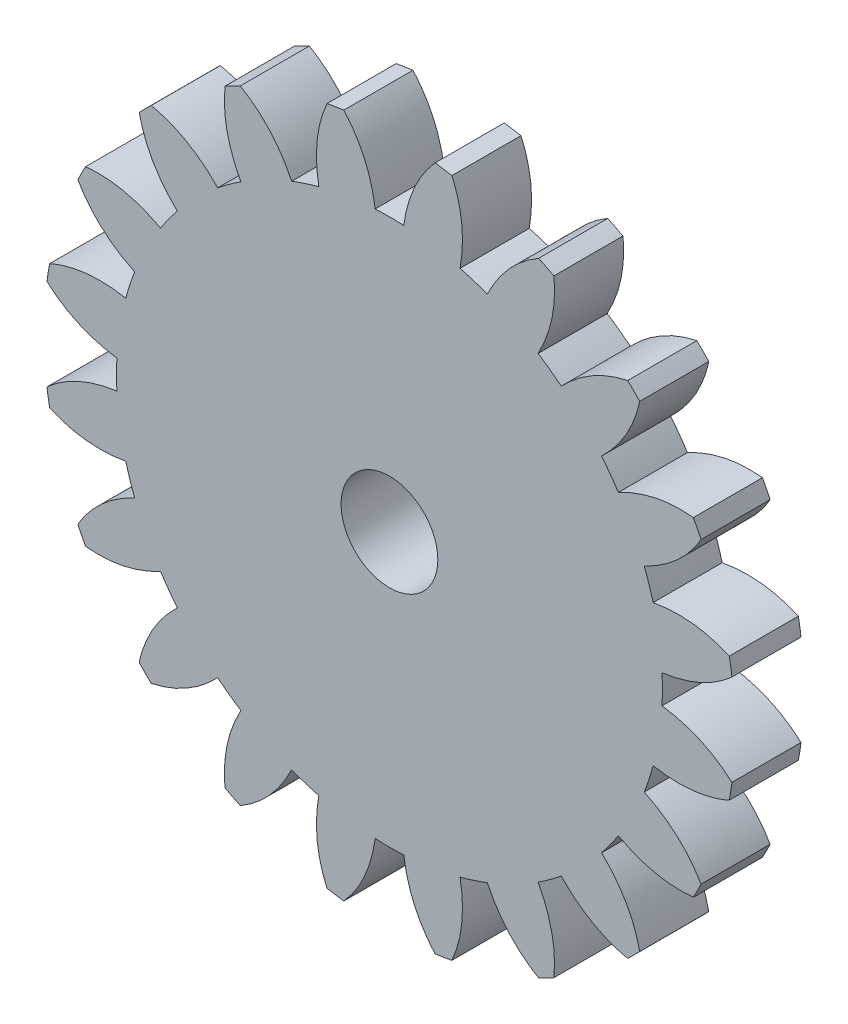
ISO-10303-21;
HEADER;
FILE_DESCRIPTION(('STEP AP214'),'2;1');
FILE_NAME('part.step','',(''),(''),'','','');
FILE_SCHEMA(('AUTOMOTIVE_DESIGN { 1 0 10303 214 1 1 1 1 }'));
ENDSEC;
DATA;
#1=APPLICATION_CONTEXT('core data for automotive mechanical design processes');
#2=APPLICATION_PROTOCOL_DEFINITION('international standard','automotive_design',2000,#1);
#3=PRODUCT_CONTEXT('',#1,'mechanical');
#4=PRODUCT('Part','Part','',(#3));
#5=PRODUCT_RELATED_PRODUCT_CATEGORY('part','',(#4));
#6=PRODUCT_DEFINITION_FORMATION('','',#4);
#7=PRODUCT_DEFINITION_CONTEXT('part definition',#1,'design');
#8=PRODUCT_DEFINITION('design','',#6,#7);
#9=PRODUCT_DEFINITION_SHAPE('','',#8);
#10=(LENGTH_UNIT() NAMED_UNIT(*) SI_UNIT(.MILLI.,.METRE.));
#11=(NAMED_UNIT(*) PLANE_ANGLE_UNIT() SI_UNIT($,.RADIAN.));
#12=(NAMED_UNIT(*) SI_UNIT($,.STERADIAN.) SOLID_ANGLE_UNIT());
#13=UNCERTAINTY_MEASURE_WITH_UNIT(LENGTH_MEASURE(1.E-05),#10,'distance_accuracy_value','');
#14=(GEOMETRIC_REPRESENTATION_CONTEXT(3) GLOBAL_UNCERTAINTY_ASSIGNED_CONTEXT((#13)) GLOBAL_UNIT_ASSIGNED_CONTEXT((#10,
#11,#12)) REPRESENTATION_CONTEXT('',''));
#15=CARTESIAN_POINT('',(0.,0.,0.));
#16=DIRECTION('',(0.,0.,1.));
#17=DIRECTION('',(1.,0.,0.));
#18=AXIS2_PLACEMENT_3D('',#15,#16,#17);
#19=CARTESIAN_POINT('',(4.82274820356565,47.2191729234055,5.));
#20=DIRECTION('',(0.,0.,1.));
#21=DIRECTION('',(1.,0.,0.));
#22=AXIS2_PLACEMENT_3D('',#19,#20,#21);
#23=PLANE('',#22);
#24=CARTESIAN_POINT('',(846924.445660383,-531706.599483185,5.));
#25=CARTESIAN_POINT('',(-843740.68402217,536790.658634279,5.));
#26=CARTESIAN_POINT('',(840576.213376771,-541685.841093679,5.));
#27=B_SPLINE_CURVE_WITH_KNOTS('',2,(#24,#25,#26),.UNSPECIFIED.,.F.,.F.,(3,3),(0.,1.),.UNSPECIFIED.);
#28=CARTESIAN_POINT('',(6.60459179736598,49.5618741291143,5.));
#29=VERTEX_POINT('',#28);
#30=CARTESIAN_POINT('',(2.06727027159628,39.4458666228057,5.));
#31=VERTEX_POINT('',#30);
#32=EDGE_CURVE('E1249',#29,#31,#27,.T.);
#33=ORIENTED_EDGE('',*,*,#32,.T.);
#34=CARTESIAN_POINT('',(0.,0.,5.));
#35=DIRECTION('',(0.,0.,1.));
#36=DIRECTION('',(1.,0.,0.));
#37=AXIS2_PLACEMENT_3D('',#34,#35,#36);
#38=CIRCLE('',#37,39.5);
#39=CARTESIAN_POINT('',(-2.06727027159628,39.4458666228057,5.));
#40=VERTEX_POINT('',#39);
#41=EDGE_CURVE('E313',#31,#40,#38,.T.);
#42=ORIENTED_EDGE('',*,*,#41,.T.);
#43=CARTESIAN_POINT('',(-840576.213376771,-541685.841093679,5.));
#44=CARTESIAN_POINT('',(843740.68402217,536790.658634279,5.));
#45=CARTESIAN_POINT('',(-846924.445660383,-531706.599483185,5.));
#46=B_SPLINE_CURVE_WITH_KNOTS('',2,(#43,#44,#45),.UNSPECIFIED.,.F.,.F.,(3,3),(0.,1.),.UNSPECIFIED.);
#47=CARTESIAN_POINT('',(-6.60459180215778,49.561874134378,5.));
#48=VERTEX_POINT('',#47);
#49=EDGE_CURVE('E1207',#40,#48,#46,.T.);
#50=ORIENTED_EDGE('',*,*,#49,.T.);
#51=CARTESIAN_POINT('',(0.,0.,5.));
#52=DIRECTION('',(0.,0.,1.));
#53=DIRECTION('',(1.,0.,0.));
#54=AXIS2_PLACEMENT_3D('',#51,#52,#53);
#55=CIRCLE('',#54,50.);
#56=CARTESIAN_POINT('',(-9.03412131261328,49.1770744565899,5.));
#57=VERTEX_POINT('',#56);
#58=EDGE_CURVE('E1202',#48,#57,#55,.T.);
#59=ORIENTED_EDGE('',*,*,#58,.T.);
#60=CARTESIAN_POINT('',(969779.388116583,-243968.979534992,5.));
#61=CARTESIAN_POINT('',(-968322.511542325,249788.043572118,5.));
#62=CARTESIAN_POINT('',(966825.615684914,-255421.513956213,5.));
#63=B_SPLINE_CURVE_WITH_KNOTS('',2,(#60,#61,#62),.UNSPECIFIED.,.F.,.F.,(3,3),(0.,1.),.UNSPECIFIED.);
#64=CARTESIAN_POINT('',(-10.2233522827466,38.1540701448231,5.));
#65=VERTEX_POINT('',#64);
#66=EDGE_CURVE('E1197',#57,#65,#63,.T.);
#67=ORIENTED_EDGE('',*,*,#66,.T.);
#68=CARTESIAN_POINT('',(0.,0.,5.));
#69=DIRECTION('',(0.,0.,1.));
#70=DIRECTION('',(1.,0.,0.));
#71=AXIS2_PLACEMENT_3D('',#68,#69,#70);
#72=CIRCLE('',#71,39.5);
#73=CARTESIAN_POINT('',(-14.1555340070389,36.8764268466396,5.));
#74=VERTEX_POINT('',#73);
#75=EDGE_CURVE('E1178',#65,#74,#72,.T.);
#76=ORIENTED_EDGE('',*,*,#75,.T.);
#77=CARTESIAN_POINT('',(-632045.354664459,-774926.183957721,5.));
#78=CARTESIAN_POINT('',(636567.639662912,771248.463988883,5.));
#79=CARTESIAN_POINT('',(-641166.637593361,-767397.072856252,5.));
#80=B_SPLINE_CURVE_WITH_KNOTS('',2,(#77,#78,#79),.UNSPECIFIED.,.F.,.F.,(3,3),(0.,1.),.UNSPECIFIED.);
#81=CARTESIAN_POINT('',(-21.5968014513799,45.0952122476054,5.));
#82=VERTEX_POINT('',#81);
#83=EDGE_CURVE('E1173',#74,#82,#80,.T.);
#84=ORIENTED_EDGE('',*,*,#83,.T.);
#85=CARTESIAN_POINT('',(0.,0.,5.));
#86=DIRECTION('',(0.,0.,1.));
#87=DIRECTION('',(1.,0.,0.));
#88=AXIS2_PLACEMENT_3D('',#85,#86,#87);
#89=CIRCLE('',#88,50.);
#90=CARTESIAN_POINT('',(-23.7885116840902,43.9784800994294,5.));
#91=VERTEX_POINT('',#90);
#92=EDGE_CURVE('E1168',#82,#91,#89,.T.);
#93=ORIENTED_EDGE('',*,*,#92,.T.);
#94=CARTESIAN_POINT('',(997705.567213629,67650.0239619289,5.));
#95=CARTESIAN_POINT('',(-998118.184933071,-61665.5655705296,5.));
#96=CARTESIAN_POINT('',(998435.390459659,55845.2505936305,5.));
#97=B_SPLINE_CURVE_WITH_KNOTS('',2,(#94,#95,#96),.UNSPECIFIED.,.F.,.F.,(3,3),(0.,1.),.UNSPECIFIED.);
#98=CARTESIAN_POINT('',(-21.5132418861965,33.1274874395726,5.));
#99=VERTEX_POINT('',#98);
#100=EDGE_CURVE('E1163',#91,#99,#97,.T.);
#101=ORIENTED_EDGE('',*,*,#100,.T.);
#102=CARTESIAN_POINT('',(0.,0.,5.));
#103=DIRECTION('',(0.,0.,1.));
#104=DIRECTION('',(1.,0.,0.));
#105=AXIS2_PLACEMENT_3D('',#102,#103,#104);
#106=CIRCLE('',#105,39.5);
#107=CARTESIAN_POINT('',(-24.8581554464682,30.6972654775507,5.));
#108=VERTEX_POINT('',#107);
#109=EDGE_CURVE('E1144',#99,#108,#106,.T.);
#110=ORIENTED_EDGE('',*,*,#109,.T.);
#111=CARTESIAN_POINT('',(-361645.492918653,-932311.352707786,5.));
#112=CARTESIAN_POINT('',(367082.919505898,930211.096084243,5.));
#113=CARTESIAN_POINT('',(-372646.971768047,-927969.373968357,5.));
#114=B_SPLINE_CURVE_WITH_KNOTS('',2,(#111,#112,#113),.UNSPECIFIED.,.F.,.F.,(3,3),(0.,1.),.UNSPECIFIED.);
#115=CARTESIAN_POINT('',(-34.4749657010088,36.2143167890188,5.));
#116=VERTEX_POINT('',#115);
#117=EDGE_CURVE('E1139',#108,#116,#114,.T.);
#118=ORIENTED_EDGE('',*,*,#117,.T.);
#119=CARTESIAN_POINT('',(0.,0.,5.));
#120=DIRECTION('',(0.,0.,1.));
#121=DIRECTION('',(1.,0.,0.));
#122=AXIS2_PLACEMENT_3D('',#119,#120,#121);
#123=CIRCLE('',#122,50.);
#124=CARTESIAN_POINT('',(-36.2143167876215,34.4749656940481,5.));
#125=VERTEX_POINT('',#124);
#126=EDGE_CURVE('E1134',#116,#125,#123,.T.);
#127=ORIENTED_EDGE('',*,*,#126,.T.);
#128=CARTESIAN_POINT('',(927969.373968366,372646.971768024,5.));
#129=CARTESIAN_POINT('',(-930211.096084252,-367082.919505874,5.));
#130=CARTESIAN_POINT('',(932311.352707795,361645.492918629,5.));
#131=B_SPLINE_CURVE_WITH_KNOTS('',2,(#128,#129,#130),.UNSPECIFIED.,.F.,.F.,(3,3),(0.,1.),.UNSPECIFIED.);
#132=CARTESIAN_POINT('',(-30.6972654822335,24.8581554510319,5.));
#133=VERTEX_POINT('',#132);
#134=EDGE_CURVE('E1129',#125,#133,#131,.T.);
#135=ORIENTED_EDGE('',*,*,#134,.T.);
#136=CARTESIAN_POINT('',(0.,0.,5.));
#137=DIRECTION('',(0.,0.,1.));
#138=DIRECTION('',(1.,0.,0.));
#139=AXIS2_PLACEMENT_3D('',#136,#137,#138);
#140=CIRCLE('',#139,39.5);
#141=CARTESIAN_POINT('',(-33.127487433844,21.513241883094,5.));
#142=VERTEX_POINT('',#141);
#143=EDGE_CURVE('E1110',#133,#142,#140,.T.);
#144=ORIENTED_EDGE('',*,*,#143,.T.);
#145=CARTESIAN_POINT('',(-55845.2505936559,-998435.390459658,5.));
#146=CARTESIAN_POINT('',(61665.565570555,998118.18493307,5.));
#147=CARTESIAN_POINT('',(-67650.0239619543,-997705.567213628,5.));
#148=B_SPLINE_CURVE_WITH_KNOTS('',2,(#145,#146,#147),.UNSPECIFIED.,.F.,.F.,(3,3),(0.,1.),.UNSPECIFIED.);
#149=CARTESIAN_POINT('',(-43.9784801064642,23.7885116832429,5.));
#150=VERTEX_POINT('',#149);
#151=EDGE_CURVE('E1105',#142,#150,#148,.T.);
#152=ORIENTED_EDGE('',*,*,#151,.T.);
#153=CARTESIAN_POINT('',(0.,0.,5.));
#154=DIRECTION('',(0.,0.,1.));
#155=DIRECTION('',(1.,0.,0.));
#156=AXIS2_PLACEMENT_3D('',#153,#154,#155);
#157=CIRCLE('',#156,50.);
#158=CARTESIAN_POINT('',(-45.0952122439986,21.5968014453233,5.));
#159=VERTEX_POINT('',#158);
#160=EDGE_CURVE('E1100',#150,#159,#157,.T.);
#161=ORIENTED_EDGE('',*,*,#160,.T.);
#162=CARTESIAN_POINT('',(767397.072856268,641166.637593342,5.));
#163=CARTESIAN_POINT('',(-771248.463988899,-636567.639662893,5.));
#164=CARTESIAN_POINT('',(774926.183957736,632045.35466444,5.));
#165=B_SPLINE_CURVE_WITH_KNOTS('',2,(#162,#163,#164),.UNSPECIFIED.,.F.,.F.,(3,3),(0.,1.),.UNSPECIFIED.);
#166=CARTESIAN_POINT('',(-36.876426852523,14.155534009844,5.));
#167=VERTEX_POINT('',#166);
#168=EDGE_CURVE('E1095',#159,#167,#165,.T.);
#169=ORIENTED_EDGE('',*,*,#168,.T.);
#170=CARTESIAN_POINT('',(0.,0.,5.));
#171=DIRECTION('',(0.,0.,1.));
#172=DIRECTION('',(1.,0.,0.));
#173=AXIS2_PLACEMENT_3D('',#170,#171,#172);
#174=CIRCLE('',#173,39.5);
#175=CARTESIAN_POINT('',(-38.1540701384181,10.22335228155,5.));
#176=VERTEX_POINT('',#175);
#177=EDGE_CURVE('E1076',#167,#176,#174,.T.);
#178=ORIENTED_EDGE('',*,*,#177,.T.);
#179=CARTESIAN_POINT('',(255421.513956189,-966825.615684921,5.));
#180=CARTESIAN_POINT('',(-249788.043572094,968322.511542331,5.));
#181=CARTESIAN_POINT('',(243968.979534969,-969779.388116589,5.));
#182=B_SPLINE_CURVE_WITH_KNOTS('',2,(#179,#180,#181),.UNSPECIFIED.,.F.,.F.,(3,3),(0.,1.),.UNSPECIFIED.);
#183=CARTESIAN_POINT('',(-49.1770744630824,9.03412130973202,5.));
#184=VERTEX_POINT('',#183);
#185=EDGE_CURVE('E1071',#176,#184,#182,.T.);
#186=ORIENTED_EDGE('',*,*,#185,.T.);
#187=CARTESIAN_POINT('',(0.,0.,5.));
#188=DIRECTION('',(0.,0.,1.));
#189=DIRECTION('',(1.,0.,0.));
#190=AXIS2_PLACEMENT_3D('',#187,#188,#189);
#191=CIRCLE('',#190,50.);
#192=CARTESIAN_POINT('',(-49.5618741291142,6.6045917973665,5.));
#193=VERTEX_POINT('',#192);
#194=EDGE_CURVE('E1066',#184,#193,#191,.T.);
#195=ORIENTED_EDGE('',*,*,#194,.T.);
#196=CARTESIAN_POINT('',(531706.599483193,846924.445660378,5.));
#197=CARTESIAN_POINT('',(-536790.658634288,-843740.684022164,5.));
#198=CARTESIAN_POINT('',(541685.841093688,840576.213376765,5.));
#199=B_SPLINE_CURVE_WITH_KNOTS('',2,(#196,#197,#198),.UNSPECIFIED.,.F.,.F.,(3,3),(0.,1.),.UNSPECIFIED.);
#200=CARTESIAN_POINT('',(-39.4458666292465,2.06727027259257,5.));
#201=VERTEX_POINT('',#200);
#202=EDGE_CURVE('E1061',#193,#201,#199,.T.);
#203=ORIENTED_EDGE('',*,*,#202,.T.);
#204=CARTESIAN_POINT('',(0.,0.,5.));
#205=DIRECTION('',(0.,0.,1.));
#206=DIRECTION('',(1.,0.,0.));
#207=AXIS2_PLACEMENT_3D('',#204,#205,#206);
#208=CIRCLE('',#207,39.5);
#209=CARTESIAN_POINT('',(-39.4458666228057,-2.06727027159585,5.));
#210=VERTEX_POINT('',#209);
#211=EDGE_CURVE('E1042',#201,#210,#208,.T.);
#212=ORIENTED_EDGE('',*,*,#211,.T.);
#213=CARTESIAN_POINT('',(541685.841093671,-840576.213376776,5.));
#214=CARTESIAN_POINT('',(-536790.65863427,843740.684022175,5.));
#215=CARTESIAN_POINT('',(531706.599483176,-846924.445660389,5.));
#216=B_SPLINE_CURVE_WITH_KNOTS('',2,(#213,#214,#215),.UNSPECIFIED.,.F.,.F.,(3,3),(0.,1.),.UNSPECIFIED.);
#217=CARTESIAN_POINT('',(-49.5618741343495,-6.60459180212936,5.));
#218=VERTEX_POINT('',#217);
#219=EDGE_CURVE('E1037',#210,#218,#216,.T.);
#220=ORIENTED_EDGE('',*,*,#219,.T.);
#221=CARTESIAN_POINT('',(0.,0.,5.));
#222=DIRECTION('',(0.,0.,1.));
#223=DIRECTION('',(1.,0.,0.));
#224=AXIS2_PLACEMENT_3D('',#221,#222,#223);
#225=CIRCLE('',#224,50.);
#226=CARTESIAN_POINT('',(-49.1770744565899,-9.03412131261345,5.));
#227=VERTEX_POINT('',#226);
#228=EDGE_CURVE('E1032',#218,#227,#225,.T.);
#229=ORIENTED_EDGE('',*,*,#228,.T.);
#230=CARTESIAN_POINT('',(243968.97953499,969779.388116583,5.));
#231=CARTESIAN_POINT('',(-249788.043572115,-968322.511542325,5.));
#232=CARTESIAN_POINT('',(255421.513956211,966825.615684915,5.));
#233=B_SPLINE_CURVE_WITH_KNOTS('',2,(#230,#231,#232),.UNSPECIFIED.,.F.,.F.,(3,3),(0.,1.),.UNSPECIFIED.);
#234=CARTESIAN_POINT('',(-38.1540701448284,-10.2233522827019,5.));
#235=VERTEX_POINT('',#234);
#236=EDGE_CURVE('E1027',#227,#235,#233,.T.);
#237=ORIENTED_EDGE('',*,*,#236,.T.);
#238=CARTESIAN_POINT('',(0.,0.,5.));
#239=DIRECTION('',(0.,0.,1.));
#240=DIRECTION('',(1.,0.,0.));
#241=AXIS2_PLACEMENT_3D('',#238,#239,#240);
#242=CIRCLE('',#241,39.5);
#243=CARTESIAN_POINT('',(-36.8764268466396,-14.155534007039,5.));
#244=VERTEX_POINT('',#243);
#245=EDGE_CURVE('E1008',#235,#244,#242,.T.);
#246=ORIENTED_EDGE('',*,*,#245,.T.);
#247=CARTESIAN_POINT('',(774926.183957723,-632045.354664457,5.));
#248=CARTESIAN_POINT('',(-771248.463988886,636567.639662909,5.));
#249=CARTESIAN_POINT('',(767397.072856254,-641166.637593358,5.));
#250=B_SPLINE_CURVE_WITH_KNOTS('',2,(#247,#248,#249),.UNSPECIFIED.,.F.,.F.,(3,3),(0.,1.),.UNSPECIFIED.);
#251=CARTESIAN_POINT('',(-45.0952122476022,-21.5968014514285,5.));
#252=VERTEX_POINT('',#251);
#253=EDGE_CURVE('E1003',#244,#252,#250,.T.);
#254=ORIENTED_EDGE('',*,*,#253,.T.);
#255=CARTESIAN_POINT('',(0.,0.,5.));
#256=DIRECTION('',(0.,0.,1.));
#257=DIRECTION('',(1.,0.,0.));
#258=AXIS2_PLACEMENT_3D('',#255,#256,#257);
#259=CIRCLE('',#258,50.);
#260=CARTESIAN_POINT('',(-43.9784800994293,-23.7885116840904,5.));
#261=VERTEX_POINT('',#260);
#262=EDGE_CURVE('E998',#252,#261,#259,.T.);
#263=ORIENTED_EDGE('',*,*,#262,.T.);
#264=CARTESIAN_POINT('',(-67650.0239619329,997705.567213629,5.));
#265=CARTESIAN_POINT('',(61665.5655705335,-998118.184933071,5.));
#266=CARTESIAN_POINT('',(-55845.2505936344,998435.390459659,5.));
#267=B_SPLINE_CURVE_WITH_KNOTS('',2,(#264,#265,#266),.UNSPECIFIED.,.F.,.F.,(3,3),(0.,1.),.UNSPECIFIED.);
#268=CARTESIAN_POINT('',(-33.1274874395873,-21.5132418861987,5.));
#269=VERTEX_POINT('',#268);
#270=EDGE_CURVE('E993',#261,#269,#267,.T.);
#271=ORIENTED_EDGE('',*,*,#270,.T.);
#272=CARTESIAN_POINT('',(0.,0.,5.));
#273=DIRECTION('',(0.,0.,1.));
#274=DIRECTION('',(1.,0.,0.));
#275=AXIS2_PLACEMENT_3D('',#272,#273,#274);
#276=CIRCLE('',#275,39.5);
#277=CARTESIAN_POINT('',(-30.6972654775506,-24.8581554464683,5.));
#278=VERTEX_POINT('',#277);
#279=EDGE_CURVE('E974',#269,#278,#276,.T.);
#280=ORIENTED_EDGE('',*,*,#279,.T.);
#281=CARTESIAN_POINT('',(932311.352707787,-361645.49291865,5.));
#282=CARTESIAN_POINT('',(-930211.096084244,367082.919505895,5.));
#283=CARTESIAN_POINT('',(927969.373968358,-372646.971768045,5.));
#284=B_SPLINE_CURVE_WITH_KNOTS('',2,(#281,#282,#283),.UNSPECIFIED.,.F.,.F.,(3,3),(0.,1.),.UNSPECIFIED.);
#285=CARTESIAN_POINT('',(-36.2143167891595,-34.4749657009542,5.));
#286=VERTEX_POINT('',#285);
#287=EDGE_CURVE('E969',#278,#286,#284,.T.);
#288=ORIENTED_EDGE('',*,*,#287,.T.);
#289=CARTESIAN_POINT('',(0.,0.,5.));
#290=DIRECTION('',(0.,0.,1.));
#291=DIRECTION('',(1.,0.,0.));
#292=AXIS2_PLACEMENT_3D('',#289,#290,#291);
#293=CIRCLE('',#292,50.);
#294=CARTESIAN_POINT('',(-34.474965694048,-36.2143167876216,5.));
#295=VERTEX_POINT('',#294);
#296=EDGE_CURVE('E964',#286,#295,#293,.T.);
#297=ORIENTED_EDGE('',*,*,#296,.T.);
#298=CARTESIAN_POINT('',(-372646.971768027,927969.373968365,5.));
#299=CARTESIAN_POINT('',(367082.919505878,-930211.096084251,5.));
#300=CARTESIAN_POINT('',(-361645.492918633,932311.352707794,5.));
#301=B_SPLINE_CURVE_WITH_KNOTS('',2,(#298,#299,#300),.UNSPECIFIED.,.F.,.F.,(3,3),(0.,1.),.UNSPECIFIED.);
#302=CARTESIAN_POINT('',(-24.8581554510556,-30.6972654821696,5.));
#303=VERTEX_POINT('',#302);
#304=EDGE_CURVE('E959',#295,#303,#301,.T.);
#305=ORIENTED_EDGE('',*,*,#304,.T.);
#306=CARTESIAN_POINT('',(0.,0.,5.));
#307=DIRECTION('',(0.,0.,1.));
#308=DIRECTION('',(1.,0.,0.));
#309=AXIS2_PLACEMENT_3D('',#306,#307,#308);
#310=CIRCLE('',#309,39.5);
#311=CARTESIAN_POINT('',(-21.5132418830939,-33.1274874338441,5.));
#312=VERTEX_POINT('',#311);
#313=EDGE_CURVE('E940',#303,#312,#310,.T.);
#314=ORIENTED_EDGE('',*,*,#313,.T.);
#315=CARTESIAN_POINT('',(998435.390459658,-55845.2505936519,5.));
#316=CARTESIAN_POINT('',(-998118.18493307,61665.565570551,5.));
#317=CARTESIAN_POINT('',(997705.567213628,-67650.0239619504,5.));
#318=B_SPLINE_CURVE_WITH_KNOTS('',2,(#315,#316,#317),.UNSPECIFIED.,.F.,.F.,(3,3),(0.,1.),.UNSPECIFIED.);
#319=CARTESIAN_POINT('',(-23.7885116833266,-43.9784801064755,5.));
#320=VERTEX_POINT('',#319);
#321=EDGE_CURVE('E935',#312,#320,#318,.T.);
#322=ORIENTED_EDGE('',*,*,#321,.T.);
#323=CARTESIAN_POINT('',(0.,0.,5.));
#324=DIRECTION('',(0.,0.,1.));
#325=DIRECTION('',(1.,0.,0.));
#326=AXIS2_PLACEMENT_3D('',#323,#324,#325);
#327=CIRCLE('',#326,50.);
#328=CARTESIAN_POINT('',(-21.5968014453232,-45.0952122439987,5.));
#329=VERTEX_POINT('',#328);
#330=EDGE_CURVE('E930',#320,#329,#327,.T.);
#331=ORIENTED_EDGE('',*,*,#330,.T.);
#332=CARTESIAN_POINT('',(-641166.637593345,767397.072856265,5.));
#333=CARTESIAN_POINT('',(636567.639662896,-771248.463988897,5.));
#334=CARTESIAN_POINT('',(-632045.354664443,774926.183957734,5.));
#335=B_SPLINE_CURVE_WITH_KNOTS('',2,(#332,#333,#334),.UNSPECIFIED.,.F.,.F.,(3,3),(0.,1.),.UNSPECIFIED.);
#336=CARTESIAN_POINT('',(-14.1555340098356,-36.8764268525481,5.));
#337=VERTEX_POINT('',#336);
#338=EDGE_CURVE('E925',#329,#337,#335,.T.);
#339=ORIENTED_EDGE('',*,*,#338,.T.);
#340=CARTESIAN_POINT('',(0.,0.,5.));
#341=DIRECTION('',(0.,0.,1.));
#342=DIRECTION('',(1.,0.,0.));
#343=AXIS2_PLACEMENT_3D('',#340,#341,#342);
#344=CIRCLE('',#343,39.5);
#345=CARTESIAN_POINT('',(-10.2233522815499,-38.1540701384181,5.));
#346=VERTEX_POINT('',#345);
#347=EDGE_CURVE('E906',#337,#346,#344,.T.);
#348=ORIENTED_EDGE('',*,*,#347,.T.);
#349=CARTESIAN_POINT('',(966825.615684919,255421.513956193,5.));
#350=CARTESIAN_POINT('',(-968322.51154233,-249788.043572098,5.));
#351=CARTESIAN_POINT('',(969779.388116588,243968.979534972,5.));
#352=B_SPLINE_CURVE_WITH_KNOTS('',2,(#349,#350,#351),.UNSPECIFIED.,.F.,.F.,(3,3),(0.,1.),.UNSPECIFIED.);
#353=CARTESIAN_POINT('',(-9.03412130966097,-49.1770744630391,5.));
#354=VERTEX_POINT('',#353);
#355=EDGE_CURVE('E901',#346,#354,#352,.T.);
#356=ORIENTED_EDGE('',*,*,#355,.T.);
#357=CARTESIAN_POINT('',(0.,0.,5.));
#358=DIRECTION('',(0.,0.,1.));
#359=DIRECTION('',(1.,0.,0.));
#360=AXIS2_PLACEMENT_3D('',#357,#358,#359);
#361=CIRCLE('',#360,50.);
#362=CARTESIAN_POINT('',(-6.60459179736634,-49.5618741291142,5.));
#363=VERTEX_POINT('',#362);
#364=EDGE_CURVE('E896',#354,#363,#361,.T.);
#365=ORIENTED_EDGE('',*,*,#364,.T.);
#366=CARTESIAN_POINT('',(-846924.445660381,531706.59948319,5.));
#367=CARTESIAN_POINT('',(843740.684022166,-536790.658634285,5.));
#368=CARTESIAN_POINT('',(-840576.213376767,541685.841093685,5.));
#369=B_SPLINE_CURVE_WITH_KNOTS('',2,(#366,#367,#368),.UNSPECIFIED.,.F.,.F.,(3,3),(0.,1.),.UNSPECIFIED.);
#370=CARTESIAN_POINT('',(-2.06727027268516,-39.445866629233,5.));
#371=VERTEX_POINT('',#370);
#372=EDGE_CURVE('E891',#363,#371,#369,.T.);
#373=ORIENTED_EDGE('',*,*,#372,.T.);
#374=CARTESIAN_POINT('',(0.,0.,5.));
#375=DIRECTION('',(0.,0.,1.));
#376=DIRECTION('',(1.,0.,0.));
#377=AXIS2_PLACEMENT_3D('',#374,#375,#376);
#378=CIRCLE('',#377,39.5);
#379=CARTESIAN_POINT('',(2.06727027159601,-39.4458666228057,5.));
#380=VERTEX_POINT('',#379);
#381=EDGE_CURVE('E872',#371,#380,#378,.T.);
#382=ORIENTED_EDGE('',*,*,#381,.T.);
#383=CARTESIAN_POINT('',(840576.213376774,541685.841093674,5.));
#384=CARTESIAN_POINT('',(-843740.684022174,-536790.658634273,5.));
#385=CARTESIAN_POINT('',(846924.445660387,531706.599483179,5.));
#386=B_SPLINE_CURVE_WITH_KNOTS('',2,(#383,#384,#385),.UNSPECIFIED.,.F.,.F.,(3,3),(0.,1.),.UNSPECIFIED.);
#387=CARTESIAN_POINT('',(6.60459180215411,-49.5618741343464,5.));
#388=VERTEX_POINT('',#387);
#389=EDGE_CURVE('E867',#380,#388,#386,.T.);
#390=ORIENTED_EDGE('',*,*,#389,.T.);
#391=CARTESIAN_POINT('',(0.,0.,5.));
#392=DIRECTION('',(0.,0.,1.));
#393=DIRECTION('',(1.,0.,0.));
#394=AXIS2_PLACEMENT_3D('',#391,#392,#393);
#395=CIRCLE('',#394,50.);
#396=CARTESIAN_POINT('',(9.03412131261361,-49.1770744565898,5.));
#397=VERTEX_POINT('',#396);
#398=EDGE_CURVE('E862',#388,#397,#395,.T.);
#399=ORIENTED_EDGE('',*,*,#398,.T.);
#400=CARTESIAN_POINT('',(-969779.388116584,243968.979534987,5.));
#401=CARTESIAN_POINT('',(968322.511542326,-249788.043572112,5.));
#402=CARTESIAN_POINT('',(-966825.615684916,255421.513956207,5.));
#403=B_SPLINE_CURVE_WITH_KNOTS('',2,(#400,#401,#402),.UNSPECIFIED.,.F.,.F.,(3,3),(0.,1.),.UNSPECIFIED.);
#404=CARTESIAN_POINT('',(10.223352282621,-38.1540701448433,5.));
#405=VERTEX_POINT('',#404);
#406=EDGE_CURVE('E857',#397,#405,#403,.T.);
#407=ORIENTED_EDGE('',*,*,#406,.T.);
#408=CARTESIAN_POINT('',(0.,0.,5.));
#409=DIRECTION('',(0.,0.,1.));
#410=DIRECTION('',(1.,0.,0.));
#411=AXIS2_PLACEMENT_3D('',#408,#409,#410);
#412=CIRCLE('',#411,39.5);
#413=CARTESIAN_POINT('',(14.1555340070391,-36.8764268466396,5.));
#414=VERTEX_POINT('',#413);
#415=EDGE_CURVE('E838',#405,#414,#412,.T.);
#416=ORIENTED_EDGE('',*,*,#415,.T.);
#417=CARTESIAN_POINT('',(632045.354664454,774926.183957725,5.));
#418=CARTESIAN_POINT('',(-636567.639662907,-771248.463988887,5.));
#419=CARTESIAN_POINT('',(641166.637593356,767397.072856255,5.));
#420=B_SPLINE_CURVE_WITH_KNOTS('',2,(#417,#418,#419),.UNSPECIFIED.,.F.,.F.,(3,3),(0.,1.),.UNSPECIFIED.);
#421=CARTESIAN_POINT('',(21.5968014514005,-45.0952122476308,5.));
#422=VERTEX_POINT('',#421);
#423=EDGE_CURVE('E833',#414,#422,#420,.T.);
#424=ORIENTED_EDGE('',*,*,#423,.T.);
#425=CARTESIAN_POINT('',(0.,0.,5.));
#426=DIRECTION('',(0.,0.,1.));
#427=DIRECTION('',(1.,0.,0.));
#428=AXIS2_PLACEMENT_3D('',#425,#426,#427);
#429=CIRCLE('',#428,50.);
#430=CARTESIAN_POINT('',(23.7885116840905,-43.9784800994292,5.));
#431=VERTEX_POINT('',#430);
#432=EDGE_CURVE('E828',#422,#431,#429,.T.);
#433=ORIENTED_EDGE('',*,*,#432,.T.);
#434=CARTESIAN_POINT('',(-997705.567213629,-67650.0239619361,5.));
#435=CARTESIAN_POINT('',(998118.184933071,61665.5655705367,5.));
#436=CARTESIAN_POINT('',(-998435.390459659,-55845.2505936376,5.));
#437=B_SPLINE_CURVE_WITH_KNOTS('',2,(#434,#435,#436),.UNSPECIFIED.,.F.,.F.,(3,3),(0.,1.),.UNSPECIFIED.);
#438=CARTESIAN_POINT('',(21.5132418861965,-33.1274874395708,5.));
#439=VERTEX_POINT('',#438);
#440=EDGE_CURVE('E823',#431,#439,#437,.T.);
#441=ORIENTED_EDGE('',*,*,#440,.T.);
#442=CARTESIAN_POINT('',(0.,0.,5.));
#443=DIRECTION('',(0.,0.,1.));
#444=DIRECTION('',(1.,0.,0.));
#445=AXIS2_PLACEMENT_3D('',#442,#443,#444);
#446=CIRCLE('',#445,39.5);
#447=CARTESIAN_POINT('',(24.8581554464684,-30.6972654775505,5.));
#448=VERTEX_POINT('',#447);
#449=EDGE_CURVE('E804',#439,#448,#446,.T.);
#450=ORIENTED_EDGE('',*,*,#449,.T.);
#451=CARTESIAN_POINT('',(361645.492918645,932311.352707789,5.));
#452=CARTESIAN_POINT('',(-367082.91950589,-930211.096084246,5.));
#453=CARTESIAN_POINT('',(372646.97176804,927969.373968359,5.));
#454=B_SPLINE_CURVE_WITH_KNOTS('',2,(#451,#452,#453),.UNSPECIFIED.,.F.,.F.,(3,3),(0.,1.),.UNSPECIFIED.);
#455=CARTESIAN_POINT('',(34.4749657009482,-36.2143167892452,5.));
#456=VERTEX_POINT('',#455);
#457=EDGE_CURVE('E799',#448,#456,#454,.T.);
#458=ORIENTED_EDGE('',*,*,#457,.T.);
#459=CARTESIAN_POINT('',(0.,0.,5.));
#460=DIRECTION('',(0.,0.,1.));
#461=DIRECTION('',(1.,0.,0.));
#462=AXIS2_PLACEMENT_3D('',#459,#460,#461);
#463=CIRCLE('',#462,50.);
#464=CARTESIAN_POINT('',(36.2143167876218,-34.4749656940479,5.));
#465=VERTEX_POINT('',#464);
#466=EDGE_CURVE('E794',#456,#465,#463,.T.);
#467=ORIENTED_EDGE('',*,*,#466,.T.);
#468=CARTESIAN_POINT('',(-927969.373968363,-372646.971768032,5.));
#469=CARTESIAN_POINT('',(930211.096084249,367082.919505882,5.));
#470=CARTESIAN_POINT('',(-932311.352707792,-361645.492918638,5.));
#471=B_SPLINE_CURVE_WITH_KNOTS('',2,(#468,#469,#470),.UNSPECIFIED.,.F.,.F.,(3,3),(0.,1.),.UNSPECIFIED.);
#472=CARTESIAN_POINT('',(30.6972654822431,-24.8581554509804,5.));
#473=VERTEX_POINT('',#472);
#474=EDGE_CURVE('E789',#465,#473,#471,.T.);
#475=ORIENTED_EDGE('',*,*,#474,.T.);
#476=CARTESIAN_POINT('',(0.,0.,5.));
#477=DIRECTION('',(0.,0.,1.));
#478=DIRECTION('',(1.,0.,0.));
#479=AXIS2_PLACEMENT_3D('',#476,#477,#478);
#480=CIRCLE('',#479,39.5);
#481=CARTESIAN_POINT('',(33.1274874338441,-21.5132418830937,5.));
#482=VERTEX_POINT('',#481);
#483=EDGE_CURVE('E770',#473,#482,#480,.T.);
#484=ORIENTED_EDGE('',*,*,#483,.T.);
#485=CARTESIAN_POINT('',(55845.2505936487,998435.390459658,5.));
#486=CARTESIAN_POINT('',(-61665.5655705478,-998118.18493307,5.));
#487=CARTESIAN_POINT('',(67650.0239619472,997705.567213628,5.));
#488=B_SPLINE_CURVE_WITH_KNOTS('',2,(#485,#486,#487),.UNSPECIFIED.,.F.,.F.,(3,3),(0.,1.),.UNSPECIFIED.);
#489=CARTESIAN_POINT('',(43.9784801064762,-23.7885116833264,5.));
#490=VERTEX_POINT('',#489);
#491=EDGE_CURVE('E765',#482,#490,#488,.T.);
#492=ORIENTED_EDGE('',*,*,#491,.T.);
#493=CARTESIAN_POINT('',(0.,0.,5.));
#494=DIRECTION('',(0.,0.,1.));
#495=DIRECTION('',(1.,0.,0.));
#496=AXIS2_PLACEMENT_3D('',#493,#494,#495);
#497=CIRCLE('',#496,50.);
#498=CARTESIAN_POINT('',(45.0952122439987,-21.596801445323,5.));
#499=VERTEX_POINT('',#498);
#500=EDGE_CURVE('E760',#490,#499,#497,.T.);
#501=ORIENTED_EDGE('',*,*,#500,.T.);
#502=CARTESIAN_POINT('',(-767397.072856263,-641166.637593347,5.));
#503=CARTESIAN_POINT('',(771248.463988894,636567.639662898,5.));
#504=CARTESIAN_POINT('',(-774926.183957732,-632045.354664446,5.));
#505=B_SPLINE_CURVE_WITH_KNOTS('',2,(#502,#503,#504),.UNSPECIFIED.,.F.,.F.,(3,3),(0.,1.),.UNSPECIFIED.);
#506=CARTESIAN_POINT('',(36.8764268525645,-14.1555340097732,5.));
#507=VERTEX_POINT('',#506);
#508=EDGE_CURVE('E755',#499,#507,#505,.T.);
#509=ORIENTED_EDGE('',*,*,#508,.T.);
#510=CARTESIAN_POINT('',(0.,0.,5.));
#511=DIRECTION('',(0.,0.,1.));
#512=DIRECTION('',(1.,0.,0.));
#513=AXIS2_PLACEMENT_3D('',#510,#511,#512);
#514=CIRCLE('',#513,39.5);
#515=CARTESIAN_POINT('',(38.1540701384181,-10.2233522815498,5.));
#516=VERTEX_POINT('',#515);
#517=EDGE_CURVE('E736',#507,#516,#514,.T.);
#518=ORIENTED_EDGE('',*,*,#517,.T.);
#519=CARTESIAN_POINT('',(-255421.513956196,966825.615684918,5.));
#520=CARTESIAN_POINT('',(249788.043572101,-968322.511542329,5.));
#521=CARTESIAN_POINT('',(-243968.979534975,969779.388116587,5.));
#522=B_SPLINE_CURVE_WITH_KNOTS('',2,(#519,#520,#521),.UNSPECIFIED.,.F.,.F.,(3,3),(0.,1.),.UNSPECIFIED.);
#523=CARTESIAN_POINT('',(49.177074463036,-9.03412130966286,5.));
#524=VERTEX_POINT('',#523);
#525=EDGE_CURVE('E731',#516,#524,#522,.T.);
#526=ORIENTED_EDGE('',*,*,#525,.T.);
#527=CARTESIAN_POINT('',(0.,0.,5.));
#528=DIRECTION('',(0.,0.,1.));
#529=DIRECTION('',(1.,0.,0.));
#530=AXIS2_PLACEMENT_3D('',#527,#528,#529);
#531=CIRCLE('',#530,50.);
#532=CARTESIAN_POINT('',(49.5618741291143,-6.60459179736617,5.));
#533=VERTEX_POINT('',#532);
#534=EDGE_CURVE('E726',#524,#533,#531,.T.);
#535=ORIENTED_EDGE('',*,*,#534,.T.);
#536=CARTESIAN_POINT('',(-531706.599483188,-846924.445660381,5.));
#537=CARTESIAN_POINT('',(536790.658634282,843740.684022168,5.));
#538=CARTESIAN_POINT('',(-541685.841093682,-840576.213376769,5.));
#539=B_SPLINE_CURVE_WITH_KNOTS('',2,(#536,#537,#538),.UNSPECIFIED.,.F.,.F.,(3,3),(0.,1.),.UNSPECIFIED.);
#540=CARTESIAN_POINT('',(39.4458666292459,-2.067270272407,5.));
#541=VERTEX_POINT('',#540);
#542=EDGE_CURVE('E721',#533,#541,#539,.T.);
#543=ORIENTED_EDGE('',*,*,#542,.T.);
#544=CARTESIAN_POINT('',(0.,0.,5.));
#545=DIRECTION('',(0.,0.,1.));
#546=DIRECTION('',(1.,0.,0.));
#547=AXIS2_PLACEMENT_3D('',#544,#545,#546);
#548=CIRCLE('',#547,39.5);
#549=CARTESIAN_POINT('',(39.4458666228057,2.06727027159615,5.));
#550=VERTEX_POINT('',#549);
#551=EDGE_CURVE('E702',#541,#550,#548,.T.);
#552=ORIENTED_EDGE('',*,*,#551,.T.);
#553=CARTESIAN_POINT('',(-541685.841093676,840576.213376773,5.));
#554=CARTESIAN_POINT('',(536790.658634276,-843740.684022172,5.));
#555=CARTESIAN_POINT('',(-531706.599483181,846924.445660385,5.));
#556=B_SPLINE_CURVE_WITH_KNOTS('',2,(#553,#554,#555),.UNSPECIFIED.,.F.,.F.,(3,3),(0.,1.),.UNSPECIFIED.);
#557=CARTESIAN_POINT('',(49.5618741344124,6.60459180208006,5.));
#558=VERTEX_POINT('',#557);
#559=EDGE_CURVE('E697',#550,#558,#556,.T.);
#560=ORIENTED_EDGE('',*,*,#559,.T.);
#561=CARTESIAN_POINT('',(0.,0.,5.));
#562=DIRECTION('',(0.,0.,1.));
#563=DIRECTION('',(1.,0.,0.));
#564=AXIS2_PLACEMENT_3D('',#561,#562,#563);
#565=CIRCLE('',#564,50.);
#566=CARTESIAN_POINT('',(49.1770744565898,9.03412131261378,5.));
#567=VERTEX_POINT('',#566);
#568=EDGE_CURVE('E692',#558,#567,#565,.T.);
#569=ORIENTED_EDGE('',*,*,#568,.T.);
#570=CARTESIAN_POINT('',(-243968.979534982,-969779.388116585,5.));
#571=CARTESIAN_POINT('',(249788.043572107,968322.511542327,5.));
#572=CARTESIAN_POINT('',(-255421.513956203,-966825.615684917,5.));
#573=B_SPLINE_CURVE_WITH_KNOTS('',2,(#570,#571,#572),.UNSPECIFIED.,.F.,.F.,(3,3),(0.,1.),.UNSPECIFIED.);
#574=CARTESIAN_POINT('',(38.1540701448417,10.223352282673,5.));
#575=VERTEX_POINT('',#574);
#576=EDGE_CURVE('E687',#567,#575,#573,.T.);
#577=ORIENTED_EDGE('',*,*,#576,.T.);
#578=CARTESIAN_POINT('',(0.,0.,5.));
#579=DIRECTION('',(0.,0.,1.));
#580=DIRECTION('',(1.,0.,0.));
#581=AXIS2_PLACEMENT_3D('',#578,#579,#580);
#582=CIRCLE('',#581,39.5);
#583=CARTESIAN_POINT('',(36.8764268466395,14.1555340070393,5.));
#584=VERTEX_POINT('',#583);
#585=EDGE_CURVE('E668',#575,#584,#582,.T.);
#586=ORIENTED_EDGE('',*,*,#585,.T.);
#587=CARTESIAN_POINT('',(-774926.183957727,632045.354664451,5.));
#588=CARTESIAN_POINT('',(771248.46398889,-636567.639662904,5.));
#589=CARTESIAN_POINT('',(-767397.072856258,641166.637593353,5.));
#590=B_SPLINE_CURVE_WITH_KNOTS('',2,(#587,#588,#589),.UNSPECIFIED.,.F.,.F.,(3,3),(0.,1.),.UNSPECIFIED.);
#591=CARTESIAN_POINT('',(45.0952122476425,21.5968014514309,5.));
#592=VERTEX_POINT('',#591);
#593=EDGE_CURVE('E663',#584,#592,#590,.T.);
#594=ORIENTED_EDGE('',*,*,#593,.T.);
#595=CARTESIAN_POINT('',(0.,0.,5.));
#596=DIRECTION('',(0.,0.,1.));
#597=DIRECTION('',(1.,0.,0.));
#598=AXIS2_PLACEMENT_3D('',#595,#596,#597);
#599=CIRCLE('',#598,50.);
#600=CARTESIAN_POINT('',(43.9784800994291,23.7885116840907,5.));
#601=VERTEX_POINT('',#600);
#602=EDGE_CURVE('E658',#592,#601,#599,.T.);
#603=ORIENTED_EDGE('',*,*,#602,.T.);
#604=CARTESIAN_POINT('',(67650.0239619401,-997705.567213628,5.));
#605=CARTESIAN_POINT('',(-61665.5655705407,998118.184933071,5.));
#606=CARTESIAN_POINT('',(55845.2505936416,-998435.390459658,5.));
#607=B_SPLINE_CURVE_WITH_KNOTS('',2,(#604,#605,#606),.UNSPECIFIED.,.F.,.F.,(3,3),(0.,1.),.UNSPECIFIED.);
#608=CARTESIAN_POINT('',(33.1274874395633,21.5132418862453,5.));
#609=VERTEX_POINT('',#608);
#610=EDGE_CURVE('E653',#601,#609,#607,.T.);
#611=ORIENTED_EDGE('',*,*,#610,.T.);
#612=CARTESIAN_POINT('',(0.,0.,5.));
#613=DIRECTION('',(0.,0.,1.));
#614=DIRECTION('',(1.,0.,0.));
#615=AXIS2_PLACEMENT_3D('',#612,#613,#614);
#616=CIRCLE('',#615,39.5);
#617=CARTESIAN_POINT('',(30.6972654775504,24.8581554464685,5.));
#618=VERTEX_POINT('',#617);
#619=EDGE_CURVE('E634',#609,#618,#616,.T.);
#620=ORIENTED_EDGE('',*,*,#619,.T.);
#621=CARTESIAN_POINT('',(-932311.35270779,361645.492918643,5.));
#622=CARTESIAN_POINT('',(930211.096084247,-367082.919505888,5.));
#623=CARTESIAN_POINT('',(-927969.37396836,372646.971768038,5.));
#624=B_SPLINE_CURVE_WITH_KNOTS('',2,(#621,#622,#623),.UNSPECIFIED.,.F.,.F.,(3,3),(0.,1.),.UNSPECIFIED.);
#625=CARTESIAN_POINT('',(36.2143167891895,34.4749657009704,5.));
#626=VERTEX_POINT('',#625);
#627=EDGE_CURVE('E629',#618,#626,#624,.T.);
#628=ORIENTED_EDGE('',*,*,#627,.T.);
#629=CARTESIAN_POINT('',(0.,0.,5.));
#630=DIRECTION('',(0.,0.,1.));
#631=DIRECTION('',(1.,0.,0.));
#632=AXIS2_PLACEMENT_3D('',#629,#630,#631);
#633=CIRCLE('',#632,50.);
#634=CARTESIAN_POINT('',(34.4749656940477,36.2143167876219,5.));
#635=VERTEX_POINT('',#634);
#636=EDGE_CURVE('E624',#626,#635,#633,.T.);
#637=ORIENTED_EDGE('',*,*,#636,.T.);
#638=CARTESIAN_POINT('',(372646.971768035,-927969.373968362,5.));
#639=CARTESIAN_POINT('',(-367082.919505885,930211.096084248,5.));
#640=CARTESIAN_POINT('',(361645.49291864,-932311.352707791,5.));
#641=B_SPLINE_CURVE_WITH_KNOTS('',2,(#638,#639,#640),.UNSPECIFIED.,.F.,.F.,(3,3),(0.,1.),.UNSPECIFIED.);
#642=CARTESIAN_POINT('',(24.8581554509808,30.6972654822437,5.));
#643=VERTEX_POINT('',#642);
#644=EDGE_CURVE('E619',#635,#643,#641,.T.);
#645=ORIENTED_EDGE('',*,*,#644,.T.);
#646=CARTESIAN_POINT('',(0.,0.,5.));
#647=DIRECTION('',(0.,0.,1.));
#648=DIRECTION('',(1.,0.,0.));
#649=AXIS2_PLACEMENT_3D('',#646,#647,#648);
#650=CIRCLE('',#649,39.5);
#651=CARTESIAN_POINT('',(21.5132418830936,33.1274874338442,5.));
#652=VERTEX_POINT('',#651);
#653=EDGE_CURVE('E600',#643,#652,#650,.T.);
#654=ORIENTED_EDGE('',*,*,#653,.T.);
#655=CARTESIAN_POINT('',(-998435.390459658,55845.2505936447,5.));
#656=CARTESIAN_POINT('',(998118.18493307,-61665.5655705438,5.));
#657=CARTESIAN_POINT('',(-997705.567213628,67650.0239619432,5.));
#658=B_SPLINE_CURVE_WITH_KNOTS('',2,(#655,#656,#657),.UNSPECIFIED.,.F.,.F.,(3,3),(0.,1.),.UNSPECIFIED.);
#659=CARTESIAN_POINT('',(23.7885116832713,43.9784801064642,5.));
#660=VERTEX_POINT('',#659);
#661=EDGE_CURVE('E595',#652,#660,#658,.T.);
#662=ORIENTED_EDGE('',*,*,#661,.T.);
#663=CARTESIAN_POINT('',(0.,0.,5.));
#664=DIRECTION('',(0.,0.,1.));
#665=DIRECTION('',(1.,0.,0.));
#666=AXIS2_PLACEMENT_3D('',#663,#664,#665);
#667=CIRCLE('',#666,50.);
#668=CARTESIAN_POINT('',(21.5968014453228,45.0952122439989,5.));
#669=VERTEX_POINT('',#668);
#670=EDGE_CURVE('E590',#660,#669,#667,.T.);
#671=ORIENTED_EDGE('',*,*,#670,.T.);
#672=CARTESIAN_POINT('',(641166.63759335,-767397.07285626,5.));
#673=CARTESIAN_POINT('',(-636567.639662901,771248.463988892,5.));
#674=CARTESIAN_POINT('',(632045.354664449,-774926.183957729,5.));
#675=B_SPLINE_CURVE_WITH_KNOTS('',2,(#672,#673,#674),.UNSPECIFIED.,.F.,.F.,(3,3),(0.,1.),.UNSPECIFIED.);
#676=CARTESIAN_POINT('',(14.155534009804,36.8764268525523,5.));
#677=VERTEX_POINT('',#676);
#678=EDGE_CURVE('E548',#669,#677,#675,.T.);
#679=ORIENTED_EDGE('',*,*,#678,.T.);
#680=CARTESIAN_POINT('',(0.,0.,5.));
#681=DIRECTION('',(0.,0.,1.));
#682=DIRECTION('',(1.,0.,0.));
#683=AXIS2_PLACEMENT_3D('',#680,#681,#682);
#684=CIRCLE('',#683,39.5);
#685=CARTESIAN_POINT('',(10.2233522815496,38.1540701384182,5.));
#686=VERTEX_POINT('',#685);
#687=EDGE_CURVE('E542',#677,#686,#684,.T.);
#688=ORIENTED_EDGE('',*,*,#687,.T.);
#689=CARTESIAN_POINT('',(-966825.615684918,-255421.5139562,5.));
#690=CARTESIAN_POINT('',(968322.511542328,249788.043572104,5.));
#691=CARTESIAN_POINT('',(-969779.388116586,-243968.979534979,5.));
#692=B_SPLINE_CURVE_WITH_KNOTS('',2,(#689,#690,#691),.UNSPECIFIED.,.F.,.F.,(3,3),(0.,1.),.UNSPECIFIED.);
#693=CARTESIAN_POINT('',(9.03412130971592,49.1770744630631,5.));
#694=VERTEX_POINT('',#693);
#695=EDGE_CURVE('E546',#686,#694,#692,.T.);
#696=ORIENTED_EDGE('',*,*,#695,.T.);
#697=CARTESIAN_POINT('',(0.,0.,5.));
#698=DIRECTION('',(0.,0.,1.));
#699=DIRECTION('',(1.,0.,0.));
#700=AXIS2_PLACEMENT_3D('',#697,#698,#699);
#701=CIRCLE('',#700,50.);
#702=EDGE_CURVE('E54',#694,#29,#701,.T.);
#703=ORIENTED_EDGE('',*,*,#702,.T.);
#704=EDGE_LOOP('',(#33,#42,#50,#59,#67,#76,#84,#93,#101,#110,#118,#127,#135,#144,#152,#161,#169,
#178,#186,#195,#203,#212,#220,#229,#237,#246,#254,#263,#271,#280,#288,#297,#305,#314,#322,#331,
#339,#348,#356,#365,#373,#382,#390,#399,#407,#416,#424,#433,#441,#450,#458,#467,#475,#484,#492,
#501,#509,#518,#526,#535,#543,#552,#560,#569,#577,#586,#594,#603,#611,#620,#628,#637,#645,#654,
#662,#671,#679,#688,#696,#703));
#705=FACE_BOUND('',#704,.T.);
#706=CARTESIAN_POINT('',(0.,0.,5.));
#707=DIRECTION('',(0.,0.,1.));
#708=DIRECTION('',(1.,0.,0.));
#709=AXIS2_PLACEMENT_3D('',#706,#707,#708);
#710=CIRCLE('',#709,7.);
#711=CARTESIAN_POINT('',(7.,0.,5.));
#712=VERTEX_POINT('',#711);
#713=EDGE_CURVE('E1241',#712,#712,#710,.T.);
#714=ORIENTED_EDGE('',*,*,#713,.F.);
#715=EDGE_LOOP('',(#714));
#716=FACE_BOUND('',#715,.T.);
#717=ADVANCED_FACE('F36',(#705,#716),#23,.T.);
#718=CARTESIAN_POINT('',(4.82274820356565,47.2191729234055,-5.));
#719=DIRECTION('',(0.,0.,1.));
#720=DIRECTION('',(1.,0.,0.));
#721=AXIS2_PLACEMENT_3D('',#718,#719,#720);
#722=PLANE('',#721);
#723=CARTESIAN_POINT('',(846924.445660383,-531706.599483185,-5.));
#724=CARTESIAN_POINT('',(-843740.68402217,536790.658634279,-5.));
#725=CARTESIAN_POINT('',(840576.213376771,-541685.841093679,-5.));
#726=B_SPLINE_CURVE_WITH_KNOTS('',2,(#723,#724,#725),.UNSPECIFIED.,.F.,.F.,(3,3),(0.,1.),.UNSPECIFIED.);
#727=CARTESIAN_POINT('',(6.60459179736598,49.5618741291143,-5.));
#728=VERTEX_POINT('',#727);
#729=CARTESIAN_POINT('',(2.06727027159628,39.4458666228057,-5.));
#730=VERTEX_POINT('',#729);
#731=EDGE_CURVE('E1247',#728,#730,#726,.T.);
#732=ORIENTED_EDGE('',*,*,#731,.F.);
#733=CARTESIAN_POINT('',(0.,0.,-5.));
#734=DIRECTION('',(0.,0.,1.));
#735=DIRECTION('',(1.,0.,0.));
#736=AXIS2_PLACEMENT_3D('',#733,#734,#735);
#737=CIRCLE('',#736,50.);
#738=CARTESIAN_POINT('',(9.03412130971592,49.1770744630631,-5.));
#739=VERTEX_POINT('',#738);
#740=EDGE_CURVE('E305',#739,#728,#737,.T.);
#741=ORIENTED_EDGE('',*,*,#740,.F.);
#742=CARTESIAN_POINT('',(-966825.615684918,-255421.5139562,-5.));
#743=CARTESIAN_POINT('',(968322.511542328,249788.043572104,-5.));
#744=CARTESIAN_POINT('',(-969779.388116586,-243968.979534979,-5.));
#745=B_SPLINE_CURVE_WITH_KNOTS('',2,(#742,#743,#744),.UNSPECIFIED.,.F.,.F.,(3,3),(0.,1.),.UNSPECIFIED.);
#746=CARTESIAN_POINT('',(10.2233522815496,38.1540701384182,-5.));
#747=VERTEX_POINT('',#746);
#748=EDGE_CURVE('E299',#747,#739,#745,.T.);
#749=ORIENTED_EDGE('',*,*,#748,.F.);
#750=CARTESIAN_POINT('',(0.,0.,-5.));
#751=DIRECTION('',(0.,0.,1.));
#752=DIRECTION('',(1.,0.,0.));
#753=AXIS2_PLACEMENT_3D('',#750,#751,#752);
#754=CIRCLE('',#753,39.5);
#755=CARTESIAN_POINT('',(14.155534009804,36.8764268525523,-5.));
#756=VERTEX_POINT('',#755);
#757=EDGE_CURVE('E556',#756,#747,#754,.T.);
#758=ORIENTED_EDGE('',*,*,#757,.F.);
#759=CARTESIAN_POINT('',(641166.63759335,-767397.07285626,-5.));
#760=CARTESIAN_POINT('',(-636567.639662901,771248.463988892,-5.));
#761=CARTESIAN_POINT('',(632045.354664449,-774926.183957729,-5.));
#762=B_SPLINE_CURVE_WITH_KNOTS('',2,(#759,#760,#761),.UNSPECIFIED.,.F.,.F.,(3,3),(0.,1.),.UNSPECIFIED.);
#763=CARTESIAN_POINT('',(21.5968014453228,45.0952122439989,-5.));
#764=VERTEX_POINT('',#763);
#765=EDGE_CURVE('E1831',#764,#756,#762,.T.);
#766=ORIENTED_EDGE('',*,*,#765,.F.);
#767=CARTESIAN_POINT('',(0.,0.,-5.));
#768=DIRECTION('',(0.,0.,1.));
#769=DIRECTION('',(1.,0.,0.));
#770=AXIS2_PLACEMENT_3D('',#767,#768,#769);
#771=CIRCLE('',#770,50.);
#772=CARTESIAN_POINT('',(23.7885116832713,43.9784801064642,-5.));
#773=VERTEX_POINT('',#772);
#774=EDGE_CURVE('E1826',#773,#764,#771,.T.);
#775=ORIENTED_EDGE('',*,*,#774,.F.);
#776=CARTESIAN_POINT('',(-998435.390459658,55845.2505936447,-5.));
#777=CARTESIAN_POINT('',(998118.18493307,-61665.5655705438,-5.));
#778=CARTESIAN_POINT('',(-997705.567213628,67650.0239619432,-5.));
#779=B_SPLINE_CURVE_WITH_KNOTS('',2,(#776,#777,#778),.UNSPECIFIED.,.F.,.F.,(3,3),(0.,1.),.UNSPECIFIED.);
#780=CARTESIAN_POINT('',(21.5132418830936,33.1274874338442,-5.));
#781=VERTEX_POINT('',#780);
#782=EDGE_CURVE('E1822',#781,#773,#779,.T.);
#783=ORIENTED_EDGE('',*,*,#782,.F.);
#784=CARTESIAN_POINT('',(0.,0.,-5.));
#785=DIRECTION('',(0.,0.,1.));
#786=DIRECTION('',(1.,0.,0.));
#787=AXIS2_PLACEMENT_3D('',#784,#785,#786);
#788=CIRCLE('',#787,39.5);
#789=CARTESIAN_POINT('',(24.8581554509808,30.6972654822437,-5.));
#790=VERTEX_POINT('',#789);
#791=EDGE_CURVE('E1817',#790,#781,#788,.T.);
#792=ORIENTED_EDGE('',*,*,#791,.F.);
#793=CARTESIAN_POINT('',(372646.971768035,-927969.373968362,-5.));
#794=CARTESIAN_POINT('',(-367082.919505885,930211.096084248,-5.));
#795=CARTESIAN_POINT('',(361645.49291864,-932311.352707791,-5.));
#796=B_SPLINE_CURVE_WITH_KNOTS('',2,(#793,#794,#795),.UNSPECIFIED.,.F.,.F.,(3,3),(0.,1.),.UNSPECIFIED.);
#797=CARTESIAN_POINT('',(34.4749656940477,36.2143167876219,-5.));
#798=VERTEX_POINT('',#797);
#799=EDGE_CURVE('E1813',#798,#790,#796,.T.);
#800=ORIENTED_EDGE('',*,*,#799,.F.);
#801=CARTESIAN_POINT('',(0.,0.,-5.));
#802=DIRECTION('',(0.,0.,1.));
#803=DIRECTION('',(1.,0.,0.));
#804=AXIS2_PLACEMENT_3D('',#801,#802,#803);
#805=CIRCLE('',#804,50.);
#806=CARTESIAN_POINT('',(36.2143167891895,34.4749657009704,-5.));
#807=VERTEX_POINT('',#806);
#808=EDGE_CURVE('E1808',#807,#798,#805,.T.);
#809=ORIENTED_EDGE('',*,*,#808,.F.);
#810=CARTESIAN_POINT('',(-932311.35270779,361645.492918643,-5.));
#811=CARTESIAN_POINT('',(930211.096084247,-367082.919505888,-5.));
#812=CARTESIAN_POINT('',(-927969.37396836,372646.971768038,-5.));
#813=B_SPLINE_CURVE_WITH_KNOTS('',2,(#810,#811,#812),.UNSPECIFIED.,.F.,.F.,(3,3),(0.,1.),.UNSPECIFIED.);
#814=CARTESIAN_POINT('',(30.6972654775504,24.8581554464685,-5.));
#815=VERTEX_POINT('',#814);
#816=EDGE_CURVE('E1804',#815,#807,#813,.T.);
#817=ORIENTED_EDGE('',*,*,#816,.F.);
#818=CARTESIAN_POINT('',(0.,0.,-5.));
#819=DIRECTION('',(0.,0.,1.));
#820=DIRECTION('',(1.,0.,0.));
#821=AXIS2_PLACEMENT_3D('',#818,#819,#820);
#822=CIRCLE('',#821,39.5);
#823=CARTESIAN_POINT('',(33.1274874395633,21.5132418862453,-5.));
#824=VERTEX_POINT('',#823);
#825=EDGE_CURVE('E1799',#824,#815,#822,.T.);
#826=ORIENTED_EDGE('',*,*,#825,.F.);
#827=CARTESIAN_POINT('',(67650.0239619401,-997705.567213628,-5.));
#828=CARTESIAN_POINT('',(-61665.5655705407,998118.184933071,-5.));
#829=CARTESIAN_POINT('',(55845.2505936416,-998435.390459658,-5.));
#830=B_SPLINE_CURVE_WITH_KNOTS('',2,(#827,#828,#829),.UNSPECIFIED.,.F.,.F.,(3,3),(0.,1.),.UNSPECIFIED.);
#831=CARTESIAN_POINT('',(43.9784800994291,23.7885116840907,-5.));
#832=VERTEX_POINT('',#831);
#833=EDGE_CURVE('E1795',#832,#824,#830,.T.);
#834=ORIENTED_EDGE('',*,*,#833,.F.);
#835=CARTESIAN_POINT('',(0.,0.,-5.));
#836=DIRECTION('',(0.,0.,1.));
#837=DIRECTION('',(1.,0.,0.));
#838=AXIS2_PLACEMENT_3D('',#835,#836,#837);
#839=CIRCLE('',#838,50.);
#840=CARTESIAN_POINT('',(45.0952122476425,21.5968014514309,-5.));
#841=VERTEX_POINT('',#840);
#842=EDGE_CURVE('E1790',#841,#832,#839,.T.);
#843=ORIENTED_EDGE('',*,*,#842,.F.);
#844=CARTESIAN_POINT('',(-774926.183957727,632045.354664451,-5.));
#845=CARTESIAN_POINT('',(771248.46398889,-636567.639662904,-5.));
#846=CARTESIAN_POINT('',(-767397.072856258,641166.637593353,-5.));
#847=B_SPLINE_CURVE_WITH_KNOTS('',2,(#844,#845,#846),.UNSPECIFIED.,.F.,.F.,(3,3),(0.,1.),.UNSPECIFIED.);
#848=CARTESIAN_POINT('',(36.8764268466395,14.1555340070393,-5.));
#849=VERTEX_POINT('',#848);
#850=EDGE_CURVE('E1786',#849,#841,#847,.T.);
#851=ORIENTED_EDGE('',*,*,#850,.F.);
#852=CARTESIAN_POINT('',(0.,0.,-5.));
#853=DIRECTION('',(0.,0.,1.));
#854=DIRECTION('',(1.,0.,0.));
#855=AXIS2_PLACEMENT_3D('',#852,#853,#854);
#856=CIRCLE('',#855,39.5);
#857=CARTESIAN_POINT('',(38.1540701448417,10.223352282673,-5.));
#858=VERTEX_POINT('',#857);
#859=EDGE_CURVE('E1781',#858,#849,#856,.T.);
#860=ORIENTED_EDGE('',*,*,#859,.F.);
#861=CARTESIAN_POINT('',(-243968.979534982,-969779.388116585,-5.));
#862=CARTESIAN_POINT('',(249788.043572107,968322.511542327,-5.));
#863=CARTESIAN_POINT('',(-255421.513956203,-966825.615684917,-5.));
#864=B_SPLINE_CURVE_WITH_KNOTS('',2,(#861,#862,#863),.UNSPECIFIED.,.F.,.F.,(3,3),(0.,1.),.UNSPECIFIED.);
#865=CARTESIAN_POINT('',(49.1770744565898,9.03412131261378,-5.));
#866=VERTEX_POINT('',#865);
#867=EDGE_CURVE('E1777',#866,#858,#864,.T.);
#868=ORIENTED_EDGE('',*,*,#867,.F.);
#869=CARTESIAN_POINT('',(0.,0.,-5.));
#870=DIRECTION('',(0.,0.,1.));
#871=DIRECTION('',(1.,0.,0.));
#872=AXIS2_PLACEMENT_3D('',#869,#870,#871);
#873=CIRCLE('',#872,50.);
#874=CARTESIAN_POINT('',(49.5618741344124,6.60459180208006,-5.));
#875=VERTEX_POINT('',#874);
#876=EDGE_CURVE('E1772',#875,#866,#873,.T.);
#877=ORIENTED_EDGE('',*,*,#876,.F.);
#878=CARTESIAN_POINT('',(-541685.841093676,840576.213376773,-5.));
#879=CARTESIAN_POINT('',(536790.658634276,-843740.684022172,-5.));
#880=CARTESIAN_POINT('',(-531706.599483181,846924.445660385,-5.));
#881=B_SPLINE_CURVE_WITH_KNOTS('',2,(#878,#879,#880),.UNSPECIFIED.,.F.,.F.,(3,3),(0.,1.),.UNSPECIFIED.);
#882=CARTESIAN_POINT('',(39.4458666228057,2.06727027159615,-5.));
#883=VERTEX_POINT('',#882);
#884=EDGE_CURVE('E1768',#883,#875,#881,.T.);
#885=ORIENTED_EDGE('',*,*,#884,.F.);
#886=CARTESIAN_POINT('',(0.,0.,-5.));
#887=DIRECTION('',(0.,0.,1.));
#888=DIRECTION('',(1.,0.,0.));
#889=AXIS2_PLACEMENT_3D('',#886,#887,#888);
#890=CIRCLE('',#889,39.5);
#891=CARTESIAN_POINT('',(39.4458666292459,-2.067270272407,-5.));
#892=VERTEX_POINT('',#891);
#893=EDGE_CURVE('E1763',#892,#883,#890,.T.);
#894=ORIENTED_EDGE('',*,*,#893,.F.);
#895=CARTESIAN_POINT('',(-531706.599483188,-846924.445660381,-5.));
#896=CARTESIAN_POINT('',(536790.658634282,843740.684022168,-5.));
#897=CARTESIAN_POINT('',(-541685.841093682,-840576.213376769,-5.));
#898=B_SPLINE_CURVE_WITH_KNOTS('',2,(#895,#896,#897),.UNSPECIFIED.,.F.,.F.,(3,3),(0.,1.),.UNSPECIFIED.);
#899=CARTESIAN_POINT('',(49.5618741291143,-6.60459179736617,-5.));
#900=VERTEX_POINT('',#899);
#901=EDGE_CURVE('E1759',#900,#892,#898,.T.);
#902=ORIENTED_EDGE('',*,*,#901,.F.);
#903=CARTESIAN_POINT('',(0.,0.,-5.));
#904=DIRECTION('',(0.,0.,1.));
#905=DIRECTION('',(1.,0.,0.));
#906=AXIS2_PLACEMENT_3D('',#903,#904,#905);
#907=CIRCLE('',#906,50.);
#908=CARTESIAN_POINT('',(49.177074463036,-9.03412130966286,-5.));
#909=VERTEX_POINT('',#908);
#910=EDGE_CURVE('E1754',#909,#900,#907,.T.);
#911=ORIENTED_EDGE('',*,*,#910,.F.);
#912=CARTESIAN_POINT('',(-255421.513956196,966825.615684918,-5.));
#913=CARTESIAN_POINT('',(249788.043572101,-968322.511542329,-5.));
#914=CARTESIAN_POINT('',(-243968.979534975,969779.388116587,-5.));
#915=B_SPLINE_CURVE_WITH_KNOTS('',2,(#912,#913,#914),.UNSPECIFIED.,.F.,.F.,(3,3),(0.,1.),.UNSPECIFIED.);
#916=CARTESIAN_POINT('',(38.1540701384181,-10.2233522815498,-5.));
#917=VERTEX_POINT('',#916);
#918=EDGE_CURVE('E1750',#917,#909,#915,.T.);
#919=ORIENTED_EDGE('',*,*,#918,.F.);
#920=CARTESIAN_POINT('',(0.,0.,-5.));
#921=DIRECTION('',(0.,0.,1.));
#922=DIRECTION('',(1.,0.,0.));
#923=AXIS2_PLACEMENT_3D('',#920,#921,#922);
#924=CIRCLE('',#923,39.5);
#925=CARTESIAN_POINT('',(36.8764268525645,-14.1555340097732,-5.));
#926=VERTEX_POINT('',#925);
#927=EDGE_CURVE('E1745',#926,#917,#924,.T.);
#928=ORIENTED_EDGE('',*,*,#927,.F.);
#929=CARTESIAN_POINT('',(-767397.072856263,-641166.637593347,-5.));
#930=CARTESIAN_POINT('',(771248.463988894,636567.639662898,-5.));
#931=CARTESIAN_POINT('',(-774926.183957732,-632045.354664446,-5.));
#932=B_SPLINE_CURVE_WITH_KNOTS('',2,(#929,#930,#931),.UNSPECIFIED.,.F.,.F.,(3,3),(0.,1.),.UNSPECIFIED.);
#933=CARTESIAN_POINT('',(45.0952122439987,-21.596801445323,-5.));
#934=VERTEX_POINT('',#933);
#935=EDGE_CURVE('E1741',#934,#926,#932,.T.);
#936=ORIENTED_EDGE('',*,*,#935,.F.);
#937=CARTESIAN_POINT('',(0.,0.,-5.));
#938=DIRECTION('',(0.,0.,1.));
#939=DIRECTION('',(1.,0.,0.));
#940=AXIS2_PLACEMENT_3D('',#937,#938,#939);
#941=CIRCLE('',#940,50.);
#942=CARTESIAN_POINT('',(43.9784801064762,-23.7885116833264,-5.));
#943=VERTEX_POINT('',#942);
#944=EDGE_CURVE('E1736',#943,#934,#941,.T.);
#945=ORIENTED_EDGE('',*,*,#944,.F.);
#946=CARTESIAN_POINT('',(55845.2505936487,998435.390459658,-5.));
#947=CARTESIAN_POINT('',(-61665.5655705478,-998118.18493307,-5.));
#948=CARTESIAN_POINT('',(67650.0239619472,997705.567213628,-5.));
#949=B_SPLINE_CURVE_WITH_KNOTS('',2,(#946,#947,#948),.UNSPECIFIED.,.F.,.F.,(3,3),(0.,1.),.UNSPECIFIED.);
#950=CARTESIAN_POINT('',(33.1274874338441,-21.5132418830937,-5.));
#951=VERTEX_POINT('',#950);
#952=EDGE_CURVE('E1732',#951,#943,#949,.T.);
#953=ORIENTED_EDGE('',*,*,#952,.F.);
#954=CARTESIAN_POINT('',(0.,0.,-5.));
#955=DIRECTION('',(0.,0.,1.));
#956=DIRECTION('',(1.,0.,0.));
#957=AXIS2_PLACEMENT_3D('',#954,#955,#956);
#958=CIRCLE('',#957,39.5);
#959=CARTESIAN_POINT('',(30.6972654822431,-24.8581554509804,-5.));
#960=VERTEX_POINT('',#959);
#961=EDGE_CURVE('E1727',#960,#951,#958,.T.);
#962=ORIENTED_EDGE('',*,*,#961,.F.);
#963=CARTESIAN_POINT('',(-927969.373968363,-372646.971768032,-5.));
#964=CARTESIAN_POINT('',(930211.096084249,367082.919505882,-5.));
#965=CARTESIAN_POINT('',(-932311.352707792,-361645.492918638,-5.));
#966=B_SPLINE_CURVE_WITH_KNOTS('',2,(#963,#964,#965),.UNSPECIFIED.,.F.,.F.,(3,3),(0.,1.),.UNSPECIFIED.);
#967=CARTESIAN_POINT('',(36.2143167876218,-34.4749656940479,-5.));
#968=VERTEX_POINT('',#967);
#969=EDGE_CURVE('E1723',#968,#960,#966,.T.);
#970=ORIENTED_EDGE('',*,*,#969,.F.);
#971=CARTESIAN_POINT('',(0.,0.,-5.));
#972=DIRECTION('',(0.,0.,1.));
#973=DIRECTION('',(1.,0.,0.));
#974=AXIS2_PLACEMENT_3D('',#971,#972,#973);
#975=CIRCLE('',#974,50.);
#976=CARTESIAN_POINT('',(34.4749657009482,-36.2143167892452,-5.));
#977=VERTEX_POINT('',#976);
#978=EDGE_CURVE('E1718',#977,#968,#975,.T.);
#979=ORIENTED_EDGE('',*,*,#978,.F.);
#980=CARTESIAN_POINT('',(361645.492918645,932311.352707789,-5.));
#981=CARTESIAN_POINT('',(-367082.91950589,-930211.096084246,-5.));
#982=CARTESIAN_POINT('',(372646.97176804,927969.373968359,-5.));
#983=B_SPLINE_CURVE_WITH_KNOTS('',2,(#980,#981,#982),.UNSPECIFIED.,.F.,.F.,(3,3),(0.,1.),.UNSPECIFIED.);
#984=CARTESIAN_POINT('',(24.8581554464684,-30.6972654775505,-5.));
#985=VERTEX_POINT('',#984);
#986=EDGE_CURVE('E1714',#985,#977,#983,.T.);
#987=ORIENTED_EDGE('',*,*,#986,.F.);
#988=CARTESIAN_POINT('',(0.,0.,-5.));
#989=DIRECTION('',(0.,0.,1.));
#990=DIRECTION('',(1.,0.,0.));
#991=AXIS2_PLACEMENT_3D('',#988,#989,#990);
#992=CIRCLE('',#991,39.5);
#993=CARTESIAN_POINT('',(21.5132418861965,-33.1274874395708,-5.));
#994=VERTEX_POINT('',#993);
#995=EDGE_CURVE('E1709',#994,#985,#992,.T.);
#996=ORIENTED_EDGE('',*,*,#995,.F.);
#997=CARTESIAN_POINT('',(-997705.567213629,-67650.0239619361,-5.));
#998=CARTESIAN_POINT('',(998118.184933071,61665.5655705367,-5.));
#999=CARTESIAN_POINT('',(-998435.390459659,-55845.2505936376,-5.));
#1000=B_SPLINE_CURVE_WITH_KNOTS('',2,(#997,#998,#999),.UNSPECIFIED.,.F.,.F.,(3,3),(0.,1.),.UNSPECIFIED.);
#1001=CARTESIAN_POINT('',(23.7885116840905,-43.9784800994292,-5.));
#1002=VERTEX_POINT('',#1001);
#1003=EDGE_CURVE('E1705',#1002,#994,#1000,.T.);
#1004=ORIENTED_EDGE('',*,*,#1003,.F.);
#1005=CARTESIAN_POINT('',(0.,0.,-5.));
#1006=DIRECTION('',(0.,0.,1.));
#1007=DIRECTION('',(1.,0.,0.));
#1008=AXIS2_PLACEMENT_3D('',#1005,#1006,#1007);
#1009=CIRCLE('',#1008,50.);
#1010=CARTESIAN_POINT('',(21.5968014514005,-45.0952122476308,-5.));
#1011=VERTEX_POINT('',#1010);
#1012=EDGE_CURVE('E1700',#1011,#1002,#1009,.T.);
#1013=ORIENTED_EDGE('',*,*,#1012,.F.);
#1014=CARTESIAN_POINT('',(632045.354664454,774926.183957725,-5.));
#1015=CARTESIAN_POINT('',(-636567.639662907,-771248.463988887,-5.));
#1016=CARTESIAN_POINT('',(641166.637593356,767397.072856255,-5.));
#1017=B_SPLINE_CURVE_WITH_KNOTS('',2,(#1014,#1015,#1016),.UNSPECIFIED.,.F.,.F.,(3,3),(0.,1.),.UNSPECIFIED.);
#1018=CARTESIAN_POINT('',(14.1555340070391,-36.8764268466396,-5.));
#1019=VERTEX_POINT('',#1018);
#1020=EDGE_CURVE('E1696',#1019,#1011,#1017,.T.);
#1021=ORIENTED_EDGE('',*,*,#1020,.F.);
#1022=CARTESIAN_POINT('',(0.,0.,-5.));
#1023=DIRECTION('',(0.,0.,1.));
#1024=DIRECTION('',(1.,0.,0.));
#1025=AXIS2_PLACEMENT_3D('',#1022,#1023,#1024);
#1026=CIRCLE('',#1025,39.5);
#1027=CARTESIAN_POINT('',(10.223352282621,-38.1540701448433,-5.));
#1028=VERTEX_POINT('',#1027);
#1029=EDGE_CURVE('E1691',#1028,#1019,#1026,.T.);
#1030=ORIENTED_EDGE('',*,*,#1029,.F.);
#1031=CARTESIAN_POINT('',(-969779.388116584,243968.979534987,-5.));
#1032=CARTESIAN_POINT('',(968322.511542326,-249788.043572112,-5.));
#1033=CARTESIAN_POINT('',(-966825.615684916,255421.513956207,-5.));
#1034=B_SPLINE_CURVE_WITH_KNOTS('',2,(#1031,#1032,#1033),.UNSPECIFIED.,.F.,.F.,(3,3),(0.,1.),.UNSPECIFIED.);
#1035=CARTESIAN_POINT('',(9.03412131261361,-49.1770744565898,-5.));
#1036=VERTEX_POINT('',#1035);
#1037=EDGE_CURVE('E1687',#1036,#1028,#1034,.T.);
#1038=ORIENTED_EDGE('',*,*,#1037,.F.);
#1039=CARTESIAN_POINT('',(0.,0.,-5.));
#1040=DIRECTION('',(0.,0.,1.));
#1041=DIRECTION('',(1.,0.,0.));
#1042=AXIS2_PLACEMENT_3D('',#1039,#1040,#1041);
#1043=CIRCLE('',#1042,50.);
#1044=CARTESIAN_POINT('',(6.60459180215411,-49.5618741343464,-5.));
#1045=VERTEX_POINT('',#1044);
#1046=EDGE_CURVE('E1682',#1045,#1036,#1043,.T.);
#1047=ORIENTED_EDGE('',*,*,#1046,.F.);
#1048=CARTESIAN_POINT('',(840576.213376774,541685.841093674,-5.));
#1049=CARTESIAN_POINT('',(-843740.684022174,-536790.658634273,-5.));
#1050=CARTESIAN_POINT('',(846924.445660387,531706.599483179,-5.));
#1051=B_SPLINE_CURVE_WITH_KNOTS('',2,(#1048,#1049,#1050),.UNSPECIFIED.,.F.,.F.,(3,3),(0.,1.),.UNSPECIFIED.);
#1052=CARTESIAN_POINT('',(2.06727027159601,-39.4458666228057,-5.));
#1053=VERTEX_POINT('',#1052);
#1054=EDGE_CURVE('E1678',#1053,#1045,#1051,.T.);
#1055=ORIENTED_EDGE('',*,*,#1054,.F.);
#1056=CARTESIAN_POINT('',(0.,0.,-5.));
#1057=DIRECTION('',(0.,0.,1.));
#1058=DIRECTION('',(1.,0.,0.));
#1059=AXIS2_PLACEMENT_3D('',#1056,#1057,#1058);
#1060=CIRCLE('',#1059,39.5);
#1061=CARTESIAN_POINT('',(-2.06727027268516,-39.445866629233,-5.));
#1062=VERTEX_POINT('',#1061);
#1063=EDGE_CURVE('E1673',#1062,#1053,#1060,.T.);
#1064=ORIENTED_EDGE('',*,*,#1063,.F.);
#1065=CARTESIAN_POINT('',(-846924.445660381,531706.59948319,-5.));
#1066=CARTESIAN_POINT('',(843740.684022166,-536790.658634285,-5.));
#1067=CARTESIAN_POINT('',(-840576.213376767,541685.841093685,-5.));
#1068=B_SPLINE_CURVE_WITH_KNOTS('',2,(#1065,#1066,#1067),.UNSPECIFIED.,.F.,.F.,(3,3),(0.,1.),.UNSPECIFIED.);
#1069=CARTESIAN_POINT('',(-6.60459179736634,-49.5618741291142,-5.));
#1070=VERTEX_POINT('',#1069);
#1071=EDGE_CURVE('E1669',#1070,#1062,#1068,.T.);
#1072=ORIENTED_EDGE('',*,*,#1071,.F.);
#1073=CARTESIAN_POINT('',(0.,0.,-5.));
#1074=DIRECTION('',(0.,0.,1.));
#1075=DIRECTION('',(1.,0.,0.));
#1076=AXIS2_PLACEMENT_3D('',#1073,#1074,#1075);
#1077=CIRCLE('',#1076,50.);
#1078=CARTESIAN_POINT('',(-9.03412130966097,-49.1770744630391,-5.));
#1079=VERTEX_POINT('',#1078);
#1080=EDGE_CURVE('E1664',#1079,#1070,#1077,.T.);
#1081=ORIENTED_EDGE('',*,*,#1080,.F.);
#1082=CARTESIAN_POINT('',(966825.615684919,255421.513956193,-5.));
#1083=CARTESIAN_POINT('',(-968322.51154233,-249788.043572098,-5.));
#1084=CARTESIAN_POINT('',(969779.388116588,243968.979534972,-5.));
#1085=B_SPLINE_CURVE_WITH_KNOTS('',2,(#1082,#1083,#1084),.UNSPECIFIED.,.F.,.F.,(3,3),(0.,1.),.UNSPECIFIED.);
#1086=CARTESIAN_POINT('',(-10.2233522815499,-38.1540701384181,-5.));
#1087=VERTEX_POINT('',#1086);
#1088=EDGE_CURVE('E1660',#1087,#1079,#1085,.T.);
#1089=ORIENTED_EDGE('',*,*,#1088,.F.);
#1090=CARTESIAN_POINT('',(0.,0.,-5.));
#1091=DIRECTION('',(0.,0.,1.));
#1092=DIRECTION('',(1.,0.,0.));
#1093=AXIS2_PLACEMENT_3D('',#1090,#1091,#1092);
#1094=CIRCLE('',#1093,39.5);
#1095=CARTESIAN_POINT('',(-14.1555340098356,-36.8764268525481,-5.));
#1096=VERTEX_POINT('',#1095);
#1097=EDGE_CURVE('E1655',#1096,#1087,#1094,.T.);
#1098=ORIENTED_EDGE('',*,*,#1097,.F.);
#1099=CARTESIAN_POINT('',(-641166.637593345,767397.072856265,-5.));
#1100=CARTESIAN_POINT('',(636567.639662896,-771248.463988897,-5.));
#1101=CARTESIAN_POINT('',(-632045.354664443,774926.183957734,-5.));
#1102=B_SPLINE_CURVE_WITH_KNOTS('',2,(#1099,#1100,#1101),.UNSPECIFIED.,.F.,.F.,(3,3),(0.,1.),.UNSPECIFIED.);
#1103=CARTESIAN_POINT('',(-21.5968014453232,-45.0952122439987,-5.));
#1104=VERTEX_POINT('',#1103);
#1105=EDGE_CURVE('E1651',#1104,#1096,#1102,.T.);
#1106=ORIENTED_EDGE('',*,*,#1105,.F.);
#1107=CARTESIAN_POINT('',(0.,0.,-5.));
#1108=DIRECTION('',(0.,0.,1.));
#1109=DIRECTION('',(1.,0.,0.));
#1110=AXIS2_PLACEMENT_3D('',#1107,#1108,#1109);
#1111=CIRCLE('',#1110,50.);
#1112=CARTESIAN_POINT('',(-23.7885116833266,-43.9784801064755,-5.));
#1113=VERTEX_POINT('',#1112);
#1114=EDGE_CURVE('E1646',#1113,#1104,#1111,.T.);
#1115=ORIENTED_EDGE('',*,*,#1114,.F.);
#1116=CARTESIAN_POINT('',(998435.390459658,-55845.2505936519,-5.));
#1117=CARTESIAN_POINT('',(-998118.18493307,61665.565570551,-5.));
#1118=CARTESIAN_POINT('',(997705.567213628,-67650.0239619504,-5.));
#1119=B_SPLINE_CURVE_WITH_KNOTS('',2,(#1116,#1117,#1118),.UNSPECIFIED.,.F.,.F.,(3,3),(0.,1.),.UNSPECIFIED.);
#1120=CARTESIAN_POINT('',(-21.5132418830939,-33.1274874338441,-5.));
#1121=VERTEX_POINT('',#1120);
#1122=EDGE_CURVE('E1642',#1121,#1113,#1119,.T.);
#1123=ORIENTED_EDGE('',*,*,#1122,.F.);
#1124=CARTESIAN_POINT('',(0.,0.,-5.));
#1125=DIRECTION('',(0.,0.,1.));
#1126=DIRECTION('',(1.,0.,0.));
#1127=AXIS2_PLACEMENT_3D('',#1124,#1125,#1126);
#1128=CIRCLE('',#1127,39.5);
#1129=CARTESIAN_POINT('',(-24.8581554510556,-30.6972654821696,-5.));
#1130=VERTEX_POINT('',#1129);
#1131=EDGE_CURVE('E1637',#1130,#1121,#1128,.T.);
#1132=ORIENTED_EDGE('',*,*,#1131,.F.);
#1133=CARTESIAN_POINT('',(-372646.971768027,927969.373968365,-5.));
#1134=CARTESIAN_POINT('',(367082.919505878,-930211.096084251,-5.));
#1135=CARTESIAN_POINT('',(-361645.492918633,932311.352707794,-5.));
#1136=B_SPLINE_CURVE_WITH_KNOTS('',2,(#1133,#1134,#1135),.UNSPECIFIED.,.F.,.F.,(3,3),(0.,1.),.UNSPECIFIED.);
#1137=CARTESIAN_POINT('',(-34.474965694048,-36.2143167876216,-5.));
#1138=VERTEX_POINT('',#1137);
#1139=EDGE_CURVE('E1633',#1138,#1130,#1136,.T.);
#1140=ORIENTED_EDGE('',*,*,#1139,.F.);
#1141=CARTESIAN_POINT('',(0.,0.,-5.));
#1142=DIRECTION('',(0.,0.,1.));
#1143=DIRECTION('',(1.,0.,0.));
#1144=AXIS2_PLACEMENT_3D('',#1141,#1142,#1143);
#1145=CIRCLE('',#1144,50.);
#1146=CARTESIAN_POINT('',(-36.2143167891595,-34.4749657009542,-5.));
#1147=VERTEX_POINT('',#1146);
#1148=EDGE_CURVE('E1628',#1147,#1138,#1145,.T.);
#1149=ORIENTED_EDGE('',*,*,#1148,.F.);
#1150=CARTESIAN_POINT('',(932311.352707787,-361645.49291865,-5.));
#1151=CARTESIAN_POINT('',(-930211.096084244,367082.919505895,-5.));
#1152=CARTESIAN_POINT('',(927969.373968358,-372646.971768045,-5.));
#1153=B_SPLINE_CURVE_WITH_KNOTS('',2,(#1150,#1151,#1152),.UNSPECIFIED.,.F.,.F.,(3,3),(0.,1.),.UNSPECIFIED.);
#1154=CARTESIAN_POINT('',(-30.6972654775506,-24.8581554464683,-5.));
#1155=VERTEX_POINT('',#1154);
#1156=EDGE_CURVE('E1624',#1155,#1147,#1153,.T.);
#1157=ORIENTED_EDGE('',*,*,#1156,.F.);
#1158=CARTESIAN_POINT('',(0.,0.,-5.));
#1159=DIRECTION('',(0.,0.,1.));
#1160=DIRECTION('',(1.,0.,0.));
#1161=AXIS2_PLACEMENT_3D('',#1158,#1159,#1160);
#1162=CIRCLE('',#1161,39.5);
#1163=CARTESIAN_POINT('',(-33.1274874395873,-21.5132418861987,-5.));
#1164=VERTEX_POINT('',#1163);
#1165=EDGE_CURVE('E1619',#1164,#1155,#1162,.T.);
#1166=ORIENTED_EDGE('',*,*,#1165,.F.);
#1167=CARTESIAN_POINT('',(-67650.0239619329,997705.567213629,-5.));
#1168=CARTESIAN_POINT('',(61665.5655705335,-998118.184933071,-5.));
#1169=CARTESIAN_POINT('',(-55845.2505936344,998435.390459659,-5.));
#1170=B_SPLINE_CURVE_WITH_KNOTS('',2,(#1167,#1168,#1169),.UNSPECIFIED.,.F.,.F.,(3,3),(0.,1.),.UNSPECIFIED.);
#1171=CARTESIAN_POINT('',(-43.9784800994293,-23.7885116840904,-5.));
#1172=VERTEX_POINT('',#1171);
#1173=EDGE_CURVE('E1615',#1172,#1164,#1170,.T.);
#1174=ORIENTED_EDGE('',*,*,#1173,.F.);
#1175=CARTESIAN_POINT('',(0.,0.,-5.));
#1176=DIRECTION('',(0.,0.,1.));
#1177=DIRECTION('',(1.,0.,0.));
#1178=AXIS2_PLACEMENT_3D('',#1175,#1176,#1177);
#1179=CIRCLE('',#1178,50.);
#1180=CARTESIAN_POINT('',(-45.0952122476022,-21.5968014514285,-5.));
#1181=VERTEX_POINT('',#1180);
#1182=EDGE_CURVE('E1610',#1181,#1172,#1179,.T.);
#1183=ORIENTED_EDGE('',*,*,#1182,.F.);
#1184=CARTESIAN_POINT('',(774926.183957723,-632045.354664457,-5.));
#1185=CARTESIAN_POINT('',(-771248.463988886,636567.639662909,-5.));
#1186=CARTESIAN_POINT('',(767397.072856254,-641166.637593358,-5.));
#1187=B_SPLINE_CURVE_WITH_KNOTS('',2,(#1184,#1185,#1186),.UNSPECIFIED.,.F.,.F.,(3,3),(0.,1.),.UNSPECIFIED.);
#1188=CARTESIAN_POINT('',(-36.8764268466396,-14.155534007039,-5.));
#1189=VERTEX_POINT('',#1188);
#1190=EDGE_CURVE('E1606',#1189,#1181,#1187,.T.);
#1191=ORIENTED_EDGE('',*,*,#1190,.F.);
#1192=CARTESIAN_POINT('',(0.,0.,-5.));
#1193=DIRECTION('',(0.,0.,1.));
#1194=DIRECTION('',(1.,0.,0.));
#1195=AXIS2_PLACEMENT_3D('',#1192,#1193,#1194);
#1196=CIRCLE('',#1195,39.5);
#1197=CARTESIAN_POINT('',(-38.1540701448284,-10.2233522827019,-5.));
#1198=VERTEX_POINT('',#1197);
#1199=EDGE_CURVE('E1601',#1198,#1189,#1196,.T.);
#1200=ORIENTED_EDGE('',*,*,#1199,.F.);
#1201=CARTESIAN_POINT('',(243968.97953499,969779.388116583,-5.));
#1202=CARTESIAN_POINT('',(-249788.043572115,-968322.511542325,-5.));
#1203=CARTESIAN_POINT('',(255421.513956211,966825.615684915,-5.));
#1204=B_SPLINE_CURVE_WITH_KNOTS('',2,(#1201,#1202,#1203),.UNSPECIFIED.,.F.,.F.,(3,3),(0.,1.),.UNSPECIFIED.);
#1205=CARTESIAN_POINT('',(-49.1770744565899,-9.03412131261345,-5.));
#1206=VERTEX_POINT('',#1205);
#1207=EDGE_CURVE('E1597',#1206,#1198,#1204,.T.);
#1208=ORIENTED_EDGE('',*,*,#1207,.F.);
#1209=CARTESIAN_POINT('',(0.,0.,-5.));
#1210=DIRECTION('',(0.,0.,1.));
#1211=DIRECTION('',(1.,0.,0.));
#1212=AXIS2_PLACEMENT_3D('',#1209,#1210,#1211);
#1213=CIRCLE('',#1212,50.);
#1214=CARTESIAN_POINT('',(-49.5618741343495,-6.60459180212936,-5.));
#1215=VERTEX_POINT('',#1214);
#1216=EDGE_CURVE('E1592',#1215,#1206,#1213,.T.);
#1217=ORIENTED_EDGE('',*,*,#1216,.F.);
#1218=CARTESIAN_POINT('',(541685.841093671,-840576.213376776,-5.));
#1219=CARTESIAN_POINT('',(-536790.65863427,843740.684022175,-5.));
#1220=CARTESIAN_POINT('',(531706.599483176,-846924.445660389,-5.));
#1221=B_SPLINE_CURVE_WITH_KNOTS('',2,(#1218,#1219,#1220),.UNSPECIFIED.,.F.,.F.,(3,3),(0.,1.),.UNSPECIFIED.);
#1222=CARTESIAN_POINT('',(-39.4458666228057,-2.06727027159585,-5.));
#1223=VERTEX_POINT('',#1222);
#1224=EDGE_CURVE('E1588',#1223,#1215,#1221,.T.);
#1225=ORIENTED_EDGE('',*,*,#1224,.F.);
#1226=CARTESIAN_POINT('',(0.,0.,-5.));
#1227=DIRECTION('',(0.,0.,1.));
#1228=DIRECTION('',(1.,0.,0.));
#1229=AXIS2_PLACEMENT_3D('',#1226,#1227,#1228);
#1230=CIRCLE('',#1229,39.5);
#1231=CARTESIAN_POINT('',(-39.4458666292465,2.06727027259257,-5.));
#1232=VERTEX_POINT('',#1231);
#1233=EDGE_CURVE('E1583',#1232,#1223,#1230,.T.);
#1234=ORIENTED_EDGE('',*,*,#1233,.F.);
#1235=CARTESIAN_POINT('',(531706.599483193,846924.445660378,-5.));
#1236=CARTESIAN_POINT('',(-536790.658634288,-843740.684022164,-5.));
#1237=CARTESIAN_POINT('',(541685.841093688,840576.213376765,-5.));
#1238=B_SPLINE_CURVE_WITH_KNOTS('',2,(#1235,#1236,#1237),.UNSPECIFIED.,.F.,.F.,(3,3),(0.,1.),.UNSPECIFIED.);
#1239=CARTESIAN_POINT('',(-49.5618741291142,6.6045917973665,-5.));
#1240=VERTEX_POINT('',#1239);
#1241=EDGE_CURVE('E1579',#1240,#1232,#1238,.T.);
#1242=ORIENTED_EDGE('',*,*,#1241,.F.);
#1243=CARTESIAN_POINT('',(0.,0.,-5.));
#1244=DIRECTION('',(0.,0.,1.));
#1245=DIRECTION('',(1.,0.,0.));
#1246=AXIS2_PLACEMENT_3D('',#1243,#1244,#1245);
#1247=CIRCLE('',#1246,50.);
#1248=CARTESIAN_POINT('',(-49.1770744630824,9.03412130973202,-5.));
#1249=VERTEX_POINT('',#1248);
#1250=EDGE_CURVE('E1574',#1249,#1240,#1247,.T.);
#1251=ORIENTED_EDGE('',*,*,#1250,.F.);
#1252=CARTESIAN_POINT('',(255421.513956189,-966825.615684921,-5.));
#1253=CARTESIAN_POINT('',(-249788.043572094,968322.511542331,-5.));
#1254=CARTESIAN_POINT('',(243968.979534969,-969779.388116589,-5.));
#1255=B_SPLINE_CURVE_WITH_KNOTS('',2,(#1252,#1253,#1254),.UNSPECIFIED.,.F.,.F.,(3,3),(0.,1.),.UNSPECIFIED.);
#1256=CARTESIAN_POINT('',(-38.1540701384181,10.22335228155,-5.));
#1257=VERTEX_POINT('',#1256);
#1258=EDGE_CURVE('E1570',#1257,#1249,#1255,.T.);
#1259=ORIENTED_EDGE('',*,*,#1258,.F.);
#1260=CARTESIAN_POINT('',(0.,0.,-5.));
#1261=DIRECTION('',(0.,0.,1.));
#1262=DIRECTION('',(1.,0.,0.));
#1263=AXIS2_PLACEMENT_3D('',#1260,#1261,#1262);
#1264=CIRCLE('',#1263,39.5);
#1265=CARTESIAN_POINT('',(-36.876426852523,14.155534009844,-5.));
#1266=VERTEX_POINT('',#1265);
#1267=EDGE_CURVE('E1565',#1266,#1257,#1264,.T.);
#1268=ORIENTED_EDGE('',*,*,#1267,.F.);
#1269=CARTESIAN_POINT('',(767397.072856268,641166.637593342,-5.));
#1270=CARTESIAN_POINT('',(-771248.463988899,-636567.639662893,-5.));
#1271=CARTESIAN_POINT('',(774926.183957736,632045.35466444,-5.));
#1272=B_SPLINE_CURVE_WITH_KNOTS('',2,(#1269,#1270,#1271),.UNSPECIFIED.,.F.,.F.,(3,3),(0.,1.),.UNSPECIFIED.);
#1273=CARTESIAN_POINT('',(-45.0952122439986,21.5968014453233,-5.));
#1274=VERTEX_POINT('',#1273);
#1275=EDGE_CURVE('E1561',#1274,#1266,#1272,.T.);
#1276=ORIENTED_EDGE('',*,*,#1275,.F.);
#1277=CARTESIAN_POINT('',(0.,0.,-5.));
#1278=DIRECTION('',(0.,0.,1.));
#1279=DIRECTION('',(1.,0.,0.));
#1280=AXIS2_PLACEMENT_3D('',#1277,#1278,#1279);
#1281=CIRCLE('',#1280,50.);
#1282=CARTESIAN_POINT('',(-43.9784801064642,23.7885116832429,-5.));
#1283=VERTEX_POINT('',#1282);
#1284=EDGE_CURVE('E1556',#1283,#1274,#1281,.T.);
#1285=ORIENTED_EDGE('',*,*,#1284,.F.);
#1286=CARTESIAN_POINT('',(-55845.2505936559,-998435.390459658,-5.));
#1287=CARTESIAN_POINT('',(61665.565570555,998118.18493307,-5.));
#1288=CARTESIAN_POINT('',(-67650.0239619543,-997705.567213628,-5.));
#1289=B_SPLINE_CURVE_WITH_KNOTS('',2,(#1286,#1287,#1288),.UNSPECIFIED.,.F.,.F.,(3,3),(0.,1.),.UNSPECIFIED.);
#1290=CARTESIAN_POINT('',(-33.127487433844,21.513241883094,-5.));
#1291=VERTEX_POINT('',#1290);
#1292=EDGE_CURVE('E1552',#1291,#1283,#1289,.T.);
#1293=ORIENTED_EDGE('',*,*,#1292,.F.);
#1294=CARTESIAN_POINT('',(0.,0.,-5.));
#1295=DIRECTION('',(0.,0.,1.));
#1296=DIRECTION('',(1.,0.,0.));
#1297=AXIS2_PLACEMENT_3D('',#1294,#1295,#1296);
#1298=CIRCLE('',#1297,39.5);
#1299=CARTESIAN_POINT('',(-30.6972654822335,24.8581554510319,-5.));
#1300=VERTEX_POINT('',#1299);
#1301=EDGE_CURVE('E1547',#1300,#1291,#1298,.T.);
#1302=ORIENTED_EDGE('',*,*,#1301,.F.);
#1303=CARTESIAN_POINT('',(927969.373968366,372646.971768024,-5.));
#1304=CARTESIAN_POINT('',(-930211.096084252,-367082.919505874,-5.));
#1305=CARTESIAN_POINT('',(932311.352707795,361645.492918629,-5.));
#1306=B_SPLINE_CURVE_WITH_KNOTS('',2,(#1303,#1304,#1305),.UNSPECIFIED.,.F.,.F.,(3,3),(0.,1.),.UNSPECIFIED.);
#1307=CARTESIAN_POINT('',(-36.2143167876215,34.4749656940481,-5.));
#1308=VERTEX_POINT('',#1307);
#1309=EDGE_CURVE('E1543',#1308,#1300,#1306,.T.);
#1310=ORIENTED_EDGE('',*,*,#1309,.F.);
#1311=CARTESIAN_POINT('',(0.,0.,-5.));
#1312=DIRECTION('',(0.,0.,1.));
#1313=DIRECTION('',(1.,0.,0.));
#1314=AXIS2_PLACEMENT_3D('',#1311,#1312,#1313);
#1315=CIRCLE('',#1314,50.);
#1316=CARTESIAN_POINT('',(-34.4749657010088,36.2143167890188,-5.));
#1317=VERTEX_POINT('',#1316);
#1318=EDGE_CURVE('E1538',#1317,#1308,#1315,.T.);
#1319=ORIENTED_EDGE('',*,*,#1318,.F.);
#1320=CARTESIAN_POINT('',(-361645.492918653,-932311.352707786,-5.));
#1321=CARTESIAN_POINT('',(367082.919505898,930211.096084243,-5.));
#1322=CARTESIAN_POINT('',(-372646.971768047,-927969.373968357,-5.));
#1323=B_SPLINE_CURVE_WITH_KNOTS('',2,(#1320,#1321,#1322),.UNSPECIFIED.,.F.,.F.,(3,3),(0.,1.),.UNSPECIFIED.);
#1324=CARTESIAN_POINT('',(-24.8581554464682,30.6972654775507,-5.));
#1325=VERTEX_POINT('',#1324);
#1326=EDGE_CURVE('E1534',#1325,#1317,#1323,.T.);
#1327=ORIENTED_EDGE('',*,*,#1326,.F.);
#1328=CARTESIAN_POINT('',(0.,0.,-5.));
#1329=DIRECTION('',(0.,0.,1.));
#1330=DIRECTION('',(1.,0.,0.));
#1331=AXIS2_PLACEMENT_3D('',#1328,#1329,#1330);
#1332=CIRCLE('',#1331,39.5);
#1333=CARTESIAN_POINT('',(-21.5132418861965,33.1274874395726,-5.));
#1334=VERTEX_POINT('',#1333);
#1335=EDGE_CURVE('E1529',#1334,#1325,#1332,.T.);
#1336=ORIENTED_EDGE('',*,*,#1335,.F.);
#1337=CARTESIAN_POINT('',(997705.567213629,67650.0239619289,-5.));
#1338=CARTESIAN_POINT('',(-998118.184933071,-61665.5655705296,-5.));
#1339=CARTESIAN_POINT('',(998435.390459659,55845.2505936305,-5.));
#1340=B_SPLINE_CURVE_WITH_KNOTS('',2,(#1337,#1338,#1339),.UNSPECIFIED.,.F.,.F.,(3,3),(0.,1.),.UNSPECIFIED.);
#1341=CARTESIAN_POINT('',(-23.7885116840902,43.9784800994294,-5.));
#1342=VERTEX_POINT('',#1341);
#1343=EDGE_CURVE('E1525',#1342,#1334,#1340,.T.);
#1344=ORIENTED_EDGE('',*,*,#1343,.F.);
#1345=CARTESIAN_POINT('',(0.,0.,-5.));
#1346=DIRECTION('',(0.,0.,1.));
#1347=DIRECTION('',(1.,0.,0.));
#1348=AXIS2_PLACEMENT_3D('',#1345,#1346,#1347);
#1349=CIRCLE('',#1348,50.);
#1350=CARTESIAN_POINT('',(-21.5968014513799,45.0952122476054,-5.));
#1351=VERTEX_POINT('',#1350);
#1352=EDGE_CURVE('E1520',#1351,#1342,#1349,.T.);
#1353=ORIENTED_EDGE('',*,*,#1352,.F.);
#1354=CARTESIAN_POINT('',(-632045.354664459,-774926.183957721,-5.));
#1355=CARTESIAN_POINT('',(636567.639662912,771248.463988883,-5.));
#1356=CARTESIAN_POINT('',(-641166.637593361,-767397.072856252,-5.));
#1357=B_SPLINE_CURVE_WITH_KNOTS('',2,(#1354,#1355,#1356),.UNSPECIFIED.,.F.,.F.,(3,3),(0.,1.),.UNSPECIFIED.);
#1358=CARTESIAN_POINT('',(-14.1555340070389,36.8764268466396,-5.));
#1359=VERTEX_POINT('',#1358);
#1360=EDGE_CURVE('E1516',#1359,#1351,#1357,.T.);
#1361=ORIENTED_EDGE('',*,*,#1360,.F.);
#1362=CARTESIAN_POINT('',(0.,0.,-5.));
#1363=DIRECTION('',(0.,0.,1.));
#1364=DIRECTION('',(1.,0.,0.));
#1365=AXIS2_PLACEMENT_3D('',#1362,#1363,#1364);
#1366=CIRCLE('',#1365,39.5);
#1367=CARTESIAN_POINT('',(-10.2233522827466,38.1540701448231,-5.));
#1368=VERTEX_POINT('',#1367);
#1369=EDGE_CURVE('E1511',#1368,#1359,#1366,.T.);
#1370=ORIENTED_EDGE('',*,*,#1369,.F.);
#1371=CARTESIAN_POINT('',(969779.388116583,-243968.979534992,-5.));
#1372=CARTESIAN_POINT('',(-968322.511542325,249788.043572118,-5.));
#1373=CARTESIAN_POINT('',(966825.615684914,-255421.513956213,-5.));
#1374=B_SPLINE_CURVE_WITH_KNOTS('',2,(#1371,#1372,#1373),.UNSPECIFIED.,.F.,.F.,(3,3),(0.,1.),.UNSPECIFIED.);
#1375=CARTESIAN_POINT('',(-9.03412131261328,49.1770744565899,-5.));
#1376=VERTEX_POINT('',#1375);
#1377=EDGE_CURVE('E1499',#1376,#1368,#1374,.T.);
#1378=ORIENTED_EDGE('',*,*,#1377,.F.);
#1379=CARTESIAN_POINT('',(0.,0.,-5.));
#1380=DIRECTION('',(0.,0.,1.));
#1381=DIRECTION('',(1.,0.,0.));
#1382=AXIS2_PLACEMENT_3D('',#1379,#1380,#1381);
#1383=CIRCLE('',#1382,50.);
#1384=CARTESIAN_POINT('',(-6.60459180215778,49.561874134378,-5.));
#1385=VERTEX_POINT('',#1384);
#1386=EDGE_CURVE('E1497',#1385,#1376,#1383,.T.);
#1387=ORIENTED_EDGE('',*,*,#1386,.F.);
#1388=CARTESIAN_POINT('',(-840576.213376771,-541685.841093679,-5.));
#1389=CARTESIAN_POINT('',(843740.68402217,536790.658634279,-5.));
#1390=CARTESIAN_POINT('',(-846924.445660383,-531706.599483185,-5.));
#1391=B_SPLINE_CURVE_WITH_KNOTS('',2,(#1388,#1389,#1390),.UNSPECIFIED.,.F.,.F.,(3,3),(0.,1.),.UNSPECIFIED.);
#1392=CARTESIAN_POINT('',(-2.06727027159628,39.4458666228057,-5.));
#1393=VERTEX_POINT('',#1392);
#1394=EDGE_CURVE('E1492',#1393,#1385,#1391,.T.);
#1395=ORIENTED_EDGE('',*,*,#1394,.F.);
#1396=CARTESIAN_POINT('',(0.,0.,-5.));
#1397=DIRECTION('',(0.,0.,1.));
#1398=DIRECTION('',(1.,0.,0.));
#1399=AXIS2_PLACEMENT_3D('',#1396,#1397,#1398);
#1400=CIRCLE('',#1399,39.5);
#1401=EDGE_CURVE('E1495',#730,#1393,#1400,.T.);
#1402=ORIENTED_EDGE('',*,*,#1401,.F.);
#1403=EDGE_LOOP('',(#732,#741,#749,#758,#766,#775,#783,#792,#800,#809,#817,#826,#834,#843,#851,
#860,#868,#877,#885,#894,#902,#911,#919,#928,#936,#945,#953,#962,#970,#979,#987,#996,#1004,
#1013,#1021,#1030,#1038,#1047,#1055,#1064,#1072,#1081,#1089,#1098,#1106,#1115,#1123,#1132,#1140,
#1149,#1157,#1166,#1174,#1183,#1191,#1200,#1208,#1217,#1225,#1234,#1242,#1251,#1259,#1268,#1276,
#1285,#1293,#1302,#1310,#1319,#1327,#1336,#1344,#1353,#1361,#1370,#1378,#1387,#1395,#1402));
#1404=FACE_BOUND('',#1403,.T.);
#1405=CARTESIAN_POINT('',(0.,0.,-5.));
#1406=DIRECTION('',(0.,0.,1.));
#1407=DIRECTION('',(1.,0.,0.));
#1408=AXIS2_PLACEMENT_3D('',#1405,#1406,#1407);
#1409=CIRCLE('',#1408,7.);
#1410=CARTESIAN_POINT('',(7.,0.,-5.));
#1411=VERTEX_POINT('',#1410);
#1412=EDGE_CURVE('E1244',#1411,#1411,#1409,.T.);
#1413=ORIENTED_EDGE('',*,*,#1412,.T.);
#1414=EDGE_LOOP('',(#1413));
#1415=FACE_BOUND('',#1414,.T.);
#1416=ADVANCED_FACE('F1223',(#1404,#1415),#722,.F.);
#1417=DIRECTION('',(0.,0.,-1.));
#1418=VECTOR('',#1417,1.);
#1419=SURFACE_OF_LINEAR_EXTRUSION('',#27,#1418);
#1420=ORIENTED_EDGE('',*,*,#731,.T.);
#1421=DIRECTION('',(0.,0.,-1.));
#1422=VECTOR('',#1421,1.);
#1423=CARTESIAN_POINT('',(2.06727027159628,39.4458666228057,5.));
#1424=LINE('',#1423,#1422);
#1425=EDGE_CURVE('E11',#31,#730,#1424,.T.);
#1426=ORIENTED_EDGE('',*,*,#1425,.F.);
#1427=ORIENTED_EDGE('',*,*,#32,.F.);
#1428=DIRECTION('',(0.,0.,-1.));
#1429=VECTOR('',#1428,1.);
#1430=CARTESIAN_POINT('',(6.60459179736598,49.5618741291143,5.));
#1431=LINE('',#1430,#1429);
#1432=EDGE_CURVE('E562',#29,#728,#1431,.T.);
#1433=ORIENTED_EDGE('',*,*,#1432,.T.);
#1434=EDGE_LOOP('',(#1420,#1426,#1427,#1433));
#1435=FACE_BOUND('',#1434,.T.);
#1436=ADVANCED_FACE('F38',(#1435),#1419,.F.);
#1437=CARTESIAN_POINT('',(0.,0.,5.));
#1438=DIRECTION('',(0.,0.,-1.));
#1439=DIRECTION('',(-1.,0.,0.));
#1440=AXIS2_PLACEMENT_3D('',#1437,#1438,#1439);
#1441=CYLINDRICAL_SURFACE('',#1440,39.5);
#1442=ORIENTED_EDGE('',*,*,#1401,.T.);
#1443=DIRECTION('',(0.,0.,-1.));
#1444=VECTOR('',#1443,1.);
#1445=CARTESIAN_POINT('',(-2.06727027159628,39.4458666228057,5.));
#1446=LINE('',#1445,#1444);
#1447=EDGE_CURVE('E46',#40,#1393,#1446,.T.);
#1448=ORIENTED_EDGE('',*,*,#1447,.F.);
#1449=ORIENTED_EDGE('',*,*,#41,.F.);
#1450=ORIENTED_EDGE('',*,*,#1425,.T.);
#1451=EDGE_LOOP('',(#1442,#1448,#1449,#1450));
#1452=FACE_BOUND('',#1451,.T.);
#1453=ADVANCED_FACE('F1217',(#1452),#1441,.T.);
#1454=DIRECTION('',(0.,0.,-1.));
#1455=VECTOR('',#1454,1.);
#1456=SURFACE_OF_LINEAR_EXTRUSION('',#46,#1455);
#1457=ORIENTED_EDGE('',*,*,#1394,.T.);
#1458=DIRECTION('',(0.,0.,-1.));
#1459=VECTOR('',#1458,1.);
#1460=CARTESIAN_POINT('',(-6.60459180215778,49.561874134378,5.));
#1461=LINE('',#1460,#1459);
#1462=EDGE_CURVE('E1486',#48,#1385,#1461,.T.);
#1463=ORIENTED_EDGE('',*,*,#1462,.F.);
#1464=ORIENTED_EDGE('',*,*,#49,.F.);
#1465=ORIENTED_EDGE('',*,*,#1447,.T.);
#1466=EDGE_LOOP('',(#1457,#1463,#1464,#1465));
#1467=FACE_BOUND('',#1466,.T.);
#1468=ADVANCED_FACE('F1215',(#1467),#1456,.F.);
#1469=CARTESIAN_POINT('',(0.,0.,5.));
#1470=DIRECTION('',(0.,0.,-1.));
#1471=DIRECTION('',(-1.,0.,0.));
#1472=AXIS2_PLACEMENT_3D('',#1469,#1470,#1471);
#1473=CYLINDRICAL_SURFACE('',#1472,50.);
#1474=ORIENTED_EDGE('',*,*,#1386,.T.);
#1475=DIRECTION('',(0.,0.,-1.));
#1476=VECTOR('',#1475,1.);
#1477=CARTESIAN_POINT('',(-9.03412131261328,49.1770744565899,5.));
#1478=LINE('',#1477,#1476);
#1479=EDGE_CURVE('E1483',#57,#1376,#1478,.T.);
#1480=ORIENTED_EDGE('',*,*,#1479,.F.);
#1481=ORIENTED_EDGE('',*,*,#58,.F.);
#1482=ORIENTED_EDGE('',*,*,#1462,.T.);
#1483=EDGE_LOOP('',(#1474,#1480,#1481,#1482));
#1484=FACE_BOUND('',#1483,.T.);
#1485=ADVANCED_FACE('F1194',(#1484),#1473,.T.);
#1486=DIRECTION('',(0.,0.,-1.));
#1487=VECTOR('',#1486,1.);
#1488=SURFACE_OF_LINEAR_EXTRUSION('',#63,#1487);
#1489=ORIENTED_EDGE('',*,*,#1377,.T.);
#1490=DIRECTION('',(0.,0.,-1.));
#1491=VECTOR('',#1490,1.);
#1492=CARTESIAN_POINT('',(-10.2233522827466,38.1540701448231,5.));
#1493=LINE('',#1492,#1491);
#1494=EDGE_CURVE('E1480',#65,#1368,#1493,.T.);
#1495=ORIENTED_EDGE('',*,*,#1494,.F.);
#1496=ORIENTED_EDGE('',*,*,#66,.F.);
#1497=ORIENTED_EDGE('',*,*,#1479,.T.);
#1498=EDGE_LOOP('',(#1489,#1495,#1496,#1497));
#1499=FACE_BOUND('',#1498,.T.);
#1500=ADVANCED_FACE('F1190',(#1499),#1488,.F.);
#1501=CARTESIAN_POINT('',(0.,0.,5.));
#1502=DIRECTION('',(0.,0.,-1.));
#1503=DIRECTION('',(-1.,0.,0.));
#1504=AXIS2_PLACEMENT_3D('',#1501,#1502,#1503);
#1505=CYLINDRICAL_SURFACE('',#1504,39.5);
#1506=ORIENTED_EDGE('',*,*,#1369,.T.);
#1507=DIRECTION('',(0.,0.,-1.));
#1508=VECTOR('',#1507,1.);
#1509=CARTESIAN_POINT('',(-14.1555340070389,36.8764268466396,5.));
#1510=LINE('',#1509,#1508);
#1511=EDGE_CURVE('E1477',#74,#1359,#1510,.T.);
#1512=ORIENTED_EDGE('',*,*,#1511,.F.);
#1513=ORIENTED_EDGE('',*,*,#75,.F.);
#1514=ORIENTED_EDGE('',*,*,#1494,.T.);
#1515=EDGE_LOOP('',(#1506,#1512,#1513,#1514));
#1516=FACE_BOUND('',#1515,.T.);
#1517=ADVANCED_FACE('F1186',(#1516),#1505,.T.);
#1518=DIRECTION('',(0.,0.,-1.));
#1519=VECTOR('',#1518,1.);
#1520=SURFACE_OF_LINEAR_EXTRUSION('',#80,#1519);
#1521=ORIENTED_EDGE('',*,*,#1360,.T.);
#1522=DIRECTION('',(0.,0.,-1.));
#1523=VECTOR('',#1522,1.);
#1524=CARTESIAN_POINT('',(-21.5968014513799,45.0952122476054,5.));
#1525=LINE('',#1524,#1523);
#1526=EDGE_CURVE('E1474',#82,#1351,#1525,.T.);
#1527=ORIENTED_EDGE('',*,*,#1526,.F.);
#1528=ORIENTED_EDGE('',*,*,#83,.F.);
#1529=ORIENTED_EDGE('',*,*,#1511,.T.);
#1530=EDGE_LOOP('',(#1521,#1527,#1528,#1529));
#1531=FACE_BOUND('',#1530,.T.);
#1532=ADVANCED_FACE('F1183',(#1531),#1520,.F.);
#1533=CARTESIAN_POINT('',(0.,0.,5.));
#1534=DIRECTION('',(0.,0.,-1.));
#1535=DIRECTION('',(-1.,0.,0.));
#1536=AXIS2_PLACEMENT_3D('',#1533,#1534,#1535);
#1537=CYLINDRICAL_SURFACE('',#1536,50.);
#1538=ORIENTED_EDGE('',*,*,#1352,.T.);
#1539=DIRECTION('',(0.,0.,-1.));
#1540=VECTOR('',#1539,1.);
#1541=CARTESIAN_POINT('',(-23.7885116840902,43.9784800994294,5.));
#1542=LINE('',#1541,#1540);
#1543=EDGE_CURVE('E1471',#91,#1342,#1542,.T.);
#1544=ORIENTED_EDGE('',*,*,#1543,.F.);
#1545=ORIENTED_EDGE('',*,*,#92,.F.);
#1546=ORIENTED_EDGE('',*,*,#1526,.T.);
#1547=EDGE_LOOP('',(#1538,#1544,#1545,#1546));
#1548=FACE_BOUND('',#1547,.T.);
#1549=ADVANCED_FACE('F1160',(#1548),#1537,.T.);
#1550=DIRECTION('',(0.,0.,-1.));
#1551=VECTOR('',#1550,1.);
#1552=SURFACE_OF_LINEAR_EXTRUSION('',#97,#1551);
#1553=ORIENTED_EDGE('',*,*,#1343,.T.);
#1554=DIRECTION('',(0.,0.,-1.));
#1555=VECTOR('',#1554,1.);
#1556=CARTESIAN_POINT('',(-21.5132418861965,33.1274874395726,5.));
#1557=LINE('',#1556,#1555);
#1558=EDGE_CURVE('E1468',#99,#1334,#1557,.T.);
#1559=ORIENTED_EDGE('',*,*,#1558,.F.);
#1560=ORIENTED_EDGE('',*,*,#100,.F.);
#1561=ORIENTED_EDGE('',*,*,#1543,.T.);
#1562=EDGE_LOOP('',(#1553,#1559,#1560,#1561));
#1563=FACE_BOUND('',#1562,.T.);
#1564=ADVANCED_FACE('F1156',(#1563),#1552,.F.);
#1565=CARTESIAN_POINT('',(0.,0.,5.));
#1566=DIRECTION('',(0.,0.,-1.));
#1567=DIRECTION('',(-1.,0.,0.));
#1568=AXIS2_PLACEMENT_3D('',#1565,#1566,#1567);
#1569=CYLINDRICAL_SURFACE('',#1568,39.5);
#1570=ORIENTED_EDGE('',*,*,#1335,.T.);
#1571=DIRECTION('',(0.,0.,-1.));
#1572=VECTOR('',#1571,1.);
#1573=CARTESIAN_POINT('',(-24.8581554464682,30.6972654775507,5.));
#1574=LINE('',#1573,#1572);
#1575=EDGE_CURVE('E1465',#108,#1325,#1574,.T.);
#1576=ORIENTED_EDGE('',*,*,#1575,.F.);
#1577=ORIENTED_EDGE('',*,*,#109,.F.);
#1578=ORIENTED_EDGE('',*,*,#1558,.T.);
#1579=EDGE_LOOP('',(#1570,#1576,#1577,#1578));
#1580=FACE_BOUND('',#1579,.T.);
#1581=ADVANCED_FACE('F1152',(#1580),#1569,.T.);
#1582=DIRECTION('',(0.,0.,-1.));
#1583=VECTOR('',#1582,1.);
#1584=SURFACE_OF_LINEAR_EXTRUSION('',#114,#1583);
#1585=ORIENTED_EDGE('',*,*,#1326,.T.);
#1586=DIRECTION('',(0.,0.,-1.));
#1587=VECTOR('',#1586,1.);
#1588=CARTESIAN_POINT('',(-34.4749657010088,36.2143167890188,5.));
#1589=LINE('',#1588,#1587);
#1590=EDGE_CURVE('E1462',#116,#1317,#1589,.T.);
#1591=ORIENTED_EDGE('',*,*,#1590,.F.);
#1592=ORIENTED_EDGE('',*,*,#117,.F.);
#1593=ORIENTED_EDGE('',*,*,#1575,.T.);
#1594=EDGE_LOOP('',(#1585,#1591,#1592,#1593));
#1595=FACE_BOUND('',#1594,.T.);
#1596=ADVANCED_FACE('F1149',(#1595),#1584,.F.);
#1597=CARTESIAN_POINT('',(0.,0.,5.));
#1598=DIRECTION('',(0.,0.,-1.));
#1599=DIRECTION('',(-1.,0.,0.));
#1600=AXIS2_PLACEMENT_3D('',#1597,#1598,#1599);
#1601=CYLINDRICAL_SURFACE('',#1600,50.);
#1602=ORIENTED_EDGE('',*,*,#1318,.T.);
#1603=DIRECTION('',(0.,0.,-1.));
#1604=VECTOR('',#1603,1.);
#1605=CARTESIAN_POINT('',(-36.2143167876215,34.4749656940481,5.));
#1606=LINE('',#1605,#1604);
#1607=EDGE_CURVE('E1459',#125,#1308,#1606,.T.);
#1608=ORIENTED_EDGE('',*,*,#1607,.F.);
#1609=ORIENTED_EDGE('',*,*,#126,.F.);
#1610=ORIENTED_EDGE('',*,*,#1590,.T.);
#1611=EDGE_LOOP('',(#1602,#1608,#1609,#1610));
#1612=FACE_BOUND('',#1611,.T.);
#1613=ADVANCED_FACE('F1126',(#1612),#1601,.T.);
#1614=DIRECTION('',(0.,0.,-1.));
#1615=VECTOR('',#1614,1.);
#1616=SURFACE_OF_LINEAR_EXTRUSION('',#131,#1615);
#1617=ORIENTED_EDGE('',*,*,#1309,.T.);
#1618=DIRECTION('',(0.,0.,-1.));
#1619=VECTOR('',#1618,1.);
#1620=CARTESIAN_POINT('',(-30.6972654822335,24.8581554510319,5.));
#1621=LINE('',#1620,#1619);
#1622=EDGE_CURVE('E1456',#133,#1300,#1621,.T.);
#1623=ORIENTED_EDGE('',*,*,#1622,.F.);
#1624=ORIENTED_EDGE('',*,*,#134,.F.);
#1625=ORIENTED_EDGE('',*,*,#1607,.T.);
#1626=EDGE_LOOP('',(#1617,#1623,#1624,#1625));
#1627=FACE_BOUND('',#1626,.T.);
#1628=ADVANCED_FACE('F1122',(#1627),#1616,.F.);
#1629=CARTESIAN_POINT('',(0.,0.,5.));
#1630=DIRECTION('',(0.,0.,-1.));
#1631=DIRECTION('',(-1.,0.,0.));
#1632=AXIS2_PLACEMENT_3D('',#1629,#1630,#1631);
#1633=CYLINDRICAL_SURFACE('',#1632,39.5);
#1634=ORIENTED_EDGE('',*,*,#1301,.T.);
#1635=DIRECTION('',(0.,0.,-1.));
#1636=VECTOR('',#1635,1.);
#1637=CARTESIAN_POINT('',(-33.127487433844,21.513241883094,5.));
#1638=LINE('',#1637,#1636);
#1639=EDGE_CURVE('E1453',#142,#1291,#1638,.T.);
#1640=ORIENTED_EDGE('',*,*,#1639,.F.);
#1641=ORIENTED_EDGE('',*,*,#143,.F.);
#1642=ORIENTED_EDGE('',*,*,#1622,.T.);
#1643=EDGE_LOOP('',(#1634,#1640,#1641,#1642));
#1644=FACE_BOUND('',#1643,.T.);
#1645=ADVANCED_FACE('F1118',(#1644),#1633,.T.);
#1646=DIRECTION('',(0.,0.,-1.));
#1647=VECTOR('',#1646,1.);
#1648=SURFACE_OF_LINEAR_EXTRUSION('',#148,#1647);
#1649=ORIENTED_EDGE('',*,*,#1292,.T.);
#1650=DIRECTION('',(0.,0.,-1.));
#1651=VECTOR('',#1650,1.);
#1652=CARTESIAN_POINT('',(-43.9784801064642,23.7885116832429,5.));
#1653=LINE('',#1652,#1651);
#1654=EDGE_CURVE('E1450',#150,#1283,#1653,.T.);
#1655=ORIENTED_EDGE('',*,*,#1654,.F.);
#1656=ORIENTED_EDGE('',*,*,#151,.F.);
#1657=ORIENTED_EDGE('',*,*,#1639,.T.);
#1658=EDGE_LOOP('',(#1649,#1655,#1656,#1657));
#1659=FACE_BOUND('',#1658,.T.);
#1660=ADVANCED_FACE('F1115',(#1659),#1648,.F.);
#1661=CARTESIAN_POINT('',(0.,0.,5.));
#1662=DIRECTION('',(0.,0.,-1.));
#1663=DIRECTION('',(-1.,0.,0.));
#1664=AXIS2_PLACEMENT_3D('',#1661,#1662,#1663);
#1665=CYLINDRICAL_SURFACE('',#1664,50.);
#1666=ORIENTED_EDGE('',*,*,#1284,.T.);
#1667=DIRECTION('',(0.,0.,-1.));
#1668=VECTOR('',#1667,1.);
#1669=CARTESIAN_POINT('',(-45.0952122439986,21.5968014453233,5.));
#1670=LINE('',#1669,#1668);
#1671=EDGE_CURVE('E1447',#159,#1274,#1670,.T.);
#1672=ORIENTED_EDGE('',*,*,#1671,.F.);
#1673=ORIENTED_EDGE('',*,*,#160,.F.);
#1674=ORIENTED_EDGE('',*,*,#1654,.T.);
#1675=EDGE_LOOP('',(#1666,#1672,#1673,#1674));
#1676=FACE_BOUND('',#1675,.T.);
#1677=ADVANCED_FACE('F1092',(#1676),#1665,.T.);
#1678=DIRECTION('',(0.,0.,-1.));
#1679=VECTOR('',#1678,1.);
#1680=SURFACE_OF_LINEAR_EXTRUSION('',#165,#1679);
#1681=ORIENTED_EDGE('',*,*,#1275,.T.);
#1682=DIRECTION('',(0.,0.,-1.));
#1683=VECTOR('',#1682,1.);
#1684=CARTESIAN_POINT('',(-36.876426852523,14.155534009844,5.));
#1685=LINE('',#1684,#1683);
#1686=EDGE_CURVE('E1444',#167,#1266,#1685,.T.);
#1687=ORIENTED_EDGE('',*,*,#1686,.F.);
#1688=ORIENTED_EDGE('',*,*,#168,.F.);
#1689=ORIENTED_EDGE('',*,*,#1671,.T.);
#1690=EDGE_LOOP('',(#1681,#1687,#1688,#1689));
#1691=FACE_BOUND('',#1690,.T.);
#1692=ADVANCED_FACE('F1088',(#1691),#1680,.F.);
#1693=CARTESIAN_POINT('',(0.,0.,5.));
#1694=DIRECTION('',(0.,0.,-1.));
#1695=DIRECTION('',(-1.,0.,0.));
#1696=AXIS2_PLACEMENT_3D('',#1693,#1694,#1695);
#1697=CYLINDRICAL_SURFACE('',#1696,39.5);
#1698=ORIENTED_EDGE('',*,*,#1267,.T.);
#1699=DIRECTION('',(0.,0.,-1.));
#1700=VECTOR('',#1699,1.);
#1701=CARTESIAN_POINT('',(-38.1540701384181,10.22335228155,5.));
#1702=LINE('',#1701,#1700);
#1703=EDGE_CURVE('E1441',#176,#1257,#1702,.T.);
#1704=ORIENTED_EDGE('',*,*,#1703,.F.);
#1705=ORIENTED_EDGE('',*,*,#177,.F.);
#1706=ORIENTED_EDGE('',*,*,#1686,.T.);
#1707=EDGE_LOOP('',(#1698,#1704,#1705,#1706));
#1708=FACE_BOUND('',#1707,.T.);
#1709=ADVANCED_FACE('F1084',(#1708),#1697,.T.);
#1710=DIRECTION('',(0.,0.,-1.));
#1711=VECTOR('',#1710,1.);
#1712=SURFACE_OF_LINEAR_EXTRUSION('',#182,#1711);
#1713=ORIENTED_EDGE('',*,*,#1258,.T.);
#1714=DIRECTION('',(0.,0.,-1.));
#1715=VECTOR('',#1714,1.);
#1716=CARTESIAN_POINT('',(-49.1770744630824,9.03412130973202,5.));
#1717=LINE('',#1716,#1715);
#1718=EDGE_CURVE('E1438',#184,#1249,#1717,.T.);
#1719=ORIENTED_EDGE('',*,*,#1718,.F.);
#1720=ORIENTED_EDGE('',*,*,#185,.F.);
#1721=ORIENTED_EDGE('',*,*,#1703,.T.);
#1722=EDGE_LOOP('',(#1713,#1719,#1720,#1721));
#1723=FACE_BOUND('',#1722,.T.);
#1724=ADVANCED_FACE('F1081',(#1723),#1712,.F.);
#1725=CARTESIAN_POINT('',(0.,0.,5.));
#1726=DIRECTION('',(0.,0.,-1.));
#1727=DIRECTION('',(-1.,0.,0.));
#1728=AXIS2_PLACEMENT_3D('',#1725,#1726,#1727);
#1729=CYLINDRICAL_SURFACE('',#1728,50.);
#1730=ORIENTED_EDGE('',*,*,#1250,.T.);
#1731=DIRECTION('',(0.,0.,-1.));
#1732=VECTOR('',#1731,1.);
#1733=CARTESIAN_POINT('',(-49.5618741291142,6.6045917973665,5.));
#1734=LINE('',#1733,#1732);
#1735=EDGE_CURVE('E1435',#193,#1240,#1734,.T.);
#1736=ORIENTED_EDGE('',*,*,#1735,.F.);
#1737=ORIENTED_EDGE('',*,*,#194,.F.);
#1738=ORIENTED_EDGE('',*,*,#1718,.T.);
#1739=EDGE_LOOP('',(#1730,#1736,#1737,#1738));
#1740=FACE_BOUND('',#1739,.T.);
#1741=ADVANCED_FACE('F1058',(#1740),#1729,.T.);
#1742=DIRECTION('',(0.,0.,-1.));
#1743=VECTOR('',#1742,1.);
#1744=SURFACE_OF_LINEAR_EXTRUSION('',#199,#1743);
#1745=ORIENTED_EDGE('',*,*,#1241,.T.);
#1746=DIRECTION('',(0.,0.,-1.));
#1747=VECTOR('',#1746,1.);
#1748=CARTESIAN_POINT('',(-39.4458666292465,2.06727027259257,5.));
#1749=LINE('',#1748,#1747);
#1750=EDGE_CURVE('E1432',#201,#1232,#1749,.T.);
#1751=ORIENTED_EDGE('',*,*,#1750,.F.);
#1752=ORIENTED_EDGE('',*,*,#202,.F.);
#1753=ORIENTED_EDGE('',*,*,#1735,.T.);
#1754=EDGE_LOOP('',(#1745,#1751,#1752,#1753));
#1755=FACE_BOUND('',#1754,.T.);
#1756=ADVANCED_FACE('F1054',(#1755),#1744,.F.);
#1757=CARTESIAN_POINT('',(0.,0.,5.));
#1758=DIRECTION('',(0.,0.,-1.));
#1759=DIRECTION('',(-1.,0.,0.));
#1760=AXIS2_PLACEMENT_3D('',#1757,#1758,#1759);
#1761=CYLINDRICAL_SURFACE('',#1760,39.5);
#1762=ORIENTED_EDGE('',*,*,#1233,.T.);
#1763=DIRECTION('',(0.,0.,-1.));
#1764=VECTOR('',#1763,1.);
#1765=CARTESIAN_POINT('',(-39.4458666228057,-2.06727027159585,5.));
#1766=LINE('',#1765,#1764);
#1767=EDGE_CURVE('E1429',#210,#1223,#1766,.T.);
#1768=ORIENTED_EDGE('',*,*,#1767,.F.);
#1769=ORIENTED_EDGE('',*,*,#211,.F.);
#1770=ORIENTED_EDGE('',*,*,#1750,.T.);
#1771=EDGE_LOOP('',(#1762,#1768,#1769,#1770));
#1772=FACE_BOUND('',#1771,.T.);
#1773=ADVANCED_FACE('F1050',(#1772),#1761,.T.);
#1774=DIRECTION('',(0.,0.,-1.));
#1775=VECTOR('',#1774,1.);
#1776=SURFACE_OF_LINEAR_EXTRUSION('',#216,#1775);
#1777=ORIENTED_EDGE('',*,*,#1224,.T.);
#1778=DIRECTION('',(0.,0.,-1.));
#1779=VECTOR('',#1778,1.);
#1780=CARTESIAN_POINT('',(-49.5618741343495,-6.60459180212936,5.));
#1781=LINE('',#1780,#1779);
#1782=EDGE_CURVE('E1426',#218,#1215,#1781,.T.);
#1783=ORIENTED_EDGE('',*,*,#1782,.F.);
#1784=ORIENTED_EDGE('',*,*,#219,.F.);
#1785=ORIENTED_EDGE('',*,*,#1767,.T.);
#1786=EDGE_LOOP('',(#1777,#1783,#1784,#1785));
#1787=FACE_BOUND('',#1786,.T.);
#1788=ADVANCED_FACE('F1047',(#1787),#1776,.F.);
#1789=CARTESIAN_POINT('',(0.,0.,5.));
#1790=DIRECTION('',(0.,0.,-1.));
#1791=DIRECTION('',(-1.,0.,0.));
#1792=AXIS2_PLACEMENT_3D('',#1789,#1790,#1791);
#1793=CYLINDRICAL_SURFACE('',#1792,50.);
#1794=ORIENTED_EDGE('',*,*,#1216,.T.);
#1795=DIRECTION('',(0.,0.,-1.));
#1796=VECTOR('',#1795,1.);
#1797=CARTESIAN_POINT('',(-49.1770744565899,-9.03412131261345,5.));
#1798=LINE('',#1797,#1796);
#1799=EDGE_CURVE('E1423',#227,#1206,#1798,.T.);
#1800=ORIENTED_EDGE('',*,*,#1799,.F.);
#1801=ORIENTED_EDGE('',*,*,#228,.F.);
#1802=ORIENTED_EDGE('',*,*,#1782,.T.);
#1803=EDGE_LOOP('',(#1794,#1800,#1801,#1802));
#1804=FACE_BOUND('',#1803,.T.);
#1805=ADVANCED_FACE('F1024',(#1804),#1793,.T.);
#1806=DIRECTION('',(0.,0.,-1.));
#1807=VECTOR('',#1806,1.);
#1808=SURFACE_OF_LINEAR_EXTRUSION('',#233,#1807);
#1809=ORIENTED_EDGE('',*,*,#1207,.T.);
#1810=DIRECTION('',(0.,0.,-1.));
#1811=VECTOR('',#1810,1.);
#1812=CARTESIAN_POINT('',(-38.1540701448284,-10.2233522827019,5.));
#1813=LINE('',#1812,#1811);
#1814=EDGE_CURVE('E1420',#235,#1198,#1813,.T.);
#1815=ORIENTED_EDGE('',*,*,#1814,.F.);
#1816=ORIENTED_EDGE('',*,*,#236,.F.);
#1817=ORIENTED_EDGE('',*,*,#1799,.T.);
#1818=EDGE_LOOP('',(#1809,#1815,#1816,#1817));
#1819=FACE_BOUND('',#1818,.T.);
#1820=ADVANCED_FACE('F1020',(#1819),#1808,.F.);
#1821=CARTESIAN_POINT('',(0.,0.,5.));
#1822=DIRECTION('',(0.,0.,-1.));
#1823=DIRECTION('',(-1.,0.,0.));
#1824=AXIS2_PLACEMENT_3D('',#1821,#1822,#1823);
#1825=CYLINDRICAL_SURFACE('',#1824,39.5);
#1826=ORIENTED_EDGE('',*,*,#1199,.T.);
#1827=DIRECTION('',(0.,0.,-1.));
#1828=VECTOR('',#1827,1.);
#1829=CARTESIAN_POINT('',(-36.8764268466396,-14.155534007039,5.));
#1830=LINE('',#1829,#1828);
#1831=EDGE_CURVE('E1417',#244,#1189,#1830,.T.);
#1832=ORIENTED_EDGE('',*,*,#1831,.F.);
#1833=ORIENTED_EDGE('',*,*,#245,.F.);
#1834=ORIENTED_EDGE('',*,*,#1814,.T.);
#1835=EDGE_LOOP('',(#1826,#1832,#1833,#1834));
#1836=FACE_BOUND('',#1835,.T.);
#1837=ADVANCED_FACE('F1016',(#1836),#1825,.T.);
#1838=DIRECTION('',(0.,0.,-1.));
#1839=VECTOR('',#1838,1.);
#1840=SURFACE_OF_LINEAR_EXTRUSION('',#250,#1839);
#1841=ORIENTED_EDGE('',*,*,#1190,.T.);
#1842=DIRECTION('',(0.,0.,-1.));
#1843=VECTOR('',#1842,1.);
#1844=CARTESIAN_POINT('',(-45.0952122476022,-21.5968014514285,5.));
#1845=LINE('',#1844,#1843);
#1846=EDGE_CURVE('E1414',#252,#1181,#1845,.T.);
#1847=ORIENTED_EDGE('',*,*,#1846,.F.);
#1848=ORIENTED_EDGE('',*,*,#253,.F.);
#1849=ORIENTED_EDGE('',*,*,#1831,.T.);
#1850=EDGE_LOOP('',(#1841,#1847,#1848,#1849));
#1851=FACE_BOUND('',#1850,.T.);
#1852=ADVANCED_FACE('F1013',(#1851),#1840,.F.);
#1853=CARTESIAN_POINT('',(0.,0.,5.));
#1854=DIRECTION('',(0.,0.,-1.));
#1855=DIRECTION('',(-1.,0.,0.));
#1856=AXIS2_PLACEMENT_3D('',#1853,#1854,#1855);
#1857=CYLINDRICAL_SURFACE('',#1856,50.);
#1858=ORIENTED_EDGE('',*,*,#1182,.T.);
#1859=DIRECTION('',(0.,0.,-1.));
#1860=VECTOR('',#1859,1.);
#1861=CARTESIAN_POINT('',(-43.9784800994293,-23.7885116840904,5.));
#1862=LINE('',#1861,#1860);
#1863=EDGE_CURVE('E1411',#261,#1172,#1862,.T.);
#1864=ORIENTED_EDGE('',*,*,#1863,.F.);
#1865=ORIENTED_EDGE('',*,*,#262,.F.);
#1866=ORIENTED_EDGE('',*,*,#1846,.T.);
#1867=EDGE_LOOP('',(#1858,#1864,#1865,#1866));
#1868=FACE_BOUND('',#1867,.T.);
#1869=ADVANCED_FACE('F990',(#1868),#1857,.T.);
#1870=DIRECTION('',(0.,0.,-1.));
#1871=VECTOR('',#1870,1.);
#1872=SURFACE_OF_LINEAR_EXTRUSION('',#267,#1871);
#1873=ORIENTED_EDGE('',*,*,#1173,.T.);
#1874=DIRECTION('',(0.,0.,-1.));
#1875=VECTOR('',#1874,1.);
#1876=CARTESIAN_POINT('',(-33.1274874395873,-21.5132418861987,5.));
#1877=LINE('',#1876,#1875);
#1878=EDGE_CURVE('E1408',#269,#1164,#1877,.T.);
#1879=ORIENTED_EDGE('',*,*,#1878,.F.);
#1880=ORIENTED_EDGE('',*,*,#270,.F.);
#1881=ORIENTED_EDGE('',*,*,#1863,.T.);
#1882=EDGE_LOOP('',(#1873,#1879,#1880,#1881));
#1883=FACE_BOUND('',#1882,.T.);
#1884=ADVANCED_FACE('F986',(#1883),#1872,.F.);
#1885=CARTESIAN_POINT('',(0.,0.,5.));
#1886=DIRECTION('',(0.,0.,-1.));
#1887=DIRECTION('',(-1.,0.,0.));
#1888=AXIS2_PLACEMENT_3D('',#1885,#1886,#1887);
#1889=CYLINDRICAL_SURFACE('',#1888,39.5);
#1890=ORIENTED_EDGE('',*,*,#1165,.T.);
#1891=DIRECTION('',(0.,0.,-1.));
#1892=VECTOR('',#1891,1.);
#1893=CARTESIAN_POINT('',(-30.6972654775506,-24.8581554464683,5.));
#1894=LINE('',#1893,#1892);
#1895=EDGE_CURVE('E1405',#278,#1155,#1894,.T.);
#1896=ORIENTED_EDGE('',*,*,#1895,.F.);
#1897=ORIENTED_EDGE('',*,*,#279,.F.);
#1898=ORIENTED_EDGE('',*,*,#1878,.T.);
#1899=EDGE_LOOP('',(#1890,#1896,#1897,#1898));
#1900=FACE_BOUND('',#1899,.T.);
#1901=ADVANCED_FACE('F982',(#1900),#1889,.T.);
#1902=DIRECTION('',(0.,0.,-1.));
#1903=VECTOR('',#1902,1.);
#1904=SURFACE_OF_LINEAR_EXTRUSION('',#284,#1903);
#1905=ORIENTED_EDGE('',*,*,#1156,.T.);
#1906=DIRECTION('',(0.,0.,-1.));
#1907=VECTOR('',#1906,1.);
#1908=CARTESIAN_POINT('',(-36.2143167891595,-34.4749657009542,5.));
#1909=LINE('',#1908,#1907);
#1910=EDGE_CURVE('E1402',#286,#1147,#1909,.T.);
#1911=ORIENTED_EDGE('',*,*,#1910,.F.);
#1912=ORIENTED_EDGE('',*,*,#287,.F.);
#1913=ORIENTED_EDGE('',*,*,#1895,.T.);
#1914=EDGE_LOOP('',(#1905,#1911,#1912,#1913));
#1915=FACE_BOUND('',#1914,.T.);
#1916=ADVANCED_FACE('F979',(#1915),#1904,.F.);
#1917=CARTESIAN_POINT('',(0.,0.,5.));
#1918=DIRECTION('',(0.,0.,-1.));
#1919=DIRECTION('',(-1.,0.,0.));
#1920=AXIS2_PLACEMENT_3D('',#1917,#1918,#1919);
#1921=CYLINDRICAL_SURFACE('',#1920,50.);
#1922=ORIENTED_EDGE('',*,*,#1148,.T.);
#1923=DIRECTION('',(0.,0.,-1.));
#1924=VECTOR('',#1923,1.);
#1925=CARTESIAN_POINT('',(-34.474965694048,-36.2143167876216,5.));
#1926=LINE('',#1925,#1924);
#1927=EDGE_CURVE('E1399',#295,#1138,#1926,.T.);
#1928=ORIENTED_EDGE('',*,*,#1927,.F.);
#1929=ORIENTED_EDGE('',*,*,#296,.F.);
#1930=ORIENTED_EDGE('',*,*,#1910,.T.);
#1931=EDGE_LOOP('',(#1922,#1928,#1929,#1930));
#1932=FACE_BOUND('',#1931,.T.);
#1933=ADVANCED_FACE('F956',(#1932),#1921,.T.);
#1934=DIRECTION('',(0.,0.,-1.));
#1935=VECTOR('',#1934,1.);
#1936=SURFACE_OF_LINEAR_EXTRUSION('',#301,#1935);
#1937=ORIENTED_EDGE('',*,*,#1139,.T.);
#1938=DIRECTION('',(0.,0.,-1.));
#1939=VECTOR('',#1938,1.);
#1940=CARTESIAN_POINT('',(-24.8581554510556,-30.6972654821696,5.));
#1941=LINE('',#1940,#1939);
#1942=EDGE_CURVE('E1396',#303,#1130,#1941,.T.);
#1943=ORIENTED_EDGE('',*,*,#1942,.F.);
#1944=ORIENTED_EDGE('',*,*,#304,.F.);
#1945=ORIENTED_EDGE('',*,*,#1927,.T.);
#1946=EDGE_LOOP('',(#1937,#1943,#1944,#1945));
#1947=FACE_BOUND('',#1946,.T.);
#1948=ADVANCED_FACE('F952',(#1947),#1936,.F.);
#1949=CARTESIAN_POINT('',(0.,0.,5.));
#1950=DIRECTION('',(0.,0.,-1.));
#1951=DIRECTION('',(-1.,0.,0.));
#1952=AXIS2_PLACEMENT_3D('',#1949,#1950,#1951);
#1953=CYLINDRICAL_SURFACE('',#1952,39.5);
#1954=ORIENTED_EDGE('',*,*,#1131,.T.);
#1955=DIRECTION('',(0.,0.,-1.));
#1956=VECTOR('',#1955,1.);
#1957=CARTESIAN_POINT('',(-21.5132418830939,-33.1274874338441,5.));
#1958=LINE('',#1957,#1956);
#1959=EDGE_CURVE('E1393',#312,#1121,#1958,.T.);
#1960=ORIENTED_EDGE('',*,*,#1959,.F.);
#1961=ORIENTED_EDGE('',*,*,#313,.F.);
#1962=ORIENTED_EDGE('',*,*,#1942,.T.);
#1963=EDGE_LOOP('',(#1954,#1960,#1961,#1962));
#1964=FACE_BOUND('',#1963,.T.);
#1965=ADVANCED_FACE('F948',(#1964),#1953,.T.);
#1966=DIRECTION('',(0.,0.,-1.));
#1967=VECTOR('',#1966,1.);
#1968=SURFACE_OF_LINEAR_EXTRUSION('',#318,#1967);
#1969=ORIENTED_EDGE('',*,*,#1122,.T.);
#1970=DIRECTION('',(0.,0.,-1.));
#1971=VECTOR('',#1970,1.);
#1972=CARTESIAN_POINT('',(-23.7885116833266,-43.9784801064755,5.));
#1973=LINE('',#1972,#1971);
#1974=EDGE_CURVE('E1390',#320,#1113,#1973,.T.);
#1975=ORIENTED_EDGE('',*,*,#1974,.F.);
#1976=ORIENTED_EDGE('',*,*,#321,.F.);
#1977=ORIENTED_EDGE('',*,*,#1959,.T.);
#1978=EDGE_LOOP('',(#1969,#1975,#1976,#1977));
#1979=FACE_BOUND('',#1978,.T.);
#1980=ADVANCED_FACE('F945',(#1979),#1968,.F.);
#1981=CARTESIAN_POINT('',(0.,0.,5.));
#1982=DIRECTION('',(0.,0.,-1.));
#1983=DIRECTION('',(-1.,0.,0.));
#1984=AXIS2_PLACEMENT_3D('',#1981,#1982,#1983);
#1985=CYLINDRICAL_SURFACE('',#1984,50.);
#1986=ORIENTED_EDGE('',*,*,#1114,.T.);
#1987=DIRECTION('',(0.,0.,-1.));
#1988=VECTOR('',#1987,1.);
#1989=CARTESIAN_POINT('',(-21.5968014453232,-45.0952122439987,5.));
#1990=LINE('',#1989,#1988);
#1991=EDGE_CURVE('E1387',#329,#1104,#1990,.T.);
#1992=ORIENTED_EDGE('',*,*,#1991,.F.);
#1993=ORIENTED_EDGE('',*,*,#330,.F.);
#1994=ORIENTED_EDGE('',*,*,#1974,.T.);
#1995=EDGE_LOOP('',(#1986,#1992,#1993,#1994));
#1996=FACE_BOUND('',#1995,.T.);
#1997=ADVANCED_FACE('F922',(#1996),#1985,.T.);
#1998=DIRECTION('',(0.,0.,-1.));
#1999=VECTOR('',#1998,1.);
#2000=SURFACE_OF_LINEAR_EXTRUSION('',#335,#1999);
#2001=ORIENTED_EDGE('',*,*,#1105,.T.);
#2002=DIRECTION('',(0.,0.,-1.));
#2003=VECTOR('',#2002,1.);
#2004=CARTESIAN_POINT('',(-14.1555340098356,-36.8764268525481,5.));
#2005=LINE('',#2004,#2003);
#2006=EDGE_CURVE('E1384',#337,#1096,#2005,.T.);
#2007=ORIENTED_EDGE('',*,*,#2006,.F.);
#2008=ORIENTED_EDGE('',*,*,#338,.F.);
#2009=ORIENTED_EDGE('',*,*,#1991,.T.);
#2010=EDGE_LOOP('',(#2001,#2007,#2008,#2009));
#2011=FACE_BOUND('',#2010,.T.);
#2012=ADVANCED_FACE('F918',(#2011),#2000,.F.);
#2013=CARTESIAN_POINT('',(0.,0.,5.));
#2014=DIRECTION('',(0.,0.,-1.));
#2015=DIRECTION('',(-1.,0.,0.));
#2016=AXIS2_PLACEMENT_3D('',#2013,#2014,#2015);
#2017=CYLINDRICAL_SURFACE('',#2016,39.5);
#2018=ORIENTED_EDGE('',*,*,#1097,.T.);
#2019=DIRECTION('',(0.,0.,-1.));
#2020=VECTOR('',#2019,1.);
#2021=CARTESIAN_POINT('',(-10.2233522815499,-38.1540701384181,5.));
#2022=LINE('',#2021,#2020);
#2023=EDGE_CURVE('E1381',#346,#1087,#2022,.T.);
#2024=ORIENTED_EDGE('',*,*,#2023,.F.);
#2025=ORIENTED_EDGE('',*,*,#347,.F.);
#2026=ORIENTED_EDGE('',*,*,#2006,.T.);
#2027=EDGE_LOOP('',(#2018,#2024,#2025,#2026));
#2028=FACE_BOUND('',#2027,.T.);
#2029=ADVANCED_FACE('F914',(#2028),#2017,.T.);
#2030=DIRECTION('',(0.,0.,-1.));
#2031=VECTOR('',#2030,1.);
#2032=SURFACE_OF_LINEAR_EXTRUSION('',#352,#2031);
#2033=ORIENTED_EDGE('',*,*,#1088,.T.);
#2034=DIRECTION('',(0.,0.,-1.));
#2035=VECTOR('',#2034,1.);
#2036=CARTESIAN_POINT('',(-9.03412130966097,-49.1770744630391,5.));
#2037=LINE('',#2036,#2035);
#2038=EDGE_CURVE('E1378',#354,#1079,#2037,.T.);
#2039=ORIENTED_EDGE('',*,*,#2038,.F.);
#2040=ORIENTED_EDGE('',*,*,#355,.F.);
#2041=ORIENTED_EDGE('',*,*,#2023,.T.);
#2042=EDGE_LOOP('',(#2033,#2039,#2040,#2041));
#2043=FACE_BOUND('',#2042,.T.);
#2044=ADVANCED_FACE('F911',(#2043),#2032,.F.);
#2045=CARTESIAN_POINT('',(0.,0.,5.));
#2046=DIRECTION('',(0.,0.,-1.));
#2047=DIRECTION('',(-1.,0.,0.));
#2048=AXIS2_PLACEMENT_3D('',#2045,#2046,#2047);
#2049=CYLINDRICAL_SURFACE('',#2048,50.);
#2050=ORIENTED_EDGE('',*,*,#1080,.T.);
#2051=DIRECTION('',(0.,0.,-1.));
#2052=VECTOR('',#2051,1.);
#2053=CARTESIAN_POINT('',(-6.60459179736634,-49.5618741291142,5.));
#2054=LINE('',#2053,#2052);
#2055=EDGE_CURVE('E1375',#363,#1070,#2054,.T.);
#2056=ORIENTED_EDGE('',*,*,#2055,.F.);
#2057=ORIENTED_EDGE('',*,*,#364,.F.);
#2058=ORIENTED_EDGE('',*,*,#2038,.T.);
#2059=EDGE_LOOP('',(#2050,#2056,#2057,#2058));
#2060=FACE_BOUND('',#2059,.T.);
#2061=ADVANCED_FACE('F888',(#2060),#2049,.T.);
#2062=DIRECTION('',(0.,0.,-1.));
#2063=VECTOR('',#2062,1.);
#2064=SURFACE_OF_LINEAR_EXTRUSION('',#369,#2063);
#2065=ORIENTED_EDGE('',*,*,#1071,.T.);
#2066=DIRECTION('',(0.,0.,-1.));
#2067=VECTOR('',#2066,1.);
#2068=CARTESIAN_POINT('',(-2.06727027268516,-39.445866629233,5.));
#2069=LINE('',#2068,#2067);
#2070=EDGE_CURVE('E1372',#371,#1062,#2069,.T.);
#2071=ORIENTED_EDGE('',*,*,#2070,.F.);
#2072=ORIENTED_EDGE('',*,*,#372,.F.);
#2073=ORIENTED_EDGE('',*,*,#2055,.T.);
#2074=EDGE_LOOP('',(#2065,#2071,#2072,#2073));
#2075=FACE_BOUND('',#2074,.T.);
#2076=ADVANCED_FACE('F884',(#2075),#2064,.F.);
#2077=CARTESIAN_POINT('',(0.,0.,5.));
#2078=DIRECTION('',(0.,0.,-1.));
#2079=DIRECTION('',(-1.,0.,0.));
#2080=AXIS2_PLACEMENT_3D('',#2077,#2078,#2079);
#2081=CYLINDRICAL_SURFACE('',#2080,39.5);
#2082=ORIENTED_EDGE('',*,*,#1063,.T.);
#2083=DIRECTION('',(0.,0.,-1.));
#2084=VECTOR('',#2083,1.);
#2085=CARTESIAN_POINT('',(2.06727027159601,-39.4458666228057,5.));
#2086=LINE('',#2085,#2084);
#2087=EDGE_CURVE('E1369',#380,#1053,#2086,.T.);
#2088=ORIENTED_EDGE('',*,*,#2087,.F.);
#2089=ORIENTED_EDGE('',*,*,#381,.F.);
#2090=ORIENTED_EDGE('',*,*,#2070,.T.);
#2091=EDGE_LOOP('',(#2082,#2088,#2089,#2090));
#2092=FACE_BOUND('',#2091,.T.);
#2093=ADVANCED_FACE('F880',(#2092),#2081,.T.);
#2094=DIRECTION('',(0.,0.,-1.));
#2095=VECTOR('',#2094,1.);
#2096=SURFACE_OF_LINEAR_EXTRUSION('',#386,#2095);
#2097=ORIENTED_EDGE('',*,*,#1054,.T.);
#2098=DIRECTION('',(0.,0.,-1.));
#2099=VECTOR('',#2098,1.);
#2100=CARTESIAN_POINT('',(6.60459180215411,-49.5618741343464,5.));
#2101=LINE('',#2100,#2099);
#2102=EDGE_CURVE('E1366',#388,#1045,#2101,.T.);
#2103=ORIENTED_EDGE('',*,*,#2102,.F.);
#2104=ORIENTED_EDGE('',*,*,#389,.F.);
#2105=ORIENTED_EDGE('',*,*,#2087,.T.);
#2106=EDGE_LOOP('',(#2097,#2103,#2104,#2105));
#2107=FACE_BOUND('',#2106,.T.);
#2108=ADVANCED_FACE('F877',(#2107),#2096,.F.);
#2109=CARTESIAN_POINT('',(0.,0.,5.));
#2110=DIRECTION('',(0.,0.,-1.));
#2111=DIRECTION('',(-1.,0.,0.));
#2112=AXIS2_PLACEMENT_3D('',#2109,#2110,#2111);
#2113=CYLINDRICAL_SURFACE('',#2112,50.);
#2114=ORIENTED_EDGE('',*,*,#1046,.T.);
#2115=DIRECTION('',(0.,0.,-1.));
#2116=VECTOR('',#2115,1.);
#2117=CARTESIAN_POINT('',(9.03412131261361,-49.1770744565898,5.));
#2118=LINE('',#2117,#2116);
#2119=EDGE_CURVE('E1363',#397,#1036,#2118,.T.);
#2120=ORIENTED_EDGE('',*,*,#2119,.F.);
#2121=ORIENTED_EDGE('',*,*,#398,.F.);
#2122=ORIENTED_EDGE('',*,*,#2102,.T.);
#2123=EDGE_LOOP('',(#2114,#2120,#2121,#2122));
#2124=FACE_BOUND('',#2123,.T.);
#2125=ADVANCED_FACE('F854',(#2124),#2113,.T.);
#2126=DIRECTION('',(0.,0.,-1.));
#2127=VECTOR('',#2126,1.);
#2128=SURFACE_OF_LINEAR_EXTRUSION('',#403,#2127);
#2129=ORIENTED_EDGE('',*,*,#1037,.T.);
#2130=DIRECTION('',(0.,0.,-1.));
#2131=VECTOR('',#2130,1.);
#2132=CARTESIAN_POINT('',(10.223352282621,-38.1540701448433,5.));
#2133=LINE('',#2132,#2131);
#2134=EDGE_CURVE('E1360',#405,#1028,#2133,.T.);
#2135=ORIENTED_EDGE('',*,*,#2134,.F.);
#2136=ORIENTED_EDGE('',*,*,#406,.F.);
#2137=ORIENTED_EDGE('',*,*,#2119,.T.);
#2138=EDGE_LOOP('',(#2129,#2135,#2136,#2137));
#2139=FACE_BOUND('',#2138,.T.);
#2140=ADVANCED_FACE('F850',(#2139),#2128,.F.);
#2141=CARTESIAN_POINT('',(0.,0.,5.));
#2142=DIRECTION('',(0.,0.,-1.));
#2143=DIRECTION('',(-1.,0.,0.));
#2144=AXIS2_PLACEMENT_3D('',#2141,#2142,#2143);
#2145=CYLINDRICAL_SURFACE('',#2144,39.5);
#2146=ORIENTED_EDGE('',*,*,#1029,.T.);
#2147=DIRECTION('',(0.,0.,-1.));
#2148=VECTOR('',#2147,1.);
#2149=CARTESIAN_POINT('',(14.1555340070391,-36.8764268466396,5.));
#2150=LINE('',#2149,#2148);
#2151=EDGE_CURVE('E1357',#414,#1019,#2150,.T.);
#2152=ORIENTED_EDGE('',*,*,#2151,.F.);
#2153=ORIENTED_EDGE('',*,*,#415,.F.);
#2154=ORIENTED_EDGE('',*,*,#2134,.T.);
#2155=EDGE_LOOP('',(#2146,#2152,#2153,#2154));
#2156=FACE_BOUND('',#2155,.T.);
#2157=ADVANCED_FACE('F846',(#2156),#2145,.T.);
#2158=DIRECTION('',(0.,0.,-1.));
#2159=VECTOR('',#2158,1.);
#2160=SURFACE_OF_LINEAR_EXTRUSION('',#420,#2159);
#2161=ORIENTED_EDGE('',*,*,#1020,.T.);
#2162=DIRECTION('',(0.,0.,-1.));
#2163=VECTOR('',#2162,1.);
#2164=CARTESIAN_POINT('',(21.5968014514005,-45.0952122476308,5.));
#2165=LINE('',#2164,#2163);
#2166=EDGE_CURVE('E1354',#422,#1011,#2165,.T.);
#2167=ORIENTED_EDGE('',*,*,#2166,.F.);
#2168=ORIENTED_EDGE('',*,*,#423,.F.);
#2169=ORIENTED_EDGE('',*,*,#2151,.T.);
#2170=EDGE_LOOP('',(#2161,#2167,#2168,#2169));
#2171=FACE_BOUND('',#2170,.T.);
#2172=ADVANCED_FACE('F843',(#2171),#2160,.F.);
#2173=CARTESIAN_POINT('',(0.,0.,5.));
#2174=DIRECTION('',(0.,0.,-1.));
#2175=DIRECTION('',(-1.,0.,0.));
#2176=AXIS2_PLACEMENT_3D('',#2173,#2174,#2175);
#2177=CYLINDRICAL_SURFACE('',#2176,50.);
#2178=ORIENTED_EDGE('',*,*,#1012,.T.);
#2179=DIRECTION('',(0.,0.,-1.));
#2180=VECTOR('',#2179,1.);
#2181=CARTESIAN_POINT('',(23.7885116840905,-43.9784800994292,5.));
#2182=LINE('',#2181,#2180);
#2183=EDGE_CURVE('E1351',#431,#1002,#2182,.T.);
#2184=ORIENTED_EDGE('',*,*,#2183,.F.);
#2185=ORIENTED_EDGE('',*,*,#432,.F.);
#2186=ORIENTED_EDGE('',*,*,#2166,.T.);
#2187=EDGE_LOOP('',(#2178,#2184,#2185,#2186));
#2188=FACE_BOUND('',#2187,.T.);
#2189=ADVANCED_FACE('F820',(#2188),#2177,.T.);
#2190=DIRECTION('',(0.,0.,-1.));
#2191=VECTOR('',#2190,1.);
#2192=SURFACE_OF_LINEAR_EXTRUSION('',#437,#2191);
#2193=ORIENTED_EDGE('',*,*,#1003,.T.);
#2194=DIRECTION('',(0.,0.,-1.));
#2195=VECTOR('',#2194,1.);
#2196=CARTESIAN_POINT('',(21.5132418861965,-33.1274874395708,5.));
#2197=LINE('',#2196,#2195);
#2198=EDGE_CURVE('E1348',#439,#994,#2197,.T.);
#2199=ORIENTED_EDGE('',*,*,#2198,.F.);
#2200=ORIENTED_EDGE('',*,*,#440,.F.);
#2201=ORIENTED_EDGE('',*,*,#2183,.T.);
#2202=EDGE_LOOP('',(#2193,#2199,#2200,#2201));
#2203=FACE_BOUND('',#2202,.T.);
#2204=ADVANCED_FACE('F816',(#2203),#2192,.F.);
#2205=CARTESIAN_POINT('',(0.,0.,5.));
#2206=DIRECTION('',(0.,0.,-1.));
#2207=DIRECTION('',(-1.,0.,0.));
#2208=AXIS2_PLACEMENT_3D('',#2205,#2206,#2207);
#2209=CYLINDRICAL_SURFACE('',#2208,39.5);
#2210=ORIENTED_EDGE('',*,*,#995,.T.);
#2211=DIRECTION('',(0.,0.,-1.));
#2212=VECTOR('',#2211,1.);
#2213=CARTESIAN_POINT('',(24.8581554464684,-30.6972654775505,5.));
#2214=LINE('',#2213,#2212);
#2215=EDGE_CURVE('E1345',#448,#985,#2214,.T.);
#2216=ORIENTED_EDGE('',*,*,#2215,.F.);
#2217=ORIENTED_EDGE('',*,*,#449,.F.);
#2218=ORIENTED_EDGE('',*,*,#2198,.T.);
#2219=EDGE_LOOP('',(#2210,#2216,#2217,#2218));
#2220=FACE_BOUND('',#2219,.T.);
#2221=ADVANCED_FACE('F812',(#2220),#2209,.T.);
#2222=DIRECTION('',(0.,0.,-1.));
#2223=VECTOR('',#2222,1.);
#2224=SURFACE_OF_LINEAR_EXTRUSION('',#454,#2223);
#2225=ORIENTED_EDGE('',*,*,#986,.T.);
#2226=DIRECTION('',(0.,0.,-1.));
#2227=VECTOR('',#2226,1.);
#2228=CARTESIAN_POINT('',(34.4749657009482,-36.2143167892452,5.));
#2229=LINE('',#2228,#2227);
#2230=EDGE_CURVE('E1342',#456,#977,#2229,.T.);
#2231=ORIENTED_EDGE('',*,*,#2230,.F.);
#2232=ORIENTED_EDGE('',*,*,#457,.F.);
#2233=ORIENTED_EDGE('',*,*,#2215,.T.);
#2234=EDGE_LOOP('',(#2225,#2231,#2232,#2233));
#2235=FACE_BOUND('',#2234,.T.);
#2236=ADVANCED_FACE('F809',(#2235),#2224,.F.);
#2237=CARTESIAN_POINT('',(0.,0.,5.));
#2238=DIRECTION('',(0.,0.,-1.));
#2239=DIRECTION('',(-1.,0.,0.));
#2240=AXIS2_PLACEMENT_3D('',#2237,#2238,#2239);
#2241=CYLINDRICAL_SURFACE('',#2240,50.);
#2242=ORIENTED_EDGE('',*,*,#978,.T.);
#2243=DIRECTION('',(0.,0.,-1.));
#2244=VECTOR('',#2243,1.);
#2245=CARTESIAN_POINT('',(36.2143167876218,-34.4749656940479,5.));
#2246=LINE('',#2245,#2244);
#2247=EDGE_CURVE('E1339',#465,#968,#2246,.T.);
#2248=ORIENTED_EDGE('',*,*,#2247,.F.);
#2249=ORIENTED_EDGE('',*,*,#466,.F.);
#2250=ORIENTED_EDGE('',*,*,#2230,.T.);
#2251=EDGE_LOOP('',(#2242,#2248,#2249,#2250));
#2252=FACE_BOUND('',#2251,.T.);
#2253=ADVANCED_FACE('F786',(#2252),#2241,.T.);
#2254=DIRECTION('',(0.,0.,-1.));
#2255=VECTOR('',#2254,1.);
#2256=SURFACE_OF_LINEAR_EXTRUSION('',#471,#2255);
#2257=ORIENTED_EDGE('',*,*,#969,.T.);
#2258=DIRECTION('',(0.,0.,-1.));
#2259=VECTOR('',#2258,1.);
#2260=CARTESIAN_POINT('',(30.6972654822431,-24.8581554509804,5.));
#2261=LINE('',#2260,#2259);
#2262=EDGE_CURVE('E1336',#473,#960,#2261,.T.);
#2263=ORIENTED_EDGE('',*,*,#2262,.F.);
#2264=ORIENTED_EDGE('',*,*,#474,.F.);
#2265=ORIENTED_EDGE('',*,*,#2247,.T.);
#2266=EDGE_LOOP('',(#2257,#2263,#2264,#2265));
#2267=FACE_BOUND('',#2266,.T.);
#2268=ADVANCED_FACE('F782',(#2267),#2256,.F.);
#2269=CARTESIAN_POINT('',(0.,0.,5.));
#2270=DIRECTION('',(0.,0.,-1.));
#2271=DIRECTION('',(-1.,0.,0.));
#2272=AXIS2_PLACEMENT_3D('',#2269,#2270,#2271);
#2273=CYLINDRICAL_SURFACE('',#2272,39.5);
#2274=ORIENTED_EDGE('',*,*,#961,.T.);
#2275=DIRECTION('',(0.,0.,-1.));
#2276=VECTOR('',#2275,1.);
#2277=CARTESIAN_POINT('',(33.1274874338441,-21.5132418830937,5.));
#2278=LINE('',#2277,#2276);
#2279=EDGE_CURVE('E1333',#482,#951,#2278,.T.);
#2280=ORIENTED_EDGE('',*,*,#2279,.F.);
#2281=ORIENTED_EDGE('',*,*,#483,.F.);
#2282=ORIENTED_EDGE('',*,*,#2262,.T.);
#2283=EDGE_LOOP('',(#2274,#2280,#2281,#2282));
#2284=FACE_BOUND('',#2283,.T.);
#2285=ADVANCED_FACE('F778',(#2284),#2273,.T.);
#2286=DIRECTION('',(0.,0.,-1.));
#2287=VECTOR('',#2286,1.);
#2288=SURFACE_OF_LINEAR_EXTRUSION('',#488,#2287);
#2289=ORIENTED_EDGE('',*,*,#952,.T.);
#2290=DIRECTION('',(0.,0.,-1.));
#2291=VECTOR('',#2290,1.);
#2292=CARTESIAN_POINT('',(43.9784801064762,-23.7885116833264,5.));
#2293=LINE('',#2292,#2291);
#2294=EDGE_CURVE('E1330',#490,#943,#2293,.T.);
#2295=ORIENTED_EDGE('',*,*,#2294,.F.);
#2296=ORIENTED_EDGE('',*,*,#491,.F.);
#2297=ORIENTED_EDGE('',*,*,#2279,.T.);
#2298=EDGE_LOOP('',(#2289,#2295,#2296,#2297));
#2299=FACE_BOUND('',#2298,.T.);
#2300=ADVANCED_FACE('F775',(#2299),#2288,.F.);
#2301=CARTESIAN_POINT('',(0.,0.,5.));
#2302=DIRECTION('',(0.,0.,-1.));
#2303=DIRECTION('',(-1.,0.,0.));
#2304=AXIS2_PLACEMENT_3D('',#2301,#2302,#2303);
#2305=CYLINDRICAL_SURFACE('',#2304,50.);
#2306=ORIENTED_EDGE('',*,*,#944,.T.);
#2307=DIRECTION('',(0.,0.,-1.));
#2308=VECTOR('',#2307,1.);
#2309=CARTESIAN_POINT('',(45.0952122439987,-21.596801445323,5.));
#2310=LINE('',#2309,#2308);
#2311=EDGE_CURVE('E1327',#499,#934,#2310,.T.);
#2312=ORIENTED_EDGE('',*,*,#2311,.F.);
#2313=ORIENTED_EDGE('',*,*,#500,.F.);
#2314=ORIENTED_EDGE('',*,*,#2294,.T.);
#2315=EDGE_LOOP('',(#2306,#2312,#2313,#2314));
#2316=FACE_BOUND('',#2315,.T.);
#2317=ADVANCED_FACE('F752',(#2316),#2305,.T.);
#2318=DIRECTION('',(0.,0.,-1.));
#2319=VECTOR('',#2318,1.);
#2320=SURFACE_OF_LINEAR_EXTRUSION('',#505,#2319);
#2321=ORIENTED_EDGE('',*,*,#935,.T.);
#2322=DIRECTION('',(0.,0.,-1.));
#2323=VECTOR('',#2322,1.);
#2324=CARTESIAN_POINT('',(36.8764268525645,-14.1555340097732,5.));
#2325=LINE('',#2324,#2323);
#2326=EDGE_CURVE('E1324',#507,#926,#2325,.T.);
#2327=ORIENTED_EDGE('',*,*,#2326,.F.);
#2328=ORIENTED_EDGE('',*,*,#508,.F.);
#2329=ORIENTED_EDGE('',*,*,#2311,.T.);
#2330=EDGE_LOOP('',(#2321,#2327,#2328,#2329));
#2331=FACE_BOUND('',#2330,.T.);
#2332=ADVANCED_FACE('F748',(#2331),#2320,.F.);
#2333=CARTESIAN_POINT('',(0.,0.,5.));
#2334=DIRECTION('',(0.,0.,-1.));
#2335=DIRECTION('',(-1.,0.,0.));
#2336=AXIS2_PLACEMENT_3D('',#2333,#2334,#2335);
#2337=CYLINDRICAL_SURFACE('',#2336,39.5);
#2338=ORIENTED_EDGE('',*,*,#927,.T.);
#2339=DIRECTION('',(0.,0.,-1.));
#2340=VECTOR('',#2339,1.);
#2341=CARTESIAN_POINT('',(38.1540701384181,-10.2233522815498,5.));
#2342=LINE('',#2341,#2340);
#2343=EDGE_CURVE('E1321',#516,#917,#2342,.T.);
#2344=ORIENTED_EDGE('',*,*,#2343,.F.);
#2345=ORIENTED_EDGE('',*,*,#517,.F.);
#2346=ORIENTED_EDGE('',*,*,#2326,.T.);
#2347=EDGE_LOOP('',(#2338,#2344,#2345,#2346));
#2348=FACE_BOUND('',#2347,.T.);
#2349=ADVANCED_FACE('F744',(#2348),#2337,.T.);
#2350=DIRECTION('',(0.,0.,-1.));
#2351=VECTOR('',#2350,1.);
#2352=SURFACE_OF_LINEAR_EXTRUSION('',#522,#2351);
#2353=ORIENTED_EDGE('',*,*,#918,.T.);
#2354=DIRECTION('',(0.,0.,-1.));
#2355=VECTOR('',#2354,1.);
#2356=CARTESIAN_POINT('',(49.177074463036,-9.03412130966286,5.));
#2357=LINE('',#2356,#2355);
#2358=EDGE_CURVE('E1318',#524,#909,#2357,.T.);
#2359=ORIENTED_EDGE('',*,*,#2358,.F.);
#2360=ORIENTED_EDGE('',*,*,#525,.F.);
#2361=ORIENTED_EDGE('',*,*,#2343,.T.);
#2362=EDGE_LOOP('',(#2353,#2359,#2360,#2361));
#2363=FACE_BOUND('',#2362,.T.);
#2364=ADVANCED_FACE('F741',(#2363),#2352,.F.);
#2365=CARTESIAN_POINT('',(0.,0.,5.));
#2366=DIRECTION('',(0.,0.,-1.));
#2367=DIRECTION('',(-1.,0.,0.));
#2368=AXIS2_PLACEMENT_3D('',#2365,#2366,#2367);
#2369=CYLINDRICAL_SURFACE('',#2368,50.);
#2370=ORIENTED_EDGE('',*,*,#910,.T.);
#2371=DIRECTION('',(0.,0.,-1.));
#2372=VECTOR('',#2371,1.);
#2373=CARTESIAN_POINT('',(49.5618741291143,-6.60459179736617,5.));
#2374=LINE('',#2373,#2372);
#2375=EDGE_CURVE('E1315',#533,#900,#2374,.T.);
#2376=ORIENTED_EDGE('',*,*,#2375,.F.);
#2377=ORIENTED_EDGE('',*,*,#534,.F.);
#2378=ORIENTED_EDGE('',*,*,#2358,.T.);
#2379=EDGE_LOOP('',(#2370,#2376,#2377,#2378));
#2380=FACE_BOUND('',#2379,.T.);
#2381=ADVANCED_FACE('F718',(#2380),#2369,.T.);
#2382=DIRECTION('',(0.,0.,-1.));
#2383=VECTOR('',#2382,1.);
#2384=SURFACE_OF_LINEAR_EXTRUSION('',#539,#2383);
#2385=ORIENTED_EDGE('',*,*,#901,.T.);
#2386=DIRECTION('',(0.,0.,-1.));
#2387=VECTOR('',#2386,1.);
#2388=CARTESIAN_POINT('',(39.4458666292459,-2.067270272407,5.));
#2389=LINE('',#2388,#2387);
#2390=EDGE_CURVE('E1312',#541,#892,#2389,.T.);
#2391=ORIENTED_EDGE('',*,*,#2390,.F.);
#2392=ORIENTED_EDGE('',*,*,#542,.F.);
#2393=ORIENTED_EDGE('',*,*,#2375,.T.);
#2394=EDGE_LOOP('',(#2385,#2391,#2392,#2393));
#2395=FACE_BOUND('',#2394,.T.);
#2396=ADVANCED_FACE('F714',(#2395),#2384,.F.);
#2397=CARTESIAN_POINT('',(0.,0.,5.));
#2398=DIRECTION('',(0.,0.,-1.));
#2399=DIRECTION('',(-1.,0.,0.));
#2400=AXIS2_PLACEMENT_3D('',#2397,#2398,#2399);
#2401=CYLINDRICAL_SURFACE('',#2400,39.5);
#2402=ORIENTED_EDGE('',*,*,#893,.T.);
#2403=DIRECTION('',(0.,0.,-1.));
#2404=VECTOR('',#2403,1.);
#2405=CARTESIAN_POINT('',(39.4458666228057,2.06727027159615,5.));
#2406=LINE('',#2405,#2404);
#2407=EDGE_CURVE('E1309',#550,#883,#2406,.T.);
#2408=ORIENTED_EDGE('',*,*,#2407,.F.);
#2409=ORIENTED_EDGE('',*,*,#551,.F.);
#2410=ORIENTED_EDGE('',*,*,#2390,.T.);
#2411=EDGE_LOOP('',(#2402,#2408,#2409,#2410));
#2412=FACE_BOUND('',#2411,.T.);
#2413=ADVANCED_FACE('F710',(#2412),#2401,.T.);
#2414=DIRECTION('',(0.,0.,-1.));
#2415=VECTOR('',#2414,1.);
#2416=SURFACE_OF_LINEAR_EXTRUSION('',#556,#2415);
#2417=ORIENTED_EDGE('',*,*,#884,.T.);
#2418=DIRECTION('',(0.,0.,-1.));
#2419=VECTOR('',#2418,1.);
#2420=CARTESIAN_POINT('',(49.5618741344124,6.60459180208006,5.));
#2421=LINE('',#2420,#2419);
#2422=EDGE_CURVE('E1306',#558,#875,#2421,.T.);
#2423=ORIENTED_EDGE('',*,*,#2422,.F.);
#2424=ORIENTED_EDGE('',*,*,#559,.F.);
#2425=ORIENTED_EDGE('',*,*,#2407,.T.);
#2426=EDGE_LOOP('',(#2417,#2423,#2424,#2425));
#2427=FACE_BOUND('',#2426,.T.);
#2428=ADVANCED_FACE('F707',(#2427),#2416,.F.);
#2429=CARTESIAN_POINT('',(0.,0.,5.));
#2430=DIRECTION('',(0.,0.,-1.));
#2431=DIRECTION('',(-1.,0.,0.));
#2432=AXIS2_PLACEMENT_3D('',#2429,#2430,#2431);
#2433=CYLINDRICAL_SURFACE('',#2432,50.);
#2434=ORIENTED_EDGE('',*,*,#876,.T.);
#2435=DIRECTION('',(0.,0.,-1.));
#2436=VECTOR('',#2435,1.);
#2437=CARTESIAN_POINT('',(49.1770744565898,9.03412131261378,5.));
#2438=LINE('',#2437,#2436);
#2439=EDGE_CURVE('E1303',#567,#866,#2438,.T.);
#2440=ORIENTED_EDGE('',*,*,#2439,.F.);
#2441=ORIENTED_EDGE('',*,*,#568,.F.);
#2442=ORIENTED_EDGE('',*,*,#2422,.T.);
#2443=EDGE_LOOP('',(#2434,#2440,#2441,#2442));
#2444=FACE_BOUND('',#2443,.T.);
#2445=ADVANCED_FACE('F684',(#2444),#2433,.T.);
#2446=DIRECTION('',(0.,0.,-1.));
#2447=VECTOR('',#2446,1.);
#2448=SURFACE_OF_LINEAR_EXTRUSION('',#573,#2447);
#2449=ORIENTED_EDGE('',*,*,#867,.T.);
#2450=DIRECTION('',(0.,0.,-1.));
#2451=VECTOR('',#2450,1.);
#2452=CARTESIAN_POINT('',(38.1540701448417,10.223352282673,5.));
#2453=LINE('',#2452,#2451);
#2454=EDGE_CURVE('E1300',#575,#858,#2453,.T.);
#2455=ORIENTED_EDGE('',*,*,#2454,.F.);
#2456=ORIENTED_EDGE('',*,*,#576,.F.);
#2457=ORIENTED_EDGE('',*,*,#2439,.T.);
#2458=EDGE_LOOP('',(#2449,#2455,#2456,#2457));
#2459=FACE_BOUND('',#2458,.T.);
#2460=ADVANCED_FACE('F680',(#2459),#2448,.F.);
#2461=CARTESIAN_POINT('',(0.,0.,5.));
#2462=DIRECTION('',(0.,0.,-1.));
#2463=DIRECTION('',(-1.,0.,0.));
#2464=AXIS2_PLACEMENT_3D('',#2461,#2462,#2463);
#2465=CYLINDRICAL_SURFACE('',#2464,39.5);
#2466=ORIENTED_EDGE('',*,*,#859,.T.);
#2467=DIRECTION('',(0.,0.,-1.));
#2468=VECTOR('',#2467,1.);
#2469=CARTESIAN_POINT('',(36.8764268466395,14.1555340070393,5.));
#2470=LINE('',#2469,#2468);
#2471=EDGE_CURVE('E1297',#584,#849,#2470,.T.);
#2472=ORIENTED_EDGE('',*,*,#2471,.F.);
#2473=ORIENTED_EDGE('',*,*,#585,.F.);
#2474=ORIENTED_EDGE('',*,*,#2454,.T.);
#2475=EDGE_LOOP('',(#2466,#2472,#2473,#2474));
#2476=FACE_BOUND('',#2475,.T.);
#2477=ADVANCED_FACE('F676',(#2476),#2465,.T.);
#2478=DIRECTION('',(0.,0.,-1.));
#2479=VECTOR('',#2478,1.);
#2480=SURFACE_OF_LINEAR_EXTRUSION('',#590,#2479);
#2481=ORIENTED_EDGE('',*,*,#850,.T.);
#2482=DIRECTION('',(0.,0.,-1.));
#2483=VECTOR('',#2482,1.);
#2484=CARTESIAN_POINT('',(45.0952122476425,21.5968014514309,5.));
#2485=LINE('',#2484,#2483);
#2486=EDGE_CURVE('E1294',#592,#841,#2485,.T.);
#2487=ORIENTED_EDGE('',*,*,#2486,.F.);
#2488=ORIENTED_EDGE('',*,*,#593,.F.);
#2489=ORIENTED_EDGE('',*,*,#2471,.T.);
#2490=EDGE_LOOP('',(#2481,#2487,#2488,#2489));
#2491=FACE_BOUND('',#2490,.T.);
#2492=ADVANCED_FACE('F673',(#2491),#2480,.F.);
#2493=CARTESIAN_POINT('',(0.,0.,5.));
#2494=DIRECTION('',(0.,0.,-1.));
#2495=DIRECTION('',(-1.,0.,0.));
#2496=AXIS2_PLACEMENT_3D('',#2493,#2494,#2495);
#2497=CYLINDRICAL_SURFACE('',#2496,50.);
#2498=ORIENTED_EDGE('',*,*,#842,.T.);
#2499=DIRECTION('',(0.,0.,-1.));
#2500=VECTOR('',#2499,1.);
#2501=CARTESIAN_POINT('',(43.9784800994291,23.7885116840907,5.));
#2502=LINE('',#2501,#2500);
#2503=EDGE_CURVE('E1291',#601,#832,#2502,.T.);
#2504=ORIENTED_EDGE('',*,*,#2503,.F.);
#2505=ORIENTED_EDGE('',*,*,#602,.F.);
#2506=ORIENTED_EDGE('',*,*,#2486,.T.);
#2507=EDGE_LOOP('',(#2498,#2504,#2505,#2506));
#2508=FACE_BOUND('',#2507,.T.);
#2509=ADVANCED_FACE('F650',(#2508),#2497,.T.);
#2510=DIRECTION('',(0.,0.,-1.));
#2511=VECTOR('',#2510,1.);
#2512=SURFACE_OF_LINEAR_EXTRUSION('',#607,#2511);
#2513=ORIENTED_EDGE('',*,*,#833,.T.);
#2514=DIRECTION('',(0.,0.,-1.));
#2515=VECTOR('',#2514,1.);
#2516=CARTESIAN_POINT('',(33.1274874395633,21.5132418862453,5.));
#2517=LINE('',#2516,#2515);
#2518=EDGE_CURVE('E1288',#609,#824,#2517,.T.);
#2519=ORIENTED_EDGE('',*,*,#2518,.F.);
#2520=ORIENTED_EDGE('',*,*,#610,.F.);
#2521=ORIENTED_EDGE('',*,*,#2503,.T.);
#2522=EDGE_LOOP('',(#2513,#2519,#2520,#2521));
#2523=FACE_BOUND('',#2522,.T.);
#2524=ADVANCED_FACE('F646',(#2523),#2512,.F.);
#2525=CARTESIAN_POINT('',(0.,0.,5.));
#2526=DIRECTION('',(0.,0.,-1.));
#2527=DIRECTION('',(-1.,0.,0.));
#2528=AXIS2_PLACEMENT_3D('',#2525,#2526,#2527);
#2529=CYLINDRICAL_SURFACE('',#2528,39.5);
#2530=ORIENTED_EDGE('',*,*,#825,.T.);
#2531=DIRECTION('',(0.,0.,-1.));
#2532=VECTOR('',#2531,1.);
#2533=CARTESIAN_POINT('',(30.6972654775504,24.8581554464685,5.));
#2534=LINE('',#2533,#2532);
#2535=EDGE_CURVE('E1285',#618,#815,#2534,.T.);
#2536=ORIENTED_EDGE('',*,*,#2535,.F.);
#2537=ORIENTED_EDGE('',*,*,#619,.F.);
#2538=ORIENTED_EDGE('',*,*,#2518,.T.);
#2539=EDGE_LOOP('',(#2530,#2536,#2537,#2538));
#2540=FACE_BOUND('',#2539,.T.);
#2541=ADVANCED_FACE('F642',(#2540),#2529,.T.);
#2542=DIRECTION('',(0.,0.,-1.));
#2543=VECTOR('',#2542,1.);
#2544=SURFACE_OF_LINEAR_EXTRUSION('',#624,#2543);
#2545=ORIENTED_EDGE('',*,*,#816,.T.);
#2546=DIRECTION('',(0.,0.,-1.));
#2547=VECTOR('',#2546,1.);
#2548=CARTESIAN_POINT('',(36.2143167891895,34.4749657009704,5.));
#2549=LINE('',#2548,#2547);
#2550=EDGE_CURVE('E1282',#626,#807,#2549,.T.);
#2551=ORIENTED_EDGE('',*,*,#2550,.F.);
#2552=ORIENTED_EDGE('',*,*,#627,.F.);
#2553=ORIENTED_EDGE('',*,*,#2535,.T.);
#2554=EDGE_LOOP('',(#2545,#2551,#2552,#2553));
#2555=FACE_BOUND('',#2554,.T.);
#2556=ADVANCED_FACE('F639',(#2555),#2544,.F.);
#2557=CARTESIAN_POINT('',(0.,0.,5.));
#2558=DIRECTION('',(0.,0.,-1.));
#2559=DIRECTION('',(-1.,0.,0.));
#2560=AXIS2_PLACEMENT_3D('',#2557,#2558,#2559);
#2561=CYLINDRICAL_SURFACE('',#2560,50.);
#2562=ORIENTED_EDGE('',*,*,#808,.T.);
#2563=DIRECTION('',(0.,0.,-1.));
#2564=VECTOR('',#2563,1.);
#2565=CARTESIAN_POINT('',(34.4749656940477,36.2143167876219,5.));
#2566=LINE('',#2565,#2564);
#2567=EDGE_CURVE('E1279',#635,#798,#2566,.T.);
#2568=ORIENTED_EDGE('',*,*,#2567,.F.);
#2569=ORIENTED_EDGE('',*,*,#636,.F.);
#2570=ORIENTED_EDGE('',*,*,#2550,.T.);
#2571=EDGE_LOOP('',(#2562,#2568,#2569,#2570));
#2572=FACE_BOUND('',#2571,.T.);
#2573=ADVANCED_FACE('F616',(#2572),#2561,.T.);
#2574=DIRECTION('',(0.,0.,-1.));
#2575=VECTOR('',#2574,1.);
#2576=SURFACE_OF_LINEAR_EXTRUSION('',#641,#2575);
#2577=ORIENTED_EDGE('',*,*,#799,.T.);
#2578=DIRECTION('',(0.,0.,-1.));
#2579=VECTOR('',#2578,1.);
#2580=CARTESIAN_POINT('',(24.8581554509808,30.6972654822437,5.));
#2581=LINE('',#2580,#2579);
#2582=EDGE_CURVE('E1276',#643,#790,#2581,.T.);
#2583=ORIENTED_EDGE('',*,*,#2582,.F.);
#2584=ORIENTED_EDGE('',*,*,#644,.F.);
#2585=ORIENTED_EDGE('',*,*,#2567,.T.);
#2586=EDGE_LOOP('',(#2577,#2583,#2584,#2585));
#2587=FACE_BOUND('',#2586,.T.);
#2588=ADVANCED_FACE('F612',(#2587),#2576,.F.);
#2589=CARTESIAN_POINT('',(0.,0.,5.));
#2590=DIRECTION('',(0.,0.,-1.));
#2591=DIRECTION('',(-1.,0.,0.));
#2592=AXIS2_PLACEMENT_3D('',#2589,#2590,#2591);
#2593=CYLINDRICAL_SURFACE('',#2592,39.5);
#2594=ORIENTED_EDGE('',*,*,#791,.T.);
#2595=DIRECTION('',(0.,0.,-1.));
#2596=VECTOR('',#2595,1.);
#2597=CARTESIAN_POINT('',(21.5132418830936,33.1274874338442,5.));
#2598=LINE('',#2597,#2596);
#2599=EDGE_CURVE('E1273',#652,#781,#2598,.T.);
#2600=ORIENTED_EDGE('',*,*,#2599,.F.);
#2601=ORIENTED_EDGE('',*,*,#653,.F.);
#2602=ORIENTED_EDGE('',*,*,#2582,.T.);
#2603=EDGE_LOOP('',(#2594,#2600,#2601,#2602));
#2604=FACE_BOUND('',#2603,.T.);
#2605=ADVANCED_FACE('F608',(#2604),#2593,.T.);
#2606=DIRECTION('',(0.,0.,-1.));
#2607=VECTOR('',#2606,1.);
#2608=SURFACE_OF_LINEAR_EXTRUSION('',#658,#2607);
#2609=ORIENTED_EDGE('',*,*,#782,.T.);
#2610=DIRECTION('',(0.,0.,-1.));
#2611=VECTOR('',#2610,1.);
#2612=CARTESIAN_POINT('',(23.7885116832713,43.9784801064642,5.));
#2613=LINE('',#2612,#2611);
#2614=EDGE_CURVE('E1270',#660,#773,#2613,.T.);
#2615=ORIENTED_EDGE('',*,*,#2614,.F.);
#2616=ORIENTED_EDGE('',*,*,#661,.F.);
#2617=ORIENTED_EDGE('',*,*,#2599,.T.);
#2618=EDGE_LOOP('',(#2609,#2615,#2616,#2617));
#2619=FACE_BOUND('',#2618,.T.);
#2620=ADVANCED_FACE('F605',(#2619),#2608,.F.);
#2621=CARTESIAN_POINT('',(0.,0.,5.));
#2622=DIRECTION('',(0.,0.,-1.));
#2623=DIRECTION('',(-1.,0.,0.));
#2624=AXIS2_PLACEMENT_3D('',#2621,#2622,#2623);
#2625=CYLINDRICAL_SURFACE('',#2624,50.);
#2626=ORIENTED_EDGE('',*,*,#774,.T.);
#2627=DIRECTION('',(0.,0.,-1.));
#2628=VECTOR('',#2627,1.);
#2629=CARTESIAN_POINT('',(21.5968014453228,45.0952122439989,5.));
#2630=LINE('',#2629,#2628);
#2631=EDGE_CURVE('E1267',#669,#764,#2630,.T.);
#2632=ORIENTED_EDGE('',*,*,#2631,.F.);
#2633=ORIENTED_EDGE('',*,*,#670,.F.);
#2634=ORIENTED_EDGE('',*,*,#2614,.T.);
#2635=EDGE_LOOP('',(#2626,#2632,#2633,#2634));
#2636=FACE_BOUND('',#2635,.T.);
#2637=ADVANCED_FACE('F583',(#2636),#2625,.T.);
#2638=DIRECTION('',(0.,0.,-1.));
#2639=VECTOR('',#2638,1.);
#2640=SURFACE_OF_LINEAR_EXTRUSION('',#675,#2639);
#2641=ORIENTED_EDGE('',*,*,#765,.T.);
#2642=DIRECTION('',(0.,0.,-1.));
#2643=VECTOR('',#2642,1.);
#2644=CARTESIAN_POINT('',(14.155534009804,36.8764268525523,5.));
#2645=LINE('',#2644,#2643);
#2646=EDGE_CURVE('E557',#677,#756,#2645,.T.);
#2647=ORIENTED_EDGE('',*,*,#2646,.F.);
#2648=ORIENTED_EDGE('',*,*,#678,.F.);
#2649=ORIENTED_EDGE('',*,*,#2631,.T.);
#2650=EDGE_LOOP('',(#2641,#2647,#2648,#2649));
#2651=FACE_BOUND('',#2650,.T.);
#2652=ADVANCED_FACE('F580',(#2651),#2640,.F.);
#2653=CARTESIAN_POINT('',(0.,0.,5.));
#2654=DIRECTION('',(0.,0.,-1.));
#2655=DIRECTION('',(-1.,0.,0.));
#2656=AXIS2_PLACEMENT_3D('',#2653,#2654,#2655);
#2657=CYLINDRICAL_SURFACE('',#2656,39.5);
#2658=ORIENTED_EDGE('',*,*,#757,.T.);
#2659=DIRECTION('',(0.,0.,-1.));
#2660=VECTOR('',#2659,1.);
#2661=CARTESIAN_POINT('',(10.2233522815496,38.1540701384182,5.));
#2662=LINE('',#2661,#2660);
#2663=EDGE_CURVE('E553',#686,#747,#2662,.T.);
#2664=ORIENTED_EDGE('',*,*,#2663,.F.);
#2665=ORIENTED_EDGE('',*,*,#687,.F.);
#2666=ORIENTED_EDGE('',*,*,#2646,.T.);
#2667=EDGE_LOOP('',(#2658,#2664,#2665,#2666));
#2668=FACE_BOUND('',#2667,.T.);
#2669=ADVANCED_FACE('F554',(#2668),#2657,.T.);
#2670=DIRECTION('',(0.,0.,-1.));
#2671=VECTOR('',#2670,1.);
#2672=SURFACE_OF_LINEAR_EXTRUSION('',#692,#2671);
#2673=ORIENTED_EDGE('',*,*,#748,.T.);
#2674=DIRECTION('',(0.,0.,-1.));
#2675=VECTOR('',#2674,1.);
#2676=CARTESIAN_POINT('',(9.03412130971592,49.1770744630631,5.));
#2677=LINE('',#2676,#2675);
#2678=EDGE_CURVE('E558',#694,#739,#2677,.T.);
#2679=ORIENTED_EDGE('',*,*,#2678,.F.);
#2680=ORIENTED_EDGE('',*,*,#695,.F.);
#2681=ORIENTED_EDGE('',*,*,#2663,.T.);
#2682=EDGE_LOOP('',(#2673,#2679,#2680,#2681));
#2683=FACE_BOUND('',#2682,.T.);
#2684=ADVANCED_FACE('F560',(#2683),#2672,.F.);
#2685=CARTESIAN_POINT('',(0.,0.,5.));
#2686=DIRECTION('',(0.,0.,-1.));
#2687=DIRECTION('',(-1.,0.,0.));
#2688=AXIS2_PLACEMENT_3D('',#2685,#2686,#2687);
#2689=CYLINDRICAL_SURFACE('',#2688,50.);
#2690=ORIENTED_EDGE('',*,*,#740,.T.);
#2691=ORIENTED_EDGE('',*,*,#1432,.F.);
#2692=ORIENTED_EDGE('',*,*,#702,.F.);
#2693=ORIENTED_EDGE('',*,*,#2678,.T.);
#2694=EDGE_LOOP('',(#2690,#2691,#2692,#2693));
#2695=FACE_BOUND('',#2694,.T.);
#2696=ADVANCED_FACE('F576',(#2695),#2689,.T.);
#2697=CARTESIAN_POINT('',(0.,0.,5.));
#2698=DIRECTION('',(0.,0.,-1.));
#2699=DIRECTION('',(-1.,0.,0.));
#2700=AXIS2_PLACEMENT_3D('',#2697,#2698,#2699);
#2701=CYLINDRICAL_SURFACE('',#2700,7.);
#2702=ORIENTED_EDGE('',*,*,#713,.T.);
#2703=EDGE_LOOP('',(#2702));
#2704=FACE_BOUND('',#2703,.T.);
#2705=ORIENTED_EDGE('',*,*,#1412,.F.);
#2706=EDGE_LOOP('',(#2705));
#2707=FACE_BOUND('',#2706,.T.);
#2708=ADVANCED_FACE('F1232',(#2704,#2707),#2701,.F.);
#2709=CLOSED_SHELL('',(#717,#1416,#1436,#1453,#1468,#1485,#1500,#1517,#1532,#1549,#1564,#1581,
#1596,#1613,#1628,#1645,#1660,#1677,#1692,#1709,#1724,#1741,#1756,#1773,#1788,#1805,#1820,#1837,
#1852,#1869,#1884,#1901,#1916,#1933,#1948,#1965,#1980,#1997,#2012,#2029,#2044,#2061,#2076,#2093,
#2108,#2125,#2140,#2157,#2172,#2189,#2204,#2221,#2236,#2253,#2268,#2285,#2300,#2317,#2332,#2349,
#2364,#2381,#2396,#2413,#2428,#2445,#2460,#2477,#2492,#2509,#2524,#2541,#2556,#2573,#2588,#2605,
#2620,#2637,#2652,#2669,#2684,#2696,#2708));
#2710=MANIFOLD_SOLID_BREP('B2',#2709);
#2711=ADVANCED_BREP_SHAPE_REPRESENTATION('',(#18,#2710),#14);
#2712=SHAPE_DEFINITION_REPRESENTATION(#9,#2711);
ENDSEC;
END-ISO-10303-21;
